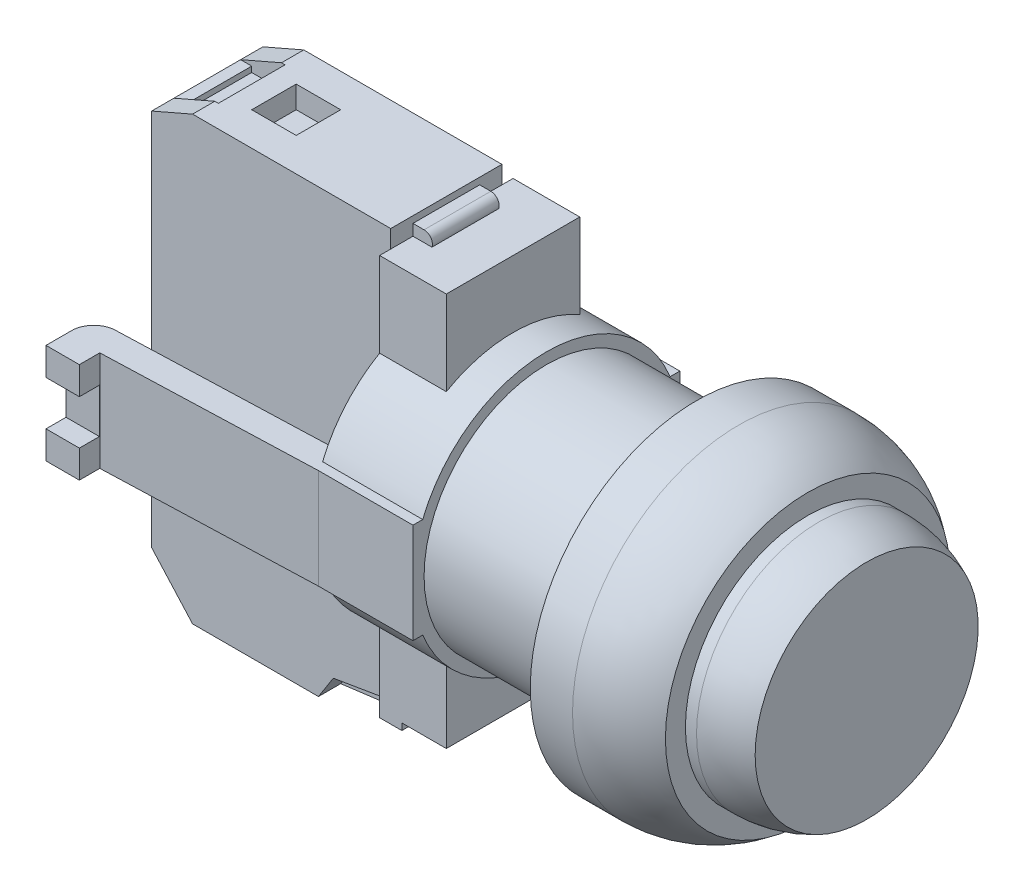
ISO-10303-21;
HEADER;
FILE_DESCRIPTION(('STEP AP214'),'2;1');
FILE_NAME('part.step','',(''),(''),'','','');
FILE_SCHEMA(('AUTOMOTIVE_DESIGN { 1 0 10303 214 1 1 1 1 }'));
ENDSEC;
DATA;
#1=APPLICATION_CONTEXT('core data for automotive mechanical design processes');
#2=APPLICATION_PROTOCOL_DEFINITION('international standard','automotive_design',2000,#1);
#3=PRODUCT_CONTEXT('',#1,'mechanical');
#4=PRODUCT('Part','Part','',(#3));
#5=PRODUCT_RELATED_PRODUCT_CATEGORY('part','',(#4));
#6=PRODUCT_DEFINITION_FORMATION('','',#4);
#7=PRODUCT_DEFINITION_CONTEXT('part definition',#1,'design');
#8=PRODUCT_DEFINITION('design','',#6,#7);
#9=PRODUCT_DEFINITION_SHAPE('','',#8);
#10=(LENGTH_UNIT() NAMED_UNIT(*) SI_UNIT(.MILLI.,.METRE.));
#11=(NAMED_UNIT(*) PLANE_ANGLE_UNIT() SI_UNIT($,.RADIAN.));
#12=(NAMED_UNIT(*) SI_UNIT($,.STERADIAN.) SOLID_ANGLE_UNIT());
#13=UNCERTAINTY_MEASURE_WITH_UNIT(LENGTH_MEASURE(1.E-05),#10,'distance_accuracy_value','');
#14=(GEOMETRIC_REPRESENTATION_CONTEXT(3) GLOBAL_UNCERTAINTY_ASSIGNED_CONTEXT((#13)) GLOBAL_UNIT_ASSIGNED_CONTEXT((#10,
#11,#12)) REPRESENTATION_CONTEXT('',''));
#15=CARTESIAN_POINT('',(0.,0.,0.));
#16=DIRECTION('',(0.,0.,1.));
#17=DIRECTION('',(1.,0.,0.));
#18=AXIS2_PLACEMENT_3D('',#15,#16,#17);
#19=CARTESIAN_POINT('',(0.,0.,0.));
#20=DIRECTION('',(-1.,0.,0.));
#21=DIRECTION('',(0.,0.,1.));
#22=AXIS2_PLACEMENT_3D('',#19,#20,#21);
#23=CYLINDRICAL_SURFACE('',#22,14.95);
#24=CARTESIAN_POINT('',(-11.5,0.,0.));
#25=DIRECTION('',(-1.,0.,0.));
#26=DIRECTION('',(0.,0.,1.));
#27=AXIS2_PLACEMENT_3D('',#24,#25,#26);
#28=CIRCLE('',#27,14.95);
#29=CARTESIAN_POINT('',(-11.5,0.,14.95));
#30=VERTEX_POINT('',#29);
#31=EDGE_CURVE('E1519',#30,#30,#28,.T.);
#32=ORIENTED_EDGE('',*,*,#31,.T.);
#33=EDGE_LOOP('',(#32));
#34=FACE_BOUND('',#33,.T.);
#35=CARTESIAN_POINT('',(-15.3,0.,0.));
#36=DIRECTION('',(-1.,0.,0.));
#37=DIRECTION('',(0.,0.,1.));
#38=AXIS2_PLACEMENT_3D('',#35,#36,#37);
#39=CIRCLE('',#38,14.95);
#40=CARTESIAN_POINT('',(-15.3,0.,14.95));
#41=VERTEX_POINT('',#40);
#42=EDGE_CURVE('E11',#41,#41,#39,.T.);
#43=ORIENTED_EDGE('',*,*,#42,.F.);
#44=EDGE_LOOP('',(#43));
#45=FACE_BOUND('',#44,.T.);
#46=ADVANCED_FACE('F16',(#34,#45),#23,.T.);
#47=CARTESIAN_POINT('',(-15.3,13.5,0.));
#48=DIRECTION('',(-1.,0.,0.));
#49=DIRECTION('',(0.,0.,1.));
#50=AXIS2_PLACEMENT_3D('',#47,#48,#49);
#51=PLANE('',#50);
#52=ORIENTED_EDGE('',*,*,#42,.T.);
#53=EDGE_LOOP('',(#52));
#54=FACE_BOUND('',#53,.T.);
#55=CARTESIAN_POINT('',(-15.3,0.,0.));
#56=DIRECTION('',(-1.,0.,0.));
#57=DIRECTION('',(0.,0.,1.));
#58=AXIS2_PLACEMENT_3D('',#55,#56,#57);
#59=CIRCLE('',#58,13.5);
#60=CARTESIAN_POINT('',(-15.3,0.,13.5));
#61=VERTEX_POINT('',#60);
#62=EDGE_CURVE('E24',#61,#61,#59,.T.);
#63=ORIENTED_EDGE('',*,*,#62,.F.);
#64=EDGE_LOOP('',(#63));
#65=FACE_BOUND('',#64,.T.);
#66=ADVANCED_FACE('F1560',(#54,#65),#51,.T.);
#67=CARTESIAN_POINT('',(0.,0.,0.));
#68=DIRECTION('',(-1.,0.,0.));
#69=DIRECTION('',(0.,0.,1.));
#70=AXIS2_PLACEMENT_3D('',#67,#68,#69);
#71=CYLINDRICAL_SURFACE('',#70,13.5);
#72=ORIENTED_EDGE('',*,*,#62,.T.);
#73=EDGE_LOOP('',(#72));
#74=FACE_BOUND('',#73,.T.);
#75=CARTESIAN_POINT('',(-16.3,0.,0.));
#76=DIRECTION('',(-1.,0.,0.));
#77=DIRECTION('',(0.,0.,1.));
#78=AXIS2_PLACEMENT_3D('',#75,#76,#77);
#79=CIRCLE('',#78,13.5);
#80=CARTESIAN_POINT('',(-16.3,0.,13.5));
#81=VERTEX_POINT('',#80);
#82=EDGE_CURVE('E1547',#81,#81,#79,.T.);
#83=ORIENTED_EDGE('',*,*,#82,.F.);
#84=EDGE_LOOP('',(#83));
#85=FACE_BOUND('',#84,.T.);
#86=ADVANCED_FACE('F1557',(#74,#85),#71,.T.);
#87=CARTESIAN_POINT('',(-16.3,11.,0.));
#88=DIRECTION('',(-1.,0.,0.));
#89=DIRECTION('',(0.,0.,1.));
#90=AXIS2_PLACEMENT_3D('',#87,#88,#89);
#91=PLANE('',#90);
#92=ORIENTED_EDGE('',*,*,#82,.T.);
#93=EDGE_LOOP('',(#92));
#94=FACE_BOUND('',#93,.T.);
#95=CARTESIAN_POINT('',(-16.3,0.,0.));
#96=DIRECTION('',(-1.,0.,0.));
#97=DIRECTION('',(0.,0.,1.));
#98=AXIS2_PLACEMENT_3D('',#95,#96,#97);
#99=CIRCLE('',#98,11.);
#100=CARTESIAN_POINT('',(-16.3,0.,11.));
#101=VERTEX_POINT('',#100);
#102=EDGE_CURVE('E1543',#101,#101,#99,.T.);
#103=ORIENTED_EDGE('',*,*,#102,.F.);
#104=EDGE_LOOP('',(#103));
#105=FACE_BOUND('',#104,.T.);
#106=ADVANCED_FACE('F1568',(#94,#105),#91,.T.);
#107=CARTESIAN_POINT('',(0.,0.,0.));
#108=DIRECTION('',(-1.,0.,0.));
#109=DIRECTION('',(0.,0.,1.));
#110=AXIS2_PLACEMENT_3D('',#107,#108,#109);
#111=CYLINDRICAL_SURFACE('',#110,11.);
#112=ORIENTED_EDGE('',*,*,#102,.T.);
#113=EDGE_LOOP('',(#112));
#114=FACE_BOUND('',#113,.T.);
#115=CARTESIAN_POINT('',(-28.8,0.,0.));
#116=DIRECTION('',(-1.,0.,0.));
#117=DIRECTION('',(0.,0.,1.));
#118=AXIS2_PLACEMENT_3D('',#115,#116,#117);
#119=CIRCLE('',#118,11.);
#120=CARTESIAN_POINT('',(-28.8,0.,11.));
#121=VERTEX_POINT('',#120);
#122=EDGE_CURVE('E1539',#121,#121,#119,.T.);
#123=ORIENTED_EDGE('',*,*,#122,.F.);
#124=EDGE_LOOP('',(#123));
#125=FACE_BOUND('',#124,.T.);
#126=ADVANCED_FACE('F1574',(#114,#125),#111,.T.);
#127=CARTESIAN_POINT('',(0.,0.,0.));
#128=DIRECTION('',(-1.,0.,0.));
#129=DIRECTION('',(0.,0.,1.));
#130=AXIS2_PLACEMENT_3D('',#127,#128,#129);
#131=PLANE('',#130);
#132=CARTESIAN_POINT('',(0.,0.,0.));
#133=DIRECTION('',(-1.,0.,0.));
#134=DIRECTION('',(0.,0.,1.));
#135=AXIS2_PLACEMENT_3D('',#132,#133,#134);
#136=CIRCLE('',#135,10.0282888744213);
#137=CARTESIAN_POINT('',(0.,0.,10.0282888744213));
#138=VERTEX_POINT('',#137);
#139=EDGE_CURVE('E1535',#138,#138,#136,.T.);
#140=ORIENTED_EDGE('',*,*,#139,.F.);
#141=EDGE_LOOP('',(#140));
#142=FACE_BOUND('',#141,.T.);
#143=ADVANCED_FACE('F1578',(#142),#131,.F.);
#144=CARTESIAN_POINT('',(-4.3,0.,0.));
#145=DIRECTION('',(-1.,0.,0.));
#146=DIRECTION('',(0.,0.,1.));
#147=AXIS2_PLACEMENT_3D('',#144,#145,#146);
#148=DEGENERATE_TOROIDAL_SURFACE('',#147,1.,10.,.T.);
#149=CARTESIAN_POINT('',(-4.3,0.,0.));
#150=DIRECTION('',(-1.,0.,0.));
#151=DIRECTION('',(0.,0.,1.));
#152=AXIS2_PLACEMENT_3D('',#149,#150,#151);
#153=CIRCLE('',#152,11.);
#154=CARTESIAN_POINT('',(-4.3,0.,11.));
#155=VERTEX_POINT('',#154);
#156=EDGE_CURVE('E1531',#155,#155,#153,.T.);
#157=ORIENTED_EDGE('',*,*,#156,.F.);
#158=EDGE_LOOP('',(#157));
#159=FACE_BOUND('',#158,.T.);
#160=ORIENTED_EDGE('',*,*,#139,.T.);
#161=EDGE_LOOP('',(#160));
#162=FACE_BOUND('',#161,.T.);
#163=ADVANCED_FACE('F1582',(#159,#162),#148,.T.);
#164=CARTESIAN_POINT('',(0.,0.,0.));
#165=DIRECTION('',(-1.,0.,0.));
#166=DIRECTION('',(0.,0.,1.));
#167=AXIS2_PLACEMENT_3D('',#164,#165,#166);
#168=CYLINDRICAL_SURFACE('',#167,11.);
#169=ORIENTED_EDGE('',*,*,#156,.T.);
#170=EDGE_LOOP('',(#169));
#171=FACE_BOUND('',#170,.T.);
#172=CARTESIAN_POINT('',(-5.3,0.,0.));
#173=DIRECTION('',(-1.,0.,0.));
#174=DIRECTION('',(0.,0.,1.));
#175=AXIS2_PLACEMENT_3D('',#172,#173,#174);
#176=CIRCLE('',#175,11.);
#177=CARTESIAN_POINT('',(-5.3,0.,11.));
#178=VERTEX_POINT('',#177);
#179=EDGE_CURVE('E1527',#178,#178,#176,.T.);
#180=ORIENTED_EDGE('',*,*,#179,.F.);
#181=EDGE_LOOP('',(#180));
#182=FACE_BOUND('',#181,.T.);
#183=ADVANCED_FACE('F1586',(#171,#182),#168,.T.);
#184=CARTESIAN_POINT('',(-5.3,12.7960180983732,0.));
#185=DIRECTION('',(1.,0.,0.));
#186=DIRECTION('',(0.,0.,-1.));
#187=AXIS2_PLACEMENT_3D('',#184,#185,#186);
#188=PLANE('',#187);
#189=ORIENTED_EDGE('',*,*,#179,.T.);
#190=EDGE_LOOP('',(#189));
#191=FACE_BOUND('',#190,.T.);
#192=CARTESIAN_POINT('',(-5.3,0.,0.));
#193=DIRECTION('',(-1.,0.,0.));
#194=DIRECTION('',(0.,0.,1.));
#195=AXIS2_PLACEMENT_3D('',#192,#193,#194);
#196=CIRCLE('',#195,12.7960180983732);
#197=CARTESIAN_POINT('',(-5.3,0.,12.7960180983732));
#198=VERTEX_POINT('',#197);
#199=EDGE_CURVE('E1523',#198,#198,#196,.T.);
#200=ORIENTED_EDGE('',*,*,#199,.F.);
#201=EDGE_LOOP('',(#200));
#202=FACE_BOUND('',#201,.T.);
#203=ADVANCED_FACE('F1590',(#191,#202),#188,.T.);
#204=CARTESIAN_POINT('',(-11.5,0.,0.));
#205=DIRECTION('',(-1.,0.,0.));
#206=DIRECTION('',(0.,0.,1.));
#207=AXIS2_PLACEMENT_3D('',#204,#205,#206);
#208=DEGENERATE_TOROIDAL_SURFACE('',#207,4.95,10.,.T.);
#209=ORIENTED_EDGE('',*,*,#31,.F.);
#210=EDGE_LOOP('',(#209));
#211=FACE_BOUND('',#210,.T.);
#212=ORIENTED_EDGE('',*,*,#199,.T.);
#213=EDGE_LOOP('',(#212));
#214=FACE_BOUND('',#213,.T.);
#215=ADVANCED_FACE('F1594',(#211,#214),#208,.T.);
#216=CARTESIAN_POINT('',(-34.8,-18.,-6.00000000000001));
#217=DIRECTION('',(0.,-1.,0.));
#218=DIRECTION('',(0.,0.,-1.));
#219=AXIS2_PLACEMENT_3D('',#216,#217,#218);
#220=PLANE('',#219);
#221=DIRECTION('',(0.,0.,-1.));
#222=VECTOR('',#221,1.);
#223=CARTESIAN_POINT('',(-35.8,-18.,-6.00000000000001));
#224=LINE('',#223,#222);
#225=CARTESIAN_POINT('',(-35.8,-18.,-3.));
#226=VERTEX_POINT('',#225);
#227=CARTESIAN_POINT('',(-35.8,-18.,-6.00000000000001));
#228=VERTEX_POINT('',#227);
#229=EDGE_CURVE('E1144',#226,#228,#224,.T.);
#230=ORIENTED_EDGE('',*,*,#229,.F.);
#231=DIRECTION('',(-1.,0.,0.));
#232=VECTOR('',#231,1.);
#233=CARTESIAN_POINT('',(-35.8,-18.,-3.));
#234=LINE('',#233,#232);
#235=CARTESIAN_POINT('',(-37.8,-18.,-3.));
#236=VERTEX_POINT('',#235);
#237=EDGE_CURVE('E39',#226,#236,#234,.T.);
#238=ORIENTED_EDGE('',*,*,#237,.T.);
#239=DIRECTION('',(0.,0.,1.));
#240=VECTOR('',#239,1.);
#241=CARTESIAN_POINT('',(-37.8,-18.,-6.00000000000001));
#242=LINE('',#241,#240);
#243=CARTESIAN_POINT('',(-37.8,-18.,-6.00000000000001));
#244=VERTEX_POINT('',#243);
#245=EDGE_CURVE('E1180',#244,#236,#242,.T.);
#246=ORIENTED_EDGE('',*,*,#245,.F.);
#247=DIRECTION('',(1.,0.,0.));
#248=VECTOR('',#247,1.);
#249=CARTESIAN_POINT('',(-34.8,-18.,-6.00000000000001));
#250=LINE('',#249,#248);
#251=EDGE_CURVE('E1152',#244,#228,#250,.T.);
#252=ORIENTED_EDGE('',*,*,#251,.T.);
#253=EDGE_LOOP('',(#230,#238,#246,#252));
#254=FACE_BOUND('',#253,.T.);
#255=ADVANCED_FACE('F1598',(#254),#220,.T.);
#256=CARTESIAN_POINT('',(-57.3,-4.5,12.1996344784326));
#257=DIRECTION('',(0.,-1.,0.));
#258=DIRECTION('',(1.,0.,0.));
#259=AXIS2_PLACEMENT_3D('',#256,#257,#258);
#260=PLANE('',#259);
#261=DIRECTION('',(0.,0.,-1.));
#262=VECTOR('',#261,1.);
#263=CARTESIAN_POINT('',(-37.8,-4.5,12.1996344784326));
#264=LINE('',#263,#262);
#265=CARTESIAN_POINT('',(-37.8,-4.5,11.1242977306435));
#266=VERTEX_POINT('',#265);
#267=CARTESIAN_POINT('',(-37.8,-4.5,9.51746038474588));
#268=VERTEX_POINT('',#267);
#269=EDGE_CURVE('E1238',#266,#268,#264,.T.);
#270=ORIENTED_EDGE('',*,*,#269,.F.);
#271=DIRECTION('',(-1.,0.,0.));
#272=VECTOR('',#271,1.);
#273=CARTESIAN_POINT('',(-28.8,-4.5,11.1242977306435));
#274=LINE('',#273,#272);
#275=CARTESIAN_POINT('',(-28.8,-4.5,11.1242977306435));
#276=VERTEX_POINT('',#275);
#277=EDGE_CURVE('E1226',#276,#266,#274,.T.);
#278=ORIENTED_EDGE('',*,*,#277,.F.);
#279=DIRECTION('',(0.,0.,1.));
#280=VECTOR('',#279,1.);
#281=CARTESIAN_POINT('',(-28.8,-4.5,-12.));
#282=LINE('',#281,#280);
#283=CARTESIAN_POINT('',(-28.8,-4.5,12.));
#284=VERTEX_POINT('',#283);
#285=EDGE_CURVE('E1357',#276,#284,#282,.T.);
#286=ORIENTED_EDGE('',*,*,#285,.T.);
#287=DIRECTION('',(-1.,0.,0.));
#288=VECTOR('',#287,1.);
#289=CARTESIAN_POINT('',(-28.8,-4.5,12.));
#290=LINE('',#289,#288);
#291=CARTESIAN_POINT('',(-37.3,-4.5,12.));
#292=VERTEX_POINT('',#291);
#293=EDGE_CURVE('E1356',#284,#292,#290,.T.);
#294=ORIENTED_EDGE('',*,*,#293,.T.);
#295=DIRECTION('',(-0.999390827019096,0.,0.0348994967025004));
#296=VECTOR('',#295,1.);
#297=CARTESIAN_POINT('',(-37.3,-4.5,12.));
#298=LINE('',#297,#296);
#299=CARTESIAN_POINT('',(-56.3,-4.5,12.6634946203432));
#300=VERTEX_POINT('',#299);
#301=EDGE_CURVE('E1360',#292,#300,#298,.T.);
#302=ORIENTED_EDGE('',*,*,#301,.T.);
#303=DIRECTION('',(0.,0.,1.));
#304=VECTOR('',#303,1.);
#305=CARTESIAN_POINT('',(-56.3,-4.5,12.6634946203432));
#306=LINE('',#305,#304);
#307=CARTESIAN_POINT('',(-56.3,-4.5,14.5));
#308=VERTEX_POINT('',#307);
#309=EDGE_CURVE('E1363',#300,#308,#306,.T.);
#310=ORIENTED_EDGE('',*,*,#309,.T.);
#311=DIRECTION('',(-1.,0.,0.));
#312=VECTOR('',#311,1.);
#313=CARTESIAN_POINT('',(-56.3,-4.5,14.5));
#314=LINE('',#313,#312);
#315=CARTESIAN_POINT('',(-59.3,-4.5,14.5));
#316=VERTEX_POINT('',#315);
#317=EDGE_CURVE('E1366',#308,#316,#314,.T.);
#318=ORIENTED_EDGE('',*,*,#317,.T.);
#319=DIRECTION('',(0.,0.,1.));
#320=VECTOR('',#319,1.);
#321=CARTESIAN_POINT('',(-59.3,-4.5,12.1996344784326));
#322=LINE('',#321,#320);
#323=CARTESIAN_POINT('',(-59.3,-4.5,12.1996344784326));
#324=VERTEX_POINT('',#323);
#325=EDGE_CURVE('E1369',#324,#316,#322,.T.);
#326=ORIENTED_EDGE('',*,*,#325,.F.);
#327=CARTESIAN_POINT('',(-57.3,-4.5,12.1996344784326));
#328=DIRECTION('',(0.,-1.,0.));
#329=DIRECTION('',(1.,0.,0.));
#330=AXIS2_PLACEMENT_3D('',#327,#328,#329);
#331=CIRCLE('',#330,2.);
#332=CARTESIAN_POINT('',(-57.369798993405,-4.5,10.2008528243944));
#333=VERTEX_POINT('',#332);
#334=EDGE_CURVE('E1373',#324,#333,#331,.T.);
#335=ORIENTED_EDGE('',*,*,#334,.T.);
#336=DIRECTION('',(-0.999390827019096,0.,0.0348994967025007));
#337=VECTOR('',#336,1.);
#338=CARTESIAN_POINT('',(-37.3,-4.5,9.50000000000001));
#339=LINE('',#338,#337);
#340=EDGE_CURVE('E1377',#268,#333,#339,.T.);
#341=ORIENTED_EDGE('',*,*,#340,.F.);
#342=EDGE_LOOP('',(#270,#278,#286,#294,#302,#310,#318,#326,#335,#341));
#343=FACE_BOUND('',#342,.T.);
#344=ADVANCED_FACE('F1667',(#343),#260,.T.);
#345=CARTESIAN_POINT('',(-57.3,4.5,12.1996344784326));
#346=DIRECTION('',(0.,-1.,0.));
#347=DIRECTION('',(1.,0.,0.));
#348=AXIS2_PLACEMENT_3D('',#345,#346,#347);
#349=PLANE('',#348);
#350=DIRECTION('',(-1.,0.,0.));
#351=VECTOR('',#350,1.);
#352=CARTESIAN_POINT('',(-28.8,4.5,11.1242977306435));
#353=LINE('',#352,#351);
#354=CARTESIAN_POINT('',(-28.8,4.5,11.1242977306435));
#355=VERTEX_POINT('',#354);
#356=CARTESIAN_POINT('',(-37.8,4.5,11.1242977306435));
#357=VERTEX_POINT('',#356);
#358=EDGE_CURVE('E1485',#355,#357,#353,.T.);
#359=ORIENTED_EDGE('',*,*,#358,.T.);
#360=DIRECTION('',(0.,0.,-1.));
#361=VECTOR('',#360,1.);
#362=CARTESIAN_POINT('',(-37.8,4.5,12.1996344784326));
#363=LINE('',#362,#361);
#364=CARTESIAN_POINT('',(-37.8,4.5,9.51746038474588));
#365=VERTEX_POINT('',#364);
#366=EDGE_CURVE('E1486',#357,#365,#363,.T.);
#367=ORIENTED_EDGE('',*,*,#366,.T.);
#368=DIRECTION('',(-0.999390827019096,0.,0.0348994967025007));
#369=VECTOR('',#368,1.);
#370=CARTESIAN_POINT('',(-37.3,4.5,9.50000000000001));
#371=LINE('',#370,#369);
#372=CARTESIAN_POINT('',(-57.369798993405,4.5,10.2008528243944));
#373=VERTEX_POINT('',#372);
#374=EDGE_CURVE('E1323',#365,#373,#371,.T.);
#375=ORIENTED_EDGE('',*,*,#374,.T.);
#376=CARTESIAN_POINT('',(-57.3,4.5,12.1996344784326));
#377=DIRECTION('',(0.,-1.,0.));
#378=DIRECTION('',(1.,0.,0.));
#379=AXIS2_PLACEMENT_3D('',#376,#377,#378);
#380=CIRCLE('',#379,2.);
#381=CARTESIAN_POINT('',(-59.3,4.5,12.1996344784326));
#382=VERTEX_POINT('',#381);
#383=EDGE_CURVE('E1319',#382,#373,#380,.T.);
#384=ORIENTED_EDGE('',*,*,#383,.F.);
#385=DIRECTION('',(0.,0.,1.));
#386=VECTOR('',#385,1.);
#387=CARTESIAN_POINT('',(-59.3,4.5,12.1996344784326));
#388=LINE('',#387,#386);
#389=CARTESIAN_POINT('',(-59.3,4.5,14.5));
#390=VERTEX_POINT('',#389);
#391=EDGE_CURVE('E1315',#382,#390,#388,.T.);
#392=ORIENTED_EDGE('',*,*,#391,.T.);
#393=DIRECTION('',(-1.,0.,0.));
#394=VECTOR('',#393,1.);
#395=CARTESIAN_POINT('',(-56.3,4.5,14.5));
#396=LINE('',#395,#394);
#397=CARTESIAN_POINT('',(-56.3,4.5,14.5));
#398=VERTEX_POINT('',#397);
#399=EDGE_CURVE('E1311',#398,#390,#396,.T.);
#400=ORIENTED_EDGE('',*,*,#399,.F.);
#401=DIRECTION('',(0.,0.,1.));
#402=VECTOR('',#401,1.);
#403=CARTESIAN_POINT('',(-56.3,4.5,12.6634946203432));
#404=LINE('',#403,#402);
#405=CARTESIAN_POINT('',(-56.3,4.5,12.6634946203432));
#406=VERTEX_POINT('',#405);
#407=EDGE_CURVE('E1307',#406,#398,#404,.T.);
#408=ORIENTED_EDGE('',*,*,#407,.F.);
#409=DIRECTION('',(-0.999390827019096,0.,0.0348994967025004));
#410=VECTOR('',#409,1.);
#411=CARTESIAN_POINT('',(-37.3,4.5,12.));
#412=LINE('',#411,#410);
#413=CARTESIAN_POINT('',(-37.3,4.5,12.));
#414=VERTEX_POINT('',#413);
#415=EDGE_CURVE('E1304',#414,#406,#412,.T.);
#416=ORIENTED_EDGE('',*,*,#415,.F.);
#417=DIRECTION('',(-1.,0.,0.));
#418=VECTOR('',#417,1.);
#419=CARTESIAN_POINT('',(-28.8,4.5,12.));
#420=LINE('',#419,#418);
#421=CARTESIAN_POINT('',(-28.8,4.5,12.));
#422=VERTEX_POINT('',#421);
#423=EDGE_CURVE('E1299',#422,#414,#420,.T.);
#424=ORIENTED_EDGE('',*,*,#423,.F.);
#425=DIRECTION('',(0.,0.,1.));
#426=VECTOR('',#425,1.);
#427=CARTESIAN_POINT('',(-28.8,4.5,-12.));
#428=LINE('',#427,#426);
#429=EDGE_CURVE('E1300',#355,#422,#428,.T.);
#430=ORIENTED_EDGE('',*,*,#429,.F.);
#431=EDGE_LOOP('',(#359,#367,#375,#384,#392,#400,#408,#416,#424,#430));
#432=FACE_BOUND('',#431,.T.);
#433=ADVANCED_FACE('F1672',(#432),#349,.F.);
#434=CARTESIAN_POINT('',(-56.3,-4.5,-14.5));
#435=DIRECTION('',(0.,0.,-1.));
#436=DIRECTION('',(0.,1.,0.));
#437=AXIS2_PLACEMENT_3D('',#434,#435,#436);
#438=PLANE('',#437);
#439=DIRECTION('',(1.,0.,0.));
#440=VECTOR('',#439,1.);
#441=CARTESIAN_POINT('',(-56.3,2.,-14.5));
#442=LINE('',#441,#440);
#443=CARTESIAN_POINT('',(-59.3,2.,-14.5));
#444=VERTEX_POINT('',#443);
#445=CARTESIAN_POINT('',(-56.3,2.,-14.5));
#446=VERTEX_POINT('',#445);
#447=EDGE_CURVE('E1259',#444,#446,#442,.T.);
#448=ORIENTED_EDGE('',*,*,#447,.F.);
#449=DIRECTION('',(0.,1.,0.));
#450=VECTOR('',#449,1.);
#451=CARTESIAN_POINT('',(-59.3,-4.5,-14.5));
#452=LINE('',#451,#450);
#453=CARTESIAN_POINT('',(-59.3,4.5,-14.5));
#454=VERTEX_POINT('',#453);
#455=EDGE_CURVE('E1415',#444,#454,#452,.T.);
#456=ORIENTED_EDGE('',*,*,#455,.T.);
#457=DIRECTION('',(-1.,0.,0.));
#458=VECTOR('',#457,1.);
#459=CARTESIAN_POINT('',(-56.3,4.5,-14.5));
#460=LINE('',#459,#458);
#461=CARTESIAN_POINT('',(-56.3,4.5,-14.5));
#462=VERTEX_POINT('',#461);
#463=EDGE_CURVE('E1336',#462,#454,#460,.T.);
#464=ORIENTED_EDGE('',*,*,#463,.F.);
#465=DIRECTION('',(0.,1.,0.));
#466=VECTOR('',#465,1.);
#467=CARTESIAN_POINT('',(-56.3,-4.5,-14.5));
#468=LINE('',#467,#466);
#469=EDGE_CURVE('E1410',#446,#462,#468,.T.);
#470=ORIENTED_EDGE('',*,*,#469,.F.);
#471=EDGE_LOOP('',(#448,#456,#464,#470));
#472=FACE_BOUND('',#471,.T.);
#473=ADVANCED_FACE('F1654',(#472),#438,.T.);
#474=CARTESIAN_POINT('',(-56.3,-4.5,14.5));
#475=DIRECTION('',(0.,0.,-1.));
#476=DIRECTION('',(0.,1.,0.));
#477=AXIS2_PLACEMENT_3D('',#474,#475,#476);
#478=PLANE('',#477);
#479=DIRECTION('',(0.,1.,0.));
#480=VECTOR('',#479,1.);
#481=CARTESIAN_POINT('',(-56.3,-4.5,14.5));
#482=LINE('',#481,#480);
#483=CARTESIAN_POINT('',(-56.3,-2.,14.5));
#484=VERTEX_POINT('',#483);
#485=EDGE_CURVE('E1441',#308,#484,#482,.T.);
#486=ORIENTED_EDGE('',*,*,#485,.T.);
#487=DIRECTION('',(-1.,0.,0.));
#488=VECTOR('',#487,1.);
#489=CARTESIAN_POINT('',(-56.3,-2.,14.5));
#490=LINE('',#489,#488);
#491=CARTESIAN_POINT('',(-59.3,-2.,14.5));
#492=VERTEX_POINT('',#491);
#493=EDGE_CURVE('E1286',#484,#492,#490,.T.);
#494=ORIENTED_EDGE('',*,*,#493,.T.);
#495=DIRECTION('',(0.,1.,0.));
#496=VECTOR('',#495,1.);
#497=CARTESIAN_POINT('',(-59.3,-4.5,14.5));
#498=LINE('',#497,#496);
#499=EDGE_CURVE('E1436',#316,#492,#498,.T.);
#500=ORIENTED_EDGE('',*,*,#499,.F.);
#501=ORIENTED_EDGE('',*,*,#317,.F.);
#502=EDGE_LOOP('',(#486,#494,#500,#501));
#503=FACE_BOUND('',#502,.T.);
#504=ADVANCED_FACE('F1604',(#503),#478,.F.);
#505=CARTESIAN_POINT('',(-37.3,-4.5,-12.));
#506=DIRECTION('',(0.,0.,1.));
#507=DIRECTION('',(-1.,0.,0.));
#508=AXIS2_PLACEMENT_3D('',#505,#506,#507);
#509=PLANE('',#508);
#510=DIRECTION('',(1.,0.,0.));
#511=VECTOR('',#510,1.);
#512=CARTESIAN_POINT('',(-37.3,4.5,-12.));
#513=LINE('',#512,#511);
#514=CARTESIAN_POINT('',(-37.3,4.5,-12.));
#515=VERTEX_POINT('',#514);
#516=CARTESIAN_POINT('',(-28.8,4.5,-12.));
#517=VERTEX_POINT('',#516);
#518=EDGE_CURVE('E1294',#515,#517,#513,.T.);
#519=ORIENTED_EDGE('',*,*,#518,.T.);
#520=DIRECTION('',(0.,1.,0.));
#521=VECTOR('',#520,1.);
#522=CARTESIAN_POINT('',(-28.8,-4.5,-12.));
#523=LINE('',#522,#521);
#524=CARTESIAN_POINT('',(-28.8,-4.5,-12.));
#525=VERTEX_POINT('',#524);
#526=EDGE_CURVE('E1455',#525,#517,#523,.T.);
#527=ORIENTED_EDGE('',*,*,#526,.F.);
#528=DIRECTION('',(1.,0.,0.));
#529=VECTOR('',#528,1.);
#530=CARTESIAN_POINT('',(-37.3,-4.5,-12.));
#531=LINE('',#530,#529);
#532=CARTESIAN_POINT('',(-37.3,-4.5,-12.));
#533=VERTEX_POINT('',#532);
#534=EDGE_CURVE('E1348',#533,#525,#531,.T.);
#535=ORIENTED_EDGE('',*,*,#534,.F.);
#536=DIRECTION('',(0.,1.,0.));
#537=VECTOR('',#536,1.);
#538=CARTESIAN_POINT('',(-37.3,-4.5,-12.));
#539=LINE('',#538,#537);
#540=EDGE_CURVE('E1401',#533,#515,#539,.T.);
#541=ORIENTED_EDGE('',*,*,#540,.T.);
#542=EDGE_LOOP('',(#519,#527,#535,#541));
#543=FACE_BOUND('',#542,.T.);
#544=ADVANCED_FACE('F1600',(#543),#509,.F.);
#545=CARTESIAN_POINT('',(-28.8,-4.5,-12.));
#546=DIRECTION('',(-1.,0.,0.));
#547=DIRECTION('',(0.,0.,-1.));
#548=AXIS2_PLACEMENT_3D('',#545,#546,#547);
#549=PLANE('',#548);
#550=ORIENTED_EDGE('',*,*,#122,.T.);
#551=EDGE_LOOP('',(#550));
#552=FACE_BOUND('',#551,.T.);
#553=ORIENTED_EDGE('',*,*,#285,.F.);
#554=CARTESIAN_POINT('',(-28.8,0.,0.));
#555=DIRECTION('',(-1.,0.,0.));
#556=DIRECTION('',(0.,1.,0.));
#557=AXIS2_PLACEMENT_3D('',#554,#555,#556);
#558=CIRCLE('',#557,12.);
#559=CARTESIAN_POINT('',(-28.8,-4.5,-11.1242977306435));
#560=VERTEX_POINT('',#559);
#561=EDGE_CURVE('E1216',#560,#276,#558,.T.);
#562=ORIENTED_EDGE('',*,*,#561,.F.);
#563=EDGE_CURVE('E1352',#525,#560,#282,.T.);
#564=ORIENTED_EDGE('',*,*,#563,.F.);
#565=ORIENTED_EDGE('',*,*,#526,.T.);
#566=CARTESIAN_POINT('',(-28.8,4.5,-11.1242977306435));
#567=VERTEX_POINT('',#566);
#568=EDGE_CURVE('E1295',#517,#567,#428,.T.);
#569=ORIENTED_EDGE('',*,*,#568,.T.);
#570=EDGE_CURVE('E1213',#355,#567,#558,.T.);
#571=ORIENTED_EDGE('',*,*,#570,.F.);
#572=ORIENTED_EDGE('',*,*,#429,.T.);
#573=DIRECTION('',(0.,1.,0.));
#574=VECTOR('',#573,1.);
#575=CARTESIAN_POINT('',(-28.8,-4.5,12.));
#576=LINE('',#575,#574);
#577=EDGE_CURVE('E1452',#284,#422,#576,.T.);
#578=ORIENTED_EDGE('',*,*,#577,.F.);
#579=EDGE_LOOP('',(#553,#562,#564,#565,#569,#571,#572,#578));
#580=FACE_BOUND('',#579,.T.);
#581=ADVANCED_FACE('F1603',(#552,#580),#549,.F.);
#582=CARTESIAN_POINT('',(-28.8,-4.5,12.));
#583=DIRECTION('',(0.,0.,-1.));
#584=DIRECTION('',(0.,1.,0.));
#585=AXIS2_PLACEMENT_3D('',#582,#583,#584);
#586=PLANE('',#585);
#587=ORIENTED_EDGE('',*,*,#577,.T.);
#588=ORIENTED_EDGE('',*,*,#423,.T.);
#589=DIRECTION('',(0.,1.,0.));
#590=VECTOR('',#589,1.);
#591=CARTESIAN_POINT('',(-37.3,-4.5,12.));
#592=LINE('',#591,#590);
#593=EDGE_CURVE('E1449',#292,#414,#592,.T.);
#594=ORIENTED_EDGE('',*,*,#593,.F.);
#595=ORIENTED_EDGE('',*,*,#293,.F.);
#596=EDGE_LOOP('',(#587,#588,#594,#595));
#597=FACE_BOUND('',#596,.T.);
#598=ADVANCED_FACE('F1608',(#597),#586,.F.);
#599=CARTESIAN_POINT('',(-37.3,-4.5,12.));
#600=DIRECTION('',(-0.0348994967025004,0.,-0.999390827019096));
#601=DIRECTION('',(0.999390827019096,0.,-0.0348994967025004));
#602=AXIS2_PLACEMENT_3D('',#599,#600,#601);
#603=PLANE('',#602);
#604=ORIENTED_EDGE('',*,*,#415,.T.);
#605=DIRECTION('',(0.,1.,0.));
#606=VECTOR('',#605,1.);
#607=CARTESIAN_POINT('',(-56.3,-4.5,12.6634946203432));
#608=LINE('',#607,#606);
#609=EDGE_CURVE('E1445',#300,#406,#608,.T.);
#610=ORIENTED_EDGE('',*,*,#609,.F.);
#611=ORIENTED_EDGE('',*,*,#301,.F.);
#612=ORIENTED_EDGE('',*,*,#593,.T.);
#613=EDGE_LOOP('',(#604,#610,#611,#612));
#614=FACE_BOUND('',#613,.T.);
#615=ADVANCED_FACE('F1612',(#614),#603,.F.);
#616=CARTESIAN_POINT('',(-56.3,-4.5,12.6634946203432));
#617=DIRECTION('',(-1.,0.,0.));
#618=DIRECTION('',(0.,0.,-1.));
#619=AXIS2_PLACEMENT_3D('',#616,#617,#618);
#620=PLANE('',#619);
#621=DIRECTION('',(0.,-1.,0.));
#622=VECTOR('',#621,1.);
#623=CARTESIAN_POINT('',(-56.3,-4.5,12.7));
#624=LINE('',#623,#622);
#625=CARTESIAN_POINT('',(-56.3,2.,12.7));
#626=VERTEX_POINT('',#625);
#627=CARTESIAN_POINT('',(-56.3,-2.,12.7));
#628=VERTEX_POINT('',#627);
#629=EDGE_CURVE('E1282',#626,#628,#624,.T.);
#630=ORIENTED_EDGE('',*,*,#629,.T.);
#631=DIRECTION('',(0.,0.,1.));
#632=VECTOR('',#631,1.);
#633=CARTESIAN_POINT('',(-56.3,-2.,12.6634946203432));
#634=LINE('',#633,#632);
#635=EDGE_CURVE('E1290',#628,#484,#634,.T.);
#636=ORIENTED_EDGE('',*,*,#635,.T.);
#637=ORIENTED_EDGE('',*,*,#485,.F.);
#638=ORIENTED_EDGE('',*,*,#309,.F.);
#639=ORIENTED_EDGE('',*,*,#609,.T.);
#640=ORIENTED_EDGE('',*,*,#407,.T.);
#641=CARTESIAN_POINT('',(-56.3,2.,14.5));
#642=VERTEX_POINT('',#641);
#643=EDGE_CURVE('E1440',#642,#398,#482,.T.);
#644=ORIENTED_EDGE('',*,*,#643,.F.);
#645=DIRECTION('',(0.,0.,-1.));
#646=VECTOR('',#645,1.);
#647=CARTESIAN_POINT('',(-56.3,2.,12.6634946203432));
#648=LINE('',#647,#646);
#649=EDGE_CURVE('E1278',#642,#626,#648,.T.);
#650=ORIENTED_EDGE('',*,*,#649,.T.);
#651=EDGE_LOOP('',(#630,#636,#637,#638,#639,#640,#644,#650));
#652=FACE_BOUND('',#651,.T.);
#653=ADVANCED_FACE('F1616',(#652),#620,.F.);
#654=CARTESIAN_POINT('',(-59.3,2.,14.5));
#655=VERTEX_POINT('',#654);
#656=EDGE_CURVE('E1435',#655,#390,#498,.T.);
#657=ORIENTED_EDGE('',*,*,#656,.F.);
#658=DIRECTION('',(1.,0.,0.));
#659=VECTOR('',#658,1.);
#660=CARTESIAN_POINT('',(-56.3,2.,14.5));
#661=LINE('',#660,#659);
#662=EDGE_CURVE('E1274',#655,#642,#661,.T.);
#663=ORIENTED_EDGE('',*,*,#662,.T.);
#664=ORIENTED_EDGE('',*,*,#643,.T.);
#665=ORIENTED_EDGE('',*,*,#399,.T.);
#666=EDGE_LOOP('',(#657,#663,#664,#665));
#667=FACE_BOUND('',#666,.T.);
#668=ADVANCED_FACE('F1620',(#667),#478,.F.);
#669=CARTESIAN_POINT('',(-59.3,-4.5,12.1996344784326));
#670=DIRECTION('',(-1.,0.,0.));
#671=DIRECTION('',(0.,-1.,0.));
#672=AXIS2_PLACEMENT_3D('',#669,#670,#671);
#673=PLANE('',#672);
#674=DIRECTION('',(0.,0.,1.));
#675=VECTOR('',#674,1.);
#676=CARTESIAN_POINT('',(-59.3,-2.,12.1996344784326));
#677=LINE('',#676,#675);
#678=CARTESIAN_POINT('',(-59.3,-2.,12.7));
#679=VERTEX_POINT('',#678);
#680=EDGE_CURVE('E1464',#679,#492,#677,.T.);
#681=ORIENTED_EDGE('',*,*,#680,.F.);
#682=DIRECTION('',(0.,-1.,0.));
#683=VECTOR('',#682,1.);
#684=CARTESIAN_POINT('',(-59.3,-4.5,12.7));
#685=LINE('',#684,#683);
#686=CARTESIAN_POINT('',(-59.3,2.,12.7));
#687=VERTEX_POINT('',#686);
#688=EDGE_CURVE('E1461',#687,#679,#685,.T.);
#689=ORIENTED_EDGE('',*,*,#688,.F.);
#690=DIRECTION('',(0.,0.,-1.));
#691=VECTOR('',#690,1.);
#692=CARTESIAN_POINT('',(-59.3,2.,12.1996344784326));
#693=LINE('',#692,#691);
#694=EDGE_CURVE('E1458',#655,#687,#693,.T.);
#695=ORIENTED_EDGE('',*,*,#694,.F.);
#696=ORIENTED_EDGE('',*,*,#656,.T.);
#697=ORIENTED_EDGE('',*,*,#391,.F.);
#698=DIRECTION('',(0.,1.,0.));
#699=VECTOR('',#698,1.);
#700=CARTESIAN_POINT('',(-59.3,-4.5,12.1996344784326));
#701=LINE('',#700,#699);
#702=EDGE_CURVE('E1432',#324,#382,#701,.T.);
#703=ORIENTED_EDGE('',*,*,#702,.F.);
#704=ORIENTED_EDGE('',*,*,#325,.T.);
#705=ORIENTED_EDGE('',*,*,#499,.T.);
#706=EDGE_LOOP('',(#681,#689,#695,#696,#697,#703,#704,#705));
#707=FACE_BOUND('',#706,.T.);
#708=ADVANCED_FACE('F1624',(#707),#673,.T.);
#709=CARTESIAN_POINT('',(-57.3,-4.5,12.1996344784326));
#710=DIRECTION('',(0.,1.,0.));
#711=DIRECTION('',(-1.,0.,0.));
#712=AXIS2_PLACEMENT_3D('',#709,#710,#711);
#713=CYLINDRICAL_SURFACE('',#712,2.);
#714=ORIENTED_EDGE('',*,*,#383,.T.);
#715=DIRECTION('',(0.,1.,0.));
#716=VECTOR('',#715,1.);
#717=CARTESIAN_POINT('',(-57.369798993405,-4.5,10.2008528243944));
#718=LINE('',#717,#716);
#719=EDGE_CURVE('E1428',#333,#373,#718,.T.);
#720=ORIENTED_EDGE('',*,*,#719,.F.);
#721=ORIENTED_EDGE('',*,*,#334,.F.);
#722=ORIENTED_EDGE('',*,*,#702,.T.);
#723=EDGE_LOOP('',(#714,#720,#721,#722));
#724=FACE_BOUND('',#723,.T.);
#725=ADVANCED_FACE('F1628',(#724),#713,.T.);
#726=CARTESIAN_POINT('',(-37.3,-4.5,9.50000000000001));
#727=DIRECTION('',(-0.0348994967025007,0.,-0.999390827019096));
#728=DIRECTION('',(0.999390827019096,0.,-0.0348994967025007));
#729=AXIS2_PLACEMENT_3D('',#726,#727,#728);
#730=PLANE('',#729);
#731=DIRECTION('',(0.,1.,0.));
#732=VECTOR('',#731,1.);
#733=CARTESIAN_POINT('',(-37.8,-4.5,9.51746038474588));
#734=LINE('',#733,#732);
#735=EDGE_CURVE('E1237',#268,#365,#734,.T.);
#736=ORIENTED_EDGE('',*,*,#735,.F.);
#737=ORIENTED_EDGE('',*,*,#340,.T.);
#738=ORIENTED_EDGE('',*,*,#719,.T.);
#739=ORIENTED_EDGE('',*,*,#374,.F.);
#740=EDGE_LOOP('',(#736,#737,#738,#739));
#741=FACE_BOUND('',#740,.T.);
#742=ADVANCED_FACE('F1632',(#741),#730,.T.);
#743=CARTESIAN_POINT('',(-37.3,-4.5,-9.50000000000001));
#744=DIRECTION('',(0.0348994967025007,0.,-0.999390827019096));
#745=DIRECTION('',(0.999390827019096,0.,0.0348994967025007));
#746=AXIS2_PLACEMENT_3D('',#743,#744,#745);
#747=PLANE('',#746);
#748=DIRECTION('',(-0.999390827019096,0.,-0.0348994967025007));
#749=VECTOR('',#748,1.);
#750=CARTESIAN_POINT('',(-37.3,-4.5,-9.50000000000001));
#751=LINE('',#750,#749);
#752=CARTESIAN_POINT('',(-37.8,-4.5,-9.51746038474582));
#753=VERTEX_POINT('',#752);
#754=CARTESIAN_POINT('',(-57.369798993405,-4.5,-10.2008528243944));
#755=VERTEX_POINT('',#754);
#756=EDGE_CURVE('E1380',#753,#755,#751,.T.);
#757=ORIENTED_EDGE('',*,*,#756,.F.);
#758=DIRECTION('',(0.,1.,0.));
#759=VECTOR('',#758,1.);
#760=CARTESIAN_POINT('',(-37.8,-4.5,-9.51746038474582));
#761=LINE('',#760,#759);
#762=CARTESIAN_POINT('',(-37.8,4.5,-9.51746038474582));
#763=VERTEX_POINT('',#762);
#764=EDGE_CURVE('E1229',#753,#763,#761,.T.);
#765=ORIENTED_EDGE('',*,*,#764,.T.);
#766=DIRECTION('',(-0.999390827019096,0.,-0.0348994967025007));
#767=VECTOR('',#766,1.);
#768=CARTESIAN_POINT('',(-37.3,4.5,-9.50000000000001));
#769=LINE('',#768,#767);
#770=CARTESIAN_POINT('',(-57.369798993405,4.5,-10.2008528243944));
#771=VERTEX_POINT('',#770);
#772=EDGE_CURVE('E1326',#763,#771,#769,.T.);
#773=ORIENTED_EDGE('',*,*,#772,.T.);
#774=DIRECTION('',(0.,1.,0.));
#775=VECTOR('',#774,1.);
#776=CARTESIAN_POINT('',(-57.369798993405,-4.5,-10.2008528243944));
#777=LINE('',#776,#775);
#778=EDGE_CURVE('E1424',#755,#771,#777,.T.);
#779=ORIENTED_EDGE('',*,*,#778,.F.);
#780=EDGE_LOOP('',(#757,#765,#773,#779));
#781=FACE_BOUND('',#780,.T.);
#782=ADVANCED_FACE('F1636',(#781),#747,.F.);
#783=CARTESIAN_POINT('',(-57.3,-4.5,-12.1996344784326));
#784=DIRECTION('',(0.,1.,0.));
#785=DIRECTION('',(-1.,0.,0.));
#786=AXIS2_PLACEMENT_3D('',#783,#784,#785);
#787=CYLINDRICAL_SURFACE('',#786,2.);
#788=CARTESIAN_POINT('',(-57.3,4.5,-12.1996344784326));
#789=DIRECTION('',(0.,-1.,0.));
#790=DIRECTION('',(1.,0.,0.));
#791=AXIS2_PLACEMENT_3D('',#788,#789,#790);
#792=CIRCLE('',#791,2.);
#793=CARTESIAN_POINT('',(-59.3,4.5,-12.1996344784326));
#794=VERTEX_POINT('',#793);
#795=EDGE_CURVE('E1329',#771,#794,#792,.T.);
#796=ORIENTED_EDGE('',*,*,#795,.T.);
#797=DIRECTION('',(0.,1.,0.));
#798=VECTOR('',#797,1.);
#799=CARTESIAN_POINT('',(-59.3,-4.5,-12.1996344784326));
#800=LINE('',#799,#798);
#801=CARTESIAN_POINT('',(-59.3,-4.5,-12.1996344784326));
#802=VERTEX_POINT('',#801);
#803=EDGE_CURVE('E1420',#802,#794,#800,.T.);
#804=ORIENTED_EDGE('',*,*,#803,.F.);
#805=CARTESIAN_POINT('',(-57.3,-4.5,-12.1996344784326));
#806=DIRECTION('',(0.,-1.,0.));
#807=DIRECTION('',(1.,0.,0.));
#808=AXIS2_PLACEMENT_3D('',#805,#806,#807);
#809=CIRCLE('',#808,2.);
#810=EDGE_CURVE('E1383',#755,#802,#809,.T.);
#811=ORIENTED_EDGE('',*,*,#810,.F.);
#812=ORIENTED_EDGE('',*,*,#778,.T.);
#813=EDGE_LOOP('',(#796,#804,#811,#812));
#814=FACE_BOUND('',#813,.T.);
#815=ADVANCED_FACE('F1640',(#814),#787,.T.);
#816=CARTESIAN_POINT('',(-59.3,-4.5,-12.1996344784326));
#817=DIRECTION('',(1.,0.,0.));
#818=DIRECTION('',(0.,1.,0.));
#819=AXIS2_PLACEMENT_3D('',#816,#817,#818);
#820=PLANE('',#819);
#821=ORIENTED_EDGE('',*,*,#455,.F.);
#822=DIRECTION('',(0.,0.,1.));
#823=VECTOR('',#822,1.);
#824=CARTESIAN_POINT('',(-59.3,2.,-12.1996344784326));
#825=LINE('',#824,#823);
#826=CARTESIAN_POINT('',(-59.3,2.,-12.7));
#827=VERTEX_POINT('',#826);
#828=EDGE_CURVE('E1262',#444,#827,#825,.T.);
#829=ORIENTED_EDGE('',*,*,#828,.T.);
#830=DIRECTION('',(0.,-1.,0.));
#831=VECTOR('',#830,1.);
#832=CARTESIAN_POINT('',(-59.3,-4.5,-12.7));
#833=LINE('',#832,#831);
#834=CARTESIAN_POINT('',(-59.3,-2.,-12.7));
#835=VERTEX_POINT('',#834);
#836=EDGE_CURVE('E1255',#827,#835,#833,.T.);
#837=ORIENTED_EDGE('',*,*,#836,.T.);
#838=DIRECTION('',(0.,0.,-1.));
#839=VECTOR('',#838,1.);
#840=CARTESIAN_POINT('',(-59.3,-2.,-12.1996344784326));
#841=LINE('',#840,#839);
#842=CARTESIAN_POINT('',(-59.3,-2.,-14.5));
#843=VERTEX_POINT('',#842);
#844=EDGE_CURVE('E1251',#835,#843,#841,.T.);
#845=ORIENTED_EDGE('',*,*,#844,.T.);
#846=CARTESIAN_POINT('',(-59.3,-4.5,-14.5));
#847=VERTEX_POINT('',#846);
#848=EDGE_CURVE('E1416',#847,#843,#452,.T.);
#849=ORIENTED_EDGE('',*,*,#848,.F.);
#850=DIRECTION('',(0.,0.,-1.));
#851=VECTOR('',#850,1.);
#852=CARTESIAN_POINT('',(-59.3,-4.5,-12.1996344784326));
#853=LINE('',#852,#851);
#854=EDGE_CURVE('E1386',#802,#847,#853,.T.);
#855=ORIENTED_EDGE('',*,*,#854,.F.);
#856=ORIENTED_EDGE('',*,*,#803,.T.);
#857=DIRECTION('',(0.,0.,-1.));
#858=VECTOR('',#857,1.);
#859=CARTESIAN_POINT('',(-59.3,4.5,-12.1996344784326));
#860=LINE('',#859,#858);
#861=EDGE_CURVE('E1332',#794,#454,#860,.T.);
#862=ORIENTED_EDGE('',*,*,#861,.T.);
#863=EDGE_LOOP('',(#821,#829,#837,#845,#849,#855,#856,#862));
#864=FACE_BOUND('',#863,.T.);
#865=ADVANCED_FACE('F1644',(#864),#820,.F.);
#866=DIRECTION('',(-1.,0.,0.));
#867=VECTOR('',#866,1.);
#868=CARTESIAN_POINT('',(-56.3,-2.,-14.5));
#869=LINE('',#868,#867);
#870=CARTESIAN_POINT('',(-56.3,-2.,-14.5));
#871=VERTEX_POINT('',#870);
#872=EDGE_CURVE('E1248',#871,#843,#869,.T.);
#873=ORIENTED_EDGE('',*,*,#872,.F.);
#874=CARTESIAN_POINT('',(-56.3,-4.5,-14.5));
#875=VERTEX_POINT('',#874);
#876=EDGE_CURVE('E1411',#875,#871,#468,.T.);
#877=ORIENTED_EDGE('',*,*,#876,.F.);
#878=DIRECTION('',(-1.,0.,0.));
#879=VECTOR('',#878,1.);
#880=CARTESIAN_POINT('',(-56.3,-4.5,-14.5));
#881=LINE('',#880,#879);
#882=EDGE_CURVE('E1389',#875,#847,#881,.T.);
#883=ORIENTED_EDGE('',*,*,#882,.T.);
#884=ORIENTED_EDGE('',*,*,#848,.T.);
#885=EDGE_LOOP('',(#873,#877,#883,#884));
#886=FACE_BOUND('',#885,.T.);
#887=ADVANCED_FACE('F1648',(#886),#438,.T.);
#888=CARTESIAN_POINT('',(-56.3,-4.5,-12.6634946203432));
#889=DIRECTION('',(1.,0.,0.));
#890=DIRECTION('',(0.,0.,1.));
#891=AXIS2_PLACEMENT_3D('',#888,#889,#890);
#892=PLANE('',#891);
#893=DIRECTION('',(0.,0.,1.));
#894=VECTOR('',#893,1.);
#895=CARTESIAN_POINT('',(-56.3,2.,-12.6634946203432));
#896=LINE('',#895,#894);
#897=CARTESIAN_POINT('',(-56.3,2.,-12.7));
#898=VERTEX_POINT('',#897);
#899=EDGE_CURVE('E1474',#446,#898,#896,.T.);
#900=ORIENTED_EDGE('',*,*,#899,.F.);
#901=ORIENTED_EDGE('',*,*,#469,.T.);
#902=DIRECTION('',(0.,0.,-1.));
#903=VECTOR('',#902,1.);
#904=CARTESIAN_POINT('',(-56.3,4.5,-12.6634946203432));
#905=LINE('',#904,#903);
#906=CARTESIAN_POINT('',(-56.3,4.5,-12.6634946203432));
#907=VERTEX_POINT('',#906);
#908=EDGE_CURVE('E1340',#907,#462,#905,.T.);
#909=ORIENTED_EDGE('',*,*,#908,.F.);
#910=DIRECTION('',(0.,1.,0.));
#911=VECTOR('',#910,1.);
#912=CARTESIAN_POINT('',(-56.3,-4.5,-12.6634946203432));
#913=LINE('',#912,#911);
#914=CARTESIAN_POINT('',(-56.3,-4.5,-12.6634946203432));
#915=VERTEX_POINT('',#914);
#916=EDGE_CURVE('E1407',#915,#907,#913,.T.);
#917=ORIENTED_EDGE('',*,*,#916,.F.);
#918=DIRECTION('',(0.,0.,-1.));
#919=VECTOR('',#918,1.);
#920=CARTESIAN_POINT('',(-56.3,-4.5,-12.6634946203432));
#921=LINE('',#920,#919);
#922=EDGE_CURVE('E1393',#915,#875,#921,.T.);
#923=ORIENTED_EDGE('',*,*,#922,.T.);
#924=ORIENTED_EDGE('',*,*,#876,.T.);
#925=DIRECTION('',(0.,0.,-1.));
#926=VECTOR('',#925,1.);
#927=CARTESIAN_POINT('',(-56.3,-2.,-12.6634946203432));
#928=LINE('',#927,#926);
#929=CARTESIAN_POINT('',(-56.3,-2.,-12.7));
#930=VERTEX_POINT('',#929);
#931=EDGE_CURVE('E1467',#930,#871,#928,.T.);
#932=ORIENTED_EDGE('',*,*,#931,.F.);
#933=DIRECTION('',(0.,-1.,0.));
#934=VECTOR('',#933,1.);
#935=CARTESIAN_POINT('',(-56.3,-4.5,-12.7));
#936=LINE('',#935,#934);
#937=EDGE_CURVE('E1470',#898,#930,#936,.T.);
#938=ORIENTED_EDGE('',*,*,#937,.F.);
#939=EDGE_LOOP('',(#900,#901,#909,#917,#923,#924,#932,#938));
#940=FACE_BOUND('',#939,.T.);
#941=ADVANCED_FACE('F1652',(#940),#892,.T.);
#942=CARTESIAN_POINT('',(-37.3,-4.5,-12.));
#943=DIRECTION('',(0.0348994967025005,0.,-0.999390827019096));
#944=DIRECTION('',(0.999390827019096,0.,0.0348994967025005));
#945=AXIS2_PLACEMENT_3D('',#942,#943,#944);
#946=PLANE('',#945);
#947=DIRECTION('',(-0.999390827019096,0.,-0.0348994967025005));
#948=VECTOR('',#947,1.);
#949=CARTESIAN_POINT('',(-37.3,4.5,-12.));
#950=LINE('',#949,#948);
#951=EDGE_CURVE('E1344',#515,#907,#950,.T.);
#952=ORIENTED_EDGE('',*,*,#951,.F.);
#953=ORIENTED_EDGE('',*,*,#540,.F.);
#954=DIRECTION('',(-0.999390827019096,0.,-0.0348994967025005));
#955=VECTOR('',#954,1.);
#956=CARTESIAN_POINT('',(-37.3,-4.5,-12.));
#957=LINE('',#956,#955);
#958=EDGE_CURVE('E1397',#533,#915,#957,.T.);
#959=ORIENTED_EDGE('',*,*,#958,.T.);
#960=ORIENTED_EDGE('',*,*,#916,.T.);
#961=EDGE_LOOP('',(#952,#953,#959,#960));
#962=FACE_BOUND('',#961,.T.);
#963=ADVANCED_FACE('F1657',(#962),#946,.T.);
#964=CARTESIAN_POINT('',(-37.8,-4.5,-11.1242977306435));
#965=VERTEX_POINT('',#964);
#966=EDGE_CURVE('E1233',#753,#965,#264,.T.);
#967=ORIENTED_EDGE('',*,*,#966,.F.);
#968=ORIENTED_EDGE('',*,*,#756,.T.);
#969=ORIENTED_EDGE('',*,*,#810,.T.);
#970=ORIENTED_EDGE('',*,*,#854,.T.);
#971=ORIENTED_EDGE('',*,*,#882,.F.);
#972=ORIENTED_EDGE('',*,*,#922,.F.);
#973=ORIENTED_EDGE('',*,*,#958,.F.);
#974=ORIENTED_EDGE('',*,*,#534,.T.);
#975=ORIENTED_EDGE('',*,*,#563,.T.);
#976=DIRECTION('',(-1.,0.,0.));
#977=VECTOR('',#976,1.);
#978=CARTESIAN_POINT('',(-28.8,-4.5,-11.1242977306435));
#979=LINE('',#978,#977);
#980=EDGE_CURVE('E1223',#965,#560,#979,.F.);
#981=ORIENTED_EDGE('',*,*,#980,.F.);
#982=EDGE_LOOP('',(#967,#968,#969,#970,#971,#972,#973,#974,#975,#981));
#983=FACE_BOUND('',#982,.T.);
#984=ADVANCED_FACE('F1661',(#983),#260,.T.);
#985=ORIENTED_EDGE('',*,*,#772,.F.);
#986=CARTESIAN_POINT('',(-37.8,4.5,-11.1242977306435));
#987=VERTEX_POINT('',#986);
#988=EDGE_CURVE('E1481',#763,#987,#363,.T.);
#989=ORIENTED_EDGE('',*,*,#988,.T.);
#990=DIRECTION('',(-1.,0.,0.));
#991=VECTOR('',#990,1.);
#992=CARTESIAN_POINT('',(-28.8,4.5,-11.1242977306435));
#993=LINE('',#992,#991);
#994=EDGE_CURVE('E1477',#987,#567,#993,.F.);
#995=ORIENTED_EDGE('',*,*,#994,.T.);
#996=ORIENTED_EDGE('',*,*,#568,.F.);
#997=ORIENTED_EDGE('',*,*,#518,.F.);
#998=ORIENTED_EDGE('',*,*,#951,.T.);
#999=ORIENTED_EDGE('',*,*,#908,.T.);
#1000=ORIENTED_EDGE('',*,*,#463,.T.);
#1001=ORIENTED_EDGE('',*,*,#861,.F.);
#1002=ORIENTED_EDGE('',*,*,#795,.F.);
#1003=EDGE_LOOP('',(#985,#989,#995,#996,#997,#998,#999,#1000,#1001,#1002));
#1004=FACE_BOUND('',#1003,.T.);
#1005=ADVANCED_FACE('F1665',(#1004),#349,.F.);
#1006=CARTESIAN_POINT('',(-57.8,-2.,13.7));
#1007=DIRECTION('',(0.,-1.,0.));
#1008=DIRECTION('',(1.,0.,0.));
#1009=AXIS2_PLACEMENT_3D('',#1006,#1007,#1008);
#1010=PLANE('',#1009);
#1011=DIRECTION('',(-1.,0.,0.));
#1012=VECTOR('',#1011,1.);
#1013=CARTESIAN_POINT('',(-57.8,-2.,12.7));
#1014=LINE('',#1013,#1012);
#1015=EDGE_CURVE('E1270',#628,#679,#1014,.T.);
#1016=ORIENTED_EDGE('',*,*,#1015,.T.);
#1017=ORIENTED_EDGE('',*,*,#680,.T.);
#1018=ORIENTED_EDGE('',*,*,#493,.F.);
#1019=ORIENTED_EDGE('',*,*,#635,.F.);
#1020=EDGE_LOOP('',(#1016,#1017,#1018,#1019));
#1021=FACE_BOUND('',#1020,.T.);
#1022=ADVANCED_FACE('F1670',(#1021),#1010,.F.);
#1023=CARTESIAN_POINT('',(-57.8,2.,12.7));
#1024=DIRECTION('',(0.,0.,-1.));
#1025=DIRECTION('',(0.,1.,0.));
#1026=AXIS2_PLACEMENT_3D('',#1023,#1024,#1025);
#1027=PLANE('',#1026);
#1028=DIRECTION('',(1.,0.,0.));
#1029=VECTOR('',#1028,1.);
#1030=CARTESIAN_POINT('',(-57.8,2.,12.7));
#1031=LINE('',#1030,#1029);
#1032=EDGE_CURVE('E1266',#687,#626,#1031,.T.);
#1033=ORIENTED_EDGE('',*,*,#1032,.F.);
#1034=ORIENTED_EDGE('',*,*,#688,.T.);
#1035=ORIENTED_EDGE('',*,*,#1015,.F.);
#1036=ORIENTED_EDGE('',*,*,#629,.F.);
#1037=EDGE_LOOP('',(#1033,#1034,#1035,#1036));
#1038=FACE_BOUND('',#1037,.T.);
#1039=ADVANCED_FACE('F1675',(#1038),#1027,.F.);
#1040=CARTESIAN_POINT('',(-57.8,2.,13.7));
#1041=DIRECTION('',(0.,1.,0.));
#1042=DIRECTION('',(-1.,0.,0.));
#1043=AXIS2_PLACEMENT_3D('',#1040,#1041,#1042);
#1044=PLANE('',#1043);
#1045=ORIENTED_EDGE('',*,*,#662,.F.);
#1046=ORIENTED_EDGE('',*,*,#694,.T.);
#1047=ORIENTED_EDGE('',*,*,#1032,.T.);
#1048=ORIENTED_EDGE('',*,*,#649,.F.);
#1049=EDGE_LOOP('',(#1045,#1046,#1047,#1048));
#1050=FACE_BOUND('',#1049,.T.);
#1051=ADVANCED_FACE('F1679',(#1050),#1044,.F.);
#1052=CARTESIAN_POINT('',(-57.8,2.,-13.7));
#1053=DIRECTION('',(0.,1.,0.));
#1054=DIRECTION('',(1.,0.,0.));
#1055=AXIS2_PLACEMENT_3D('',#1052,#1053,#1054);
#1056=PLANE('',#1055);
#1057=ORIENTED_EDGE('',*,*,#447,.T.);
#1058=ORIENTED_EDGE('',*,*,#899,.T.);
#1059=DIRECTION('',(-1.,0.,0.));
#1060=VECTOR('',#1059,1.);
#1061=CARTESIAN_POINT('',(-57.8,2.,-12.7));
#1062=LINE('',#1061,#1060);
#1063=EDGE_CURVE('E1244',#898,#827,#1062,.T.);
#1064=ORIENTED_EDGE('',*,*,#1063,.T.);
#1065=ORIENTED_EDGE('',*,*,#828,.F.);
#1066=EDGE_LOOP('',(#1057,#1058,#1064,#1065));
#1067=FACE_BOUND('',#1066,.T.);
#1068=ADVANCED_FACE('F1683',(#1067),#1056,.F.);
#1069=CARTESIAN_POINT('',(-57.8,-2.,-12.7));
#1070=DIRECTION('',(0.,0.,1.));
#1071=DIRECTION('',(0.,-1.,0.));
#1072=AXIS2_PLACEMENT_3D('',#1069,#1070,#1071);
#1073=PLANE('',#1072);
#1074=ORIENTED_EDGE('',*,*,#1063,.F.);
#1075=ORIENTED_EDGE('',*,*,#937,.T.);
#1076=DIRECTION('',(1.,0.,0.));
#1077=VECTOR('',#1076,1.);
#1078=CARTESIAN_POINT('',(-57.8,-2.,-12.7));
#1079=LINE('',#1078,#1077);
#1080=EDGE_CURVE('E1241',#835,#930,#1079,.T.);
#1081=ORIENTED_EDGE('',*,*,#1080,.F.);
#1082=ORIENTED_EDGE('',*,*,#836,.F.);
#1083=EDGE_LOOP('',(#1074,#1075,#1081,#1082));
#1084=FACE_BOUND('',#1083,.T.);
#1085=ADVANCED_FACE('F1687',(#1084),#1073,.F.);
#1086=CARTESIAN_POINT('',(-57.8,-2.,-13.7));
#1087=DIRECTION('',(0.,-1.,0.));
#1088=DIRECTION('',(-1.,0.,0.));
#1089=AXIS2_PLACEMENT_3D('',#1086,#1087,#1088);
#1090=PLANE('',#1089);
#1091=ORIENTED_EDGE('',*,*,#1080,.T.);
#1092=ORIENTED_EDGE('',*,*,#931,.T.);
#1093=ORIENTED_EDGE('',*,*,#872,.T.);
#1094=ORIENTED_EDGE('',*,*,#844,.F.);
#1095=EDGE_LOOP('',(#1091,#1092,#1093,#1094));
#1096=FACE_BOUND('',#1095,.T.);
#1097=ADVANCED_FACE('F1691',(#1096),#1090,.F.);
#1098=CARTESIAN_POINT('',(-28.8,0.,0.));
#1099=DIRECTION('',(-1.,0.,0.));
#1100=DIRECTION('',(0.,1.,0.));
#1101=AXIS2_PLACEMENT_3D('',#1098,#1099,#1100);
#1102=CYLINDRICAL_SURFACE('',#1101,12.);
#1103=DIRECTION('',(-1.,0.,0.));
#1104=VECTOR('',#1103,1.);
#1105=CARTESIAN_POINT('',(-28.8,10.3923048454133,6.00000000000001));
#1106=LINE('',#1105,#1104);
#1107=CARTESIAN_POINT('',(-37.8,10.3923048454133,6.00000000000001));
#1108=VERTEX_POINT('',#1107);
#1109=CARTESIAN_POINT('',(-31.8,10.3923048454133,6.00000000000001));
#1110=VERTEX_POINT('',#1109);
#1111=EDGE_CURVE('E1209',#1108,#1110,#1106,.F.);
#1112=ORIENTED_EDGE('',*,*,#1111,.F.);
#1113=CARTESIAN_POINT('',(-37.8,0.,0.));
#1114=DIRECTION('',(1.,0.,0.));
#1115=DIRECTION('',(0.,1.,0.));
#1116=AXIS2_PLACEMENT_3D('',#1113,#1114,#1115);
#1117=CIRCLE('',#1116,12.);
#1118=EDGE_CURVE('E1221',#1108,#357,#1117,.T.);
#1119=ORIENTED_EDGE('',*,*,#1118,.T.);
#1120=ORIENTED_EDGE('',*,*,#358,.F.);
#1121=ORIENTED_EDGE('',*,*,#570,.T.);
#1122=ORIENTED_EDGE('',*,*,#994,.F.);
#1123=CARTESIAN_POINT('',(-37.8,10.3923048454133,-6.00000000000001));
#1124=VERTEX_POINT('',#1123);
#1125=EDGE_CURVE('E1217',#987,#1124,#1117,.T.);
#1126=ORIENTED_EDGE('',*,*,#1125,.T.);
#1127=DIRECTION('',(-1.,0.,0.));
#1128=VECTOR('',#1127,1.);
#1129=CARTESIAN_POINT('',(-28.8,10.3923048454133,-6.00000000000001));
#1130=LINE('',#1129,#1128);
#1131=CARTESIAN_POINT('',(-31.8,10.3923048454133,-6.00000000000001));
#1132=VERTEX_POINT('',#1131);
#1133=EDGE_CURVE('E1205',#1132,#1124,#1130,.T.);
#1134=ORIENTED_EDGE('',*,*,#1133,.F.);
#1135=CARTESIAN_POINT('',(-31.8,0.,0.));
#1136=DIRECTION('',(1.,0.,0.));
#1137=DIRECTION('',(0.,0.,-1.));
#1138=AXIS2_PLACEMENT_3D('',#1135,#1136,#1137);
#1139=CIRCLE('',#1138,12.);
#1140=EDGE_CURVE('E1201',#1110,#1132,#1139,.F.);
#1141=ORIENTED_EDGE('',*,*,#1140,.F.);
#1142=EDGE_LOOP('',(#1112,#1119,#1120,#1121,#1122,#1126,#1134,#1141));
#1143=FACE_BOUND('',#1142,.T.);
#1144=ADVANCED_FACE('F1695',(#1143),#1102,.T.);
#1145=CARTESIAN_POINT('',(-37.8,0.,0.));
#1146=DIRECTION('',(-1.,0.,0.));
#1147=DIRECTION('',(0.,0.,1.));
#1148=AXIS2_PLACEMENT_3D('',#1145,#1146,#1147);
#1149=PLANE('',#1148);
#1150=DIRECTION('',(0.,1.,0.));
#1151=VECTOR('',#1150,1.);
#1152=CARTESIAN_POINT('',(-37.8,-17.1361519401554,5.));
#1153=LINE('',#1152,#1151);
#1154=CARTESIAN_POINT('',(-37.8,-17.1361519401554,5.));
#1155=VERTEX_POINT('',#1154);
#1156=CARTESIAN_POINT('',(-37.8,18.,5.));
#1157=VERTEX_POINT('',#1156);
#1158=EDGE_CURVE('E992',#1155,#1157,#1153,.T.);
#1159=ORIENTED_EDGE('',*,*,#1158,.F.);
#1160=DIRECTION('',(0.,0.,-1.));
#1161=VECTOR('',#1160,1.);
#1162=CARTESIAN_POINT('',(-37.8,-17.1361519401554,5.));
#1163=LINE('',#1162,#1161);
#1164=CARTESIAN_POINT('',(-37.8,-17.1361519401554,-5.));
#1165=VERTEX_POINT('',#1164);
#1166=EDGE_CURVE('E1043',#1155,#1165,#1163,.T.);
#1167=ORIENTED_EDGE('',*,*,#1166,.T.);
#1168=DIRECTION('',(0.,1.,0.));
#1169=VECTOR('',#1168,1.);
#1170=CARTESIAN_POINT('',(-37.8,-17.1361519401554,-5.));
#1171=LINE('',#1170,#1169);
#1172=CARTESIAN_POINT('',(-37.8,18.,-5.));
#1173=VERTEX_POINT('',#1172);
#1174=EDGE_CURVE('E961',#1165,#1173,#1171,.T.);
#1175=ORIENTED_EDGE('',*,*,#1174,.T.);
#1176=DIRECTION('',(0.,0.,1.));
#1177=VECTOR('',#1176,1.);
#1178=CARTESIAN_POINT('',(-37.8,18.,-6.00000000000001));
#1179=LINE('',#1178,#1177);
#1180=CARTESIAN_POINT('',(-37.8,18.,-6.00000000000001));
#1181=VERTEX_POINT('',#1180);
#1182=EDGE_CURVE('E1174',#1181,#1173,#1179,.T.);
#1183=ORIENTED_EDGE('',*,*,#1182,.F.);
#1184=DIRECTION('',(0.,-1.,0.));
#1185=VECTOR('',#1184,1.);
#1186=CARTESIAN_POINT('',(-37.8,0.,-6.00000000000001));
#1187=LINE('',#1186,#1185);
#1188=EDGE_CURVE('E1166',#1181,#1124,#1187,.T.);
#1189=ORIENTED_EDGE('',*,*,#1188,.T.);
#1190=ORIENTED_EDGE('',*,*,#1125,.F.);
#1191=ORIENTED_EDGE('',*,*,#988,.F.);
#1192=ORIENTED_EDGE('',*,*,#764,.F.);
#1193=ORIENTED_EDGE('',*,*,#966,.T.);
#1194=CARTESIAN_POINT('',(-37.8,-10.3923048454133,-6.00000000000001));
#1195=VERTEX_POINT('',#1194);
#1196=EDGE_CURVE('E1220',#1195,#965,#1117,.T.);
#1197=ORIENTED_EDGE('',*,*,#1196,.F.);
#1198=EDGE_CURVE('E1156',#1195,#244,#1187,.T.);
#1199=ORIENTED_EDGE('',*,*,#1198,.T.);
#1200=ORIENTED_EDGE('',*,*,#245,.T.);
#1201=DIRECTION('',(0.,0.,1.));
#1202=VECTOR('',#1201,1.);
#1203=CARTESIAN_POINT('',(-37.8,-18.,0.));
#1204=LINE('',#1203,#1202);
#1205=CARTESIAN_POINT('',(-37.8,-18.,3.));
#1206=VERTEX_POINT('',#1205);
#1207=EDGE_CURVE('E1130',#236,#1206,#1204,.T.);
#1208=ORIENTED_EDGE('',*,*,#1207,.T.);
#1209=CARTESIAN_POINT('',(-37.8,-18.,6.00000000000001));
#1210=VERTEX_POINT('',#1209);
#1211=EDGE_CURVE('E1178',#1206,#1210,#242,.T.);
#1212=ORIENTED_EDGE('',*,*,#1211,.T.);
#1213=DIRECTION('',(0.,1.,0.));
#1214=VECTOR('',#1213,1.);
#1215=CARTESIAN_POINT('',(-37.8,0.,6.00000000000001));
#1216=LINE('',#1215,#1214);
#1217=CARTESIAN_POINT('',(-37.8,-10.3923048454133,6.00000000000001));
#1218=VERTEX_POINT('',#1217);
#1219=EDGE_CURVE('E1193',#1210,#1218,#1216,.T.);
#1220=ORIENTED_EDGE('',*,*,#1219,.T.);
#1221=EDGE_CURVE('E1222',#266,#1218,#1117,.T.);
#1222=ORIENTED_EDGE('',*,*,#1221,.F.);
#1223=ORIENTED_EDGE('',*,*,#269,.T.);
#1224=ORIENTED_EDGE('',*,*,#735,.T.);
#1225=ORIENTED_EDGE('',*,*,#366,.F.);
#1226=ORIENTED_EDGE('',*,*,#1118,.F.);
#1227=CARTESIAN_POINT('',(-37.8,18.,6.00000000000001));
#1228=VERTEX_POINT('',#1227);
#1229=EDGE_CURVE('E1192',#1108,#1228,#1216,.T.);
#1230=ORIENTED_EDGE('',*,*,#1229,.T.);
#1231=EDGE_CURVE('E1173',#1157,#1228,#1179,.T.);
#1232=ORIENTED_EDGE('',*,*,#1231,.F.);
#1233=EDGE_LOOP('',(#1159,#1167,#1175,#1183,#1189,#1190,#1191,#1192,#1193,#1197,#1199,#1200,
#1208,#1212,#1220,#1222,#1223,#1224,#1225,#1226,#1230,#1232));
#1234=FACE_BOUND('',#1233,.T.);
#1235=ADVANCED_FACE('F1701',(#1234),#1149,.T.);
#1236=DIRECTION('',(-1.,0.,0.));
#1237=VECTOR('',#1236,1.);
#1238=CARTESIAN_POINT('',(-28.8,-10.3923048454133,6.00000000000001));
#1239=LINE('',#1238,#1237);
#1240=CARTESIAN_POINT('',(-31.8,-10.3923048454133,6.00000000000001));
#1241=VERTEX_POINT('',#1240);
#1242=EDGE_CURVE('E1498',#1241,#1218,#1239,.T.);
#1243=ORIENTED_EDGE('',*,*,#1242,.F.);
#1244=CARTESIAN_POINT('',(-31.8,0.,0.));
#1245=DIRECTION('',(1.,0.,0.));
#1246=DIRECTION('',(0.,0.,-1.));
#1247=AXIS2_PLACEMENT_3D('',#1244,#1245,#1246);
#1248=CIRCLE('',#1247,12.);
#1249=CARTESIAN_POINT('',(-31.8,-10.3923048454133,-6.00000000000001));
#1250=VERTEX_POINT('',#1249);
#1251=EDGE_CURVE('E1490',#1250,#1241,#1248,.F.);
#1252=ORIENTED_EDGE('',*,*,#1251,.F.);
#1253=DIRECTION('',(-1.,0.,0.));
#1254=VECTOR('',#1253,1.);
#1255=CARTESIAN_POINT('',(-28.8,-10.3923048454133,-6.00000000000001));
#1256=LINE('',#1255,#1254);
#1257=EDGE_CURVE('E1494',#1195,#1250,#1256,.F.);
#1258=ORIENTED_EDGE('',*,*,#1257,.F.);
#1259=ORIENTED_EDGE('',*,*,#1196,.T.);
#1260=ORIENTED_EDGE('',*,*,#980,.T.);
#1261=ORIENTED_EDGE('',*,*,#561,.T.);
#1262=ORIENTED_EDGE('',*,*,#277,.T.);
#1263=ORIENTED_EDGE('',*,*,#1221,.T.);
#1264=EDGE_LOOP('',(#1243,#1252,#1258,#1259,#1260,#1261,#1262,#1263));
#1265=FACE_BOUND('',#1264,.T.);
#1266=ADVANCED_FACE('F1697',(#1265),#1102,.T.);
#1267=DIRECTION('',(-1.,0.,0.));
#1268=VECTOR('',#1267,1.);
#1269=CARTESIAN_POINT('',(-35.8,-18.,3.));
#1270=LINE('',#1269,#1268);
#1271=CARTESIAN_POINT('',(-35.8,-18.,3.));
#1272=VERTEX_POINT('',#1271);
#1273=EDGE_CURVE('E852',#1272,#1206,#1270,.T.);
#1274=ORIENTED_EDGE('',*,*,#1273,.F.);
#1275=CARTESIAN_POINT('',(-35.8,-18.,6.00000000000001));
#1276=VERTEX_POINT('',#1275);
#1277=EDGE_CURVE('E1145',#1276,#1272,#224,.T.);
#1278=ORIENTED_EDGE('',*,*,#1277,.F.);
#1279=DIRECTION('',(-1.,0.,0.));
#1280=VECTOR('',#1279,1.);
#1281=CARTESIAN_POINT('',(-34.8,-18.,6.00000000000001));
#1282=LINE('',#1281,#1280);
#1283=EDGE_CURVE('E1197',#1276,#1210,#1282,.T.);
#1284=ORIENTED_EDGE('',*,*,#1283,.T.);
#1285=ORIENTED_EDGE('',*,*,#1211,.F.);
#1286=EDGE_LOOP('',(#1274,#1278,#1284,#1285));
#1287=FACE_BOUND('',#1286,.T.);
#1288=ADVANCED_FACE('F1700',(#1287),#220,.T.);
#1289=CARTESIAN_POINT('',(-31.8,0.,-6.00000000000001));
#1290=DIRECTION('',(1.,0.,0.));
#1291=DIRECTION('',(0.,0.,-1.));
#1292=AXIS2_PLACEMENT_3D('',#1289,#1290,#1291);
#1293=PLANE('',#1292);
#1294=DIRECTION('',(0.,0.,1.));
#1295=VECTOR('',#1294,1.);
#1296=CARTESIAN_POINT('',(-31.8,-17.4,-6.00000000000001));
#1297=LINE('',#1296,#1295);
#1298=CARTESIAN_POINT('',(-31.8,-17.4,-6.00000000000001));
#1299=VERTEX_POINT('',#1298);
#1300=CARTESIAN_POINT('',(-31.8,-17.4,6.00000000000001));
#1301=VERTEX_POINT('',#1300);
#1302=EDGE_CURVE('E1138',#1299,#1301,#1297,.T.);
#1303=ORIENTED_EDGE('',*,*,#1302,.F.);
#1304=DIRECTION('',(0.,1.,0.));
#1305=VECTOR('',#1304,1.);
#1306=CARTESIAN_POINT('',(-31.8,0.,-6.00000000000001));
#1307=LINE('',#1306,#1305);
#1308=EDGE_CURVE('E1157',#1299,#1250,#1307,.T.);
#1309=ORIENTED_EDGE('',*,*,#1308,.T.);
#1310=ORIENTED_EDGE('',*,*,#1251,.T.);
#1311=DIRECTION('',(0.,-1.,0.));
#1312=VECTOR('',#1311,1.);
#1313=CARTESIAN_POINT('',(-31.8,0.,6.00000000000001));
#1314=LINE('',#1313,#1312);
#1315=EDGE_CURVE('E1184',#1241,#1301,#1314,.T.);
#1316=ORIENTED_EDGE('',*,*,#1315,.T.);
#1317=EDGE_LOOP('',(#1303,#1309,#1310,#1316));
#1318=FACE_BOUND('',#1317,.T.);
#1319=ADVANCED_FACE('F1714',(#1318),#1293,.T.);
#1320=CARTESIAN_POINT('',(-34.8,0.,-6.00000000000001));
#1321=DIRECTION('',(0.,0.,-1.));
#1322=DIRECTION('',(-1.,0.,0.));
#1323=AXIS2_PLACEMENT_3D('',#1320,#1321,#1322);
#1324=PLANE('',#1323);
#1325=DIRECTION('',(0.,1.,0.));
#1326=VECTOR('',#1325,1.);
#1327=CARTESIAN_POINT('',(-35.8,0.,-6.00000000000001));
#1328=LINE('',#1327,#1326);
#1329=CARTESIAN_POINT('',(-35.8,-17.4,-6.00000000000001));
#1330=VERTEX_POINT('',#1329);
#1331=EDGE_CURVE('E1149',#228,#1330,#1328,.T.);
#1332=ORIENTED_EDGE('',*,*,#1331,.F.);
#1333=ORIENTED_EDGE('',*,*,#251,.F.);
#1334=ORIENTED_EDGE('',*,*,#1198,.F.);
#1335=ORIENTED_EDGE('',*,*,#1257,.T.);
#1336=ORIENTED_EDGE('',*,*,#1308,.F.);
#1337=DIRECTION('',(1.,0.,0.));
#1338=VECTOR('',#1337,1.);
#1339=CARTESIAN_POINT('',(-34.8,-17.4,-6.00000000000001));
#1340=LINE('',#1339,#1338);
#1341=EDGE_CURVE('E1141',#1330,#1299,#1340,.T.);
#1342=ORIENTED_EDGE('',*,*,#1341,.F.);
#1343=EDGE_LOOP('',(#1332,#1333,#1334,#1335,#1336,#1342));
#1344=FACE_BOUND('',#1343,.T.);
#1345=ADVANCED_FACE('F1710',(#1344),#1324,.T.);
#1346=CARTESIAN_POINT('',(-34.8,0.,6.00000000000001));
#1347=DIRECTION('',(0.,0.,1.));
#1348=DIRECTION('',(1.,0.,0.));
#1349=AXIS2_PLACEMENT_3D('',#1346,#1347,#1348);
#1350=PLANE('',#1349);
#1351=DIRECTION('',(0.,-1.,0.));
#1352=VECTOR('',#1351,1.);
#1353=CARTESIAN_POINT('',(-35.8,0.,6.00000000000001));
#1354=LINE('',#1353,#1352);
#1355=CARTESIAN_POINT('',(-35.8,-17.4,6.00000000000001));
#1356=VERTEX_POINT('',#1355);
#1357=EDGE_CURVE('E1505',#1356,#1276,#1354,.T.);
#1358=ORIENTED_EDGE('',*,*,#1357,.F.);
#1359=DIRECTION('',(-1.,0.,0.));
#1360=VECTOR('',#1359,1.);
#1361=CARTESIAN_POINT('',(-34.8,-17.4,6.00000000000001));
#1362=LINE('',#1361,#1360);
#1363=EDGE_CURVE('E1502',#1301,#1356,#1362,.T.);
#1364=ORIENTED_EDGE('',*,*,#1363,.F.);
#1365=ORIENTED_EDGE('',*,*,#1315,.F.);
#1366=ORIENTED_EDGE('',*,*,#1242,.T.);
#1367=ORIENTED_EDGE('',*,*,#1219,.F.);
#1368=ORIENTED_EDGE('',*,*,#1283,.F.);
#1369=EDGE_LOOP('',(#1358,#1364,#1365,#1366,#1367,#1368));
#1370=FACE_BOUND('',#1369,.T.);
#1371=ADVANCED_FACE('F1706',(#1370),#1350,.T.);
#1372=ORIENTED_EDGE('',*,*,#1229,.F.);
#1373=ORIENTED_EDGE('',*,*,#1111,.T.);
#1374=CARTESIAN_POINT('',(-31.8,18.,6.00000000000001));
#1375=VERTEX_POINT('',#1374);
#1376=EDGE_CURVE('E1185',#1375,#1110,#1314,.T.);
#1377=ORIENTED_EDGE('',*,*,#1376,.F.);
#1378=DIRECTION('',(1.,0.,0.));
#1379=VECTOR('',#1378,1.);
#1380=CARTESIAN_POINT('',(-34.8,18.,6.00000000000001));
#1381=LINE('',#1380,#1379);
#1382=EDGE_CURVE('E1189',#1228,#1375,#1381,.T.);
#1383=ORIENTED_EDGE('',*,*,#1382,.F.);
#1384=EDGE_LOOP('',(#1372,#1373,#1377,#1383));
#1385=FACE_BOUND('',#1384,.T.);
#1386=ADVANCED_FACE('F1709',(#1385),#1350,.T.);
#1387=CARTESIAN_POINT('',(-31.8,18.,-6.00000000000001));
#1388=VERTEX_POINT('',#1387);
#1389=EDGE_CURVE('E1161',#1132,#1388,#1307,.T.);
#1390=ORIENTED_EDGE('',*,*,#1389,.F.);
#1391=ORIENTED_EDGE('',*,*,#1133,.T.);
#1392=ORIENTED_EDGE('',*,*,#1188,.F.);
#1393=DIRECTION('',(-1.,0.,0.));
#1394=VECTOR('',#1393,1.);
#1395=CARTESIAN_POINT('',(-34.8,18.,-6.00000000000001));
#1396=LINE('',#1395,#1394);
#1397=EDGE_CURVE('E1162',#1388,#1181,#1396,.T.);
#1398=ORIENTED_EDGE('',*,*,#1397,.F.);
#1399=EDGE_LOOP('',(#1390,#1391,#1392,#1398));
#1400=FACE_BOUND('',#1399,.T.);
#1401=ADVANCED_FACE('F1728',(#1400),#1324,.T.);
#1402=ORIENTED_EDGE('',*,*,#1376,.T.);
#1403=ORIENTED_EDGE('',*,*,#1140,.T.);
#1404=ORIENTED_EDGE('',*,*,#1389,.T.);
#1405=DIRECTION('',(0.,0.,1.));
#1406=VECTOR('',#1405,1.);
#1407=CARTESIAN_POINT('',(-31.8,18.,-6.00000000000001));
#1408=LINE('',#1407,#1406);
#1409=EDGE_CURVE('E1160',#1388,#1375,#1408,.T.);
#1410=ORIENTED_EDGE('',*,*,#1409,.T.);
#1411=EDGE_LOOP('',(#1402,#1403,#1404,#1410));
#1412=FACE_BOUND('',#1411,.T.);
#1413=ADVANCED_FACE('F1720',(#1412),#1293,.T.);
#1414=CARTESIAN_POINT('',(-34.8,18.,-6.00000000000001));
#1415=DIRECTION('',(0.,1.,0.));
#1416=DIRECTION('',(0.,0.,1.));
#1417=AXIS2_PLACEMENT_3D('',#1414,#1415,#1416);
#1418=PLANE('',#1417);
#1419=DIRECTION('',(1.,0.,0.));
#1420=VECTOR('',#1419,1.);
#1421=CARTESIAN_POINT('',(-34.8,18.,3.));
#1422=LINE('',#1421,#1420);
#1423=CARTESIAN_POINT('',(-37.8,18.,3.));
#1424=VERTEX_POINT('',#1423);
#1425=CARTESIAN_POINT('',(-36.0928932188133,18.,3.));
#1426=VERTEX_POINT('',#1425);
#1427=EDGE_CURVE('E1516',#1424,#1426,#1422,.T.);
#1428=ORIENTED_EDGE('',*,*,#1427,.F.);
#1429=EDGE_CURVE('E2969',#1424,#1157,#1179,.T.);
#1430=ORIENTED_EDGE('',*,*,#1429,.T.);
#1431=ORIENTED_EDGE('',*,*,#1231,.T.);
#1432=ORIENTED_EDGE('',*,*,#1382,.T.);
#1433=ORIENTED_EDGE('',*,*,#1409,.F.);
#1434=ORIENTED_EDGE('',*,*,#1397,.T.);
#1435=ORIENTED_EDGE('',*,*,#1182,.T.);
#1436=CARTESIAN_POINT('',(-37.8,18.,-3.));
#1437=VERTEX_POINT('',#1436);
#1438=EDGE_CURVE('E1179',#1173,#1437,#1179,.T.);
#1439=ORIENTED_EDGE('',*,*,#1438,.T.);
#1440=DIRECTION('',(1.,0.,0.));
#1441=VECTOR('',#1440,1.);
#1442=CARTESIAN_POINT('',(-34.8,18.,-3.));
#1443=LINE('',#1442,#1441);
#1444=CARTESIAN_POINT('',(-36.0928932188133,18.,-3.));
#1445=VERTEX_POINT('',#1444);
#1446=EDGE_CURVE('E1508',#1437,#1445,#1443,.T.);
#1447=ORIENTED_EDGE('',*,*,#1446,.T.);
#1448=DIRECTION('',(0.,0.,-1.));
#1449=VECTOR('',#1448,1.);
#1450=CARTESIAN_POINT('',(-36.0928932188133,18.,3.));
#1451=LINE('',#1450,#1449);
#1452=EDGE_CURVE('E1512',#1445,#1426,#1451,.F.);
#1453=ORIENTED_EDGE('',*,*,#1452,.T.);
#1454=EDGE_LOOP('',(#1428,#1430,#1431,#1432,#1433,#1434,#1435,#1439,#1447,#1453));
#1455=FACE_BOUND('',#1454,.T.);
#1456=ADVANCED_FACE('F1716',(#1455),#1418,.T.);
#1457=CARTESIAN_POINT('',(-35.8,-18.2,-7.00000000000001));
#1458=DIRECTION('',(-1.,0.,0.));
#1459=DIRECTION('',(0.,0.,1.));
#1460=AXIS2_PLACEMENT_3D('',#1457,#1458,#1459);
#1461=PLANE('',#1460);
#1462=ORIENTED_EDGE('',*,*,#1331,.T.);
#1463=DIRECTION('',(0.,0.,1.));
#1464=VECTOR('',#1463,1.);
#1465=CARTESIAN_POINT('',(-35.8,-17.4,-7.00000000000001));
#1466=LINE('',#1465,#1464);
#1467=EDGE_CURVE('E1134',#1330,#1356,#1466,.T.);
#1468=ORIENTED_EDGE('',*,*,#1467,.T.);
#1469=ORIENTED_EDGE('',*,*,#1357,.T.);
#1470=ORIENTED_EDGE('',*,*,#1277,.T.);
#1471=DIRECTION('',(0.,0.,-1.));
#1472=VECTOR('',#1471,1.);
#1473=CARTESIAN_POINT('',(-35.8,-18.,3.));
#1474=LINE('',#1473,#1472);
#1475=EDGE_CURVE('E934',#1272,#226,#1474,.T.);
#1476=ORIENTED_EDGE('',*,*,#1475,.T.);
#1477=ORIENTED_EDGE('',*,*,#229,.T.);
#1478=EDGE_LOOP('',(#1462,#1468,#1469,#1470,#1476,#1477));
#1479=FACE_BOUND('',#1478,.T.);
#1480=ADVANCED_FACE('F1719',(#1479),#1461,.F.);
#1481=CARTESIAN_POINT('',(-33.3,-17.4,-7.00000000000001));
#1482=DIRECTION('',(0.,1.,0.));
#1483=DIRECTION('',(0.,0.,1.));
#1484=AXIS2_PLACEMENT_3D('',#1481,#1482,#1483);
#1485=PLANE('',#1484);
#1486=ORIENTED_EDGE('',*,*,#1341,.T.);
#1487=ORIENTED_EDGE('',*,*,#1302,.T.);
#1488=ORIENTED_EDGE('',*,*,#1363,.T.);
#1489=ORIENTED_EDGE('',*,*,#1467,.F.);
#1490=EDGE_LOOP('',(#1486,#1487,#1488,#1489));
#1491=FACE_BOUND('',#1490,.T.);
#1492=ADVANCED_FACE('F1731',(#1491),#1485,.F.);
#1493=CARTESIAN_POINT('',(-59.3,-16.,5.));
#1494=DIRECTION('',(0.744218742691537,0.667935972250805,0.));
#1495=DIRECTION('',(-0.667935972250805,0.744218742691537,0.));
#1496=AXIS2_PLACEMENT_3D('',#1493,#1494,#1495);
#1497=PLANE('',#1496);
#1498=DIRECTION('',(0.667935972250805,-0.744218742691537,0.));
#1499=VECTOR('',#1498,1.);
#1500=CARTESIAN_POINT('',(-59.3,-16.,3.));
#1501=LINE('',#1500,#1499);
#1502=CARTESIAN_POINT('',(-59.3,-16.,3.));
#1503=VERTEX_POINT('',#1502);
#1504=CARTESIAN_POINT('',(-55.6202519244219,-20.1,3.));
#1505=VERTEX_POINT('',#1504);
#1506=EDGE_CURVE('E1062',#1503,#1505,#1501,.T.);
#1507=ORIENTED_EDGE('',*,*,#1506,.T.);
#1508=DIRECTION('',(0.,0.,-1.));
#1509=VECTOR('',#1508,1.);
#1510=CARTESIAN_POINT('',(-55.6202519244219,-20.1,5.));
#1511=LINE('',#1510,#1509);
#1512=CARTESIAN_POINT('',(-55.6202519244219,-20.1,5.));
#1513=VERTEX_POINT('',#1512);
#1514=EDGE_CURVE('E1028',#1513,#1505,#1511,.T.);
#1515=ORIENTED_EDGE('',*,*,#1514,.F.);
#1516=DIRECTION('',(0.667935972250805,-0.744218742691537,0.));
#1517=VECTOR('',#1516,1.);
#1518=CARTESIAN_POINT('',(-59.3,-16.,5.));
#1519=LINE('',#1518,#1517);
#1520=CARTESIAN_POINT('',(-59.3,-16.,5.));
#1521=VERTEX_POINT('',#1520);
#1522=EDGE_CURVE('E1006',#1521,#1513,#1519,.T.);
#1523=ORIENTED_EDGE('',*,*,#1522,.F.);
#1524=DIRECTION('',(0.,0.,-1.));
#1525=VECTOR('',#1524,1.);
#1526=CARTESIAN_POINT('',(-59.3,-16.,5.));
#1527=LINE('',#1526,#1525);
#1528=EDGE_CURVE('E1022',#1521,#1503,#1527,.T.);
#1529=ORIENTED_EDGE('',*,*,#1528,.T.);
#1530=EDGE_LOOP('',(#1507,#1515,#1523,#1529));
#1531=FACE_BOUND('',#1530,.T.);
#1532=ADVANCED_FACE('F1735',(#1531),#1497,.F.);
#1533=CARTESIAN_POINT('',(-55.620251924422,19.6,5.));
#1534=DIRECTION('',(0.398749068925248,-0.917060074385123,0.));
#1535=DIRECTION('',(0.917060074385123,0.398749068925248,0.));
#1536=AXIS2_PLACEMENT_3D('',#1533,#1534,#1535);
#1537=PLANE('',#1536);
#1538=DIRECTION('',(0.,0.,-1.));
#1539=VECTOR('',#1538,1.);
#1540=CARTESIAN_POINT('',(-55.620251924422,19.6,5.));
#1541=LINE('',#1540,#1539);
#1542=CARTESIAN_POINT('',(-55.620251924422,19.6,5.));
#1543=VERTEX_POINT('',#1542);
#1544=CARTESIAN_POINT('',(-55.620251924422,19.6,3.));
#1545=VERTEX_POINT('',#1544);
#1546=EDGE_CURVE('E1048',#1543,#1545,#1541,.T.);
#1547=ORIENTED_EDGE('',*,*,#1546,.T.);
#1548=DIRECTION('',(-0.917060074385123,-0.398749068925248,0.));
#1549=VECTOR('',#1548,1.);
#1550=CARTESIAN_POINT('',(-55.620251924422,19.6,3.));
#1551=LINE('',#1550,#1549);
#1552=CARTESIAN_POINT('',(-59.3,18.,3.));
#1553=VERTEX_POINT('',#1552);
#1554=EDGE_CURVE('E812',#1545,#1553,#1551,.T.);
#1555=ORIENTED_EDGE('',*,*,#1554,.T.);
#1556=DIRECTION('',(0.,0.,-1.));
#1557=VECTOR('',#1556,1.);
#1558=CARTESIAN_POINT('',(-59.3,18.,5.));
#1559=LINE('',#1558,#1557);
#1560=CARTESIAN_POINT('',(-59.3,18.,5.));
#1561=VERTEX_POINT('',#1560);
#1562=EDGE_CURVE('E1015',#1561,#1553,#1559,.T.);
#1563=ORIENTED_EDGE('',*,*,#1562,.F.);
#1564=DIRECTION('',(-0.917060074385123,-0.398749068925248,0.));
#1565=VECTOR('',#1564,1.);
#1566=CARTESIAN_POINT('',(-55.620251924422,19.6,5.));
#1567=LINE('',#1566,#1565);
#1568=EDGE_CURVE('E960',#1543,#1561,#1567,.T.);
#1569=ORIENTED_EDGE('',*,*,#1568,.F.);
#1570=EDGE_LOOP('',(#1547,#1555,#1563,#1569));
#1571=FACE_BOUND('',#1570,.T.);
#1572=ADVANCED_FACE('F1743',(#1571),#1537,.F.);
#1573=CARTESIAN_POINT('',(-44.3,-20.1,5.));
#1574=DIRECTION('',(-0.843391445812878,0.537299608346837,0.));
#1575=DIRECTION('',(-0.537299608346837,-0.843391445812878,0.));
#1576=AXIS2_PLACEMENT_3D('',#1573,#1574,#1575);
#1577=PLANE('',#1576);
#1578=DIRECTION('',(0.537299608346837,0.843391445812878,0.));
#1579=VECTOR('',#1578,1.);
#1580=CARTESIAN_POINT('',(-44.3,-20.1,-3.));
#1581=LINE('',#1580,#1579);
#1582=CARTESIAN_POINT('',(-44.3,-20.1,-3.));
#1583=VERTEX_POINT('',#1582);
#1584=CARTESIAN_POINT('',(-42.9621524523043,-18.,-3.));
#1585=VERTEX_POINT('',#1584);
#1586=EDGE_CURVE('E944',#1583,#1585,#1581,.T.);
#1587=ORIENTED_EDGE('',*,*,#1586,.F.);
#1588=DIRECTION('',(0.,0.,-1.));
#1589=VECTOR('',#1588,1.);
#1590=CARTESIAN_POINT('',(-44.3,-20.1,5.));
#1591=LINE('',#1590,#1589);
#1592=CARTESIAN_POINT('',(-44.3,-20.1,-5.));
#1593=VERTEX_POINT('',#1592);
#1594=EDGE_CURVE('E1037',#1583,#1593,#1591,.T.);
#1595=ORIENTED_EDGE('',*,*,#1594,.T.);
#1596=DIRECTION('',(0.537299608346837,0.843391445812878,0.));
#1597=VECTOR('',#1596,1.);
#1598=CARTESIAN_POINT('',(-44.3,-20.1,-5.));
#1599=LINE('',#1598,#1597);
#1600=CARTESIAN_POINT('',(-42.9621524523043,-18.,-5.));
#1601=VERTEX_POINT('',#1600);
#1602=EDGE_CURVE('E969',#1593,#1601,#1599,.T.);
#1603=ORIENTED_EDGE('',*,*,#1602,.T.);
#1604=DIRECTION('',(0.,0.,-1.));
#1605=VECTOR('',#1604,1.);
#1606=CARTESIAN_POINT('',(-42.9621524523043,-18.,5.));
#1607=LINE('',#1606,#1605);
#1608=EDGE_CURVE('E1042',#1585,#1601,#1607,.T.);
#1609=ORIENTED_EDGE('',*,*,#1608,.F.);
#1610=EDGE_LOOP('',(#1587,#1595,#1603,#1609));
#1611=FACE_BOUND('',#1610,.T.);
#1612=ADVANCED_FACE('F1741',(#1611),#1577,.F.);
#1613=DIRECTION('',(0.917060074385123,0.398749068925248,0.));
#1614=VECTOR('',#1613,1.);
#1615=CARTESIAN_POINT('',(-55.620251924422,19.6,-3.));
#1616=LINE('',#1615,#1614);
#1617=CARTESIAN_POINT('',(-59.3,18.,-3.));
#1618=VERTEX_POINT('',#1617);
#1619=CARTESIAN_POINT('',(-55.620251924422,19.6,-3.));
#1620=VERTEX_POINT('',#1619);
#1621=EDGE_CURVE('E809',#1618,#1620,#1616,.T.);
#1622=ORIENTED_EDGE('',*,*,#1621,.T.);
#1623=CARTESIAN_POINT('',(-55.620251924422,19.6,-5.));
#1624=VERTEX_POINT('',#1623);
#1625=EDGE_CURVE('E991',#1620,#1624,#1541,.T.);
#1626=ORIENTED_EDGE('',*,*,#1625,.T.);
#1627=DIRECTION('',(-0.917060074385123,-0.398749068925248,0.));
#1628=VECTOR('',#1627,1.);
#1629=CARTESIAN_POINT('',(-55.620251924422,19.6,-5.));
#1630=LINE('',#1629,#1628);
#1631=CARTESIAN_POINT('',(-59.3,18.,-5.));
#1632=VERTEX_POINT('',#1631);
#1633=EDGE_CURVE('E955',#1624,#1632,#1630,.T.);
#1634=ORIENTED_EDGE('',*,*,#1633,.T.);
#1635=EDGE_CURVE('E1021',#1618,#1632,#1559,.T.);
#1636=ORIENTED_EDGE('',*,*,#1635,.F.);
#1637=EDGE_LOOP('',(#1622,#1626,#1634,#1636));
#1638=FACE_BOUND('',#1637,.T.);
#1639=ADVANCED_FACE('F1737',(#1638),#1537,.F.);
#1640=CARTESIAN_POINT('',(-59.3,18.,5.));
#1641=DIRECTION('',(1.,0.,0.));
#1642=DIRECTION('',(0.,0.,-1.));
#1643=AXIS2_PLACEMENT_3D('',#1640,#1641,#1642);
#1644=PLANE('',#1643);
#1645=DIRECTION('',(0.,0.,-1.));
#1646=VECTOR('',#1645,1.);
#1647=CARTESIAN_POINT('',(-59.3,-1.5,5.));
#1648=LINE('',#1647,#1646);
#1649=CARTESIAN_POINT('',(-59.3,-1.5,-2.));
#1650=VERTEX_POINT('',#1649);
#1651=CARTESIAN_POINT('',(-59.3,-1.5,-4.));
#1652=VERTEX_POINT('',#1651);
#1653=EDGE_CURVE('E1089',#1650,#1652,#1648,.T.);
#1654=ORIENTED_EDGE('',*,*,#1653,.T.);
#1655=DIRECTION('',(0.,1.,0.));
#1656=VECTOR('',#1655,1.);
#1657=CARTESIAN_POINT('',(-59.3,18.,-4.));
#1658=LINE('',#1657,#1656);
#1659=CARTESIAN_POINT('',(-59.3,1.5,-4.));
#1660=VERTEX_POINT('',#1659);
#1661=EDGE_CURVE('E1097',#1652,#1660,#1658,.T.);
#1662=ORIENTED_EDGE('',*,*,#1661,.T.);
#1663=DIRECTION('',(0.,0.,1.));
#1664=VECTOR('',#1663,1.);
#1665=CARTESIAN_POINT('',(-59.3,1.5,5.));
#1666=LINE('',#1665,#1664);
#1667=CARTESIAN_POINT('',(-59.3,1.5,-2.));
#1668=VERTEX_POINT('',#1667);
#1669=EDGE_CURVE('E1093',#1660,#1668,#1666,.T.);
#1670=ORIENTED_EDGE('',*,*,#1669,.T.);
#1671=DIRECTION('',(0.,-1.,0.));
#1672=VECTOR('',#1671,1.);
#1673=CARTESIAN_POINT('',(-59.3,18.,-2.));
#1674=LINE('',#1673,#1672);
#1675=EDGE_CURVE('E1085',#1668,#1650,#1674,.T.);
#1676=ORIENTED_EDGE('',*,*,#1675,.T.);
#1677=EDGE_LOOP('',(#1654,#1662,#1670,#1676));
#1678=FACE_BOUND('',#1677,.T.);
#1679=DIRECTION('',(0.,0.,1.));
#1680=VECTOR('',#1679,1.);
#1681=CARTESIAN_POINT('',(-59.3,1.5,5.));
#1682=LINE('',#1681,#1680);
#1683=CARTESIAN_POINT('',(-59.3,1.5,2.));
#1684=VERTEX_POINT('',#1683);
#1685=CARTESIAN_POINT('',(-59.3,1.5,4.));
#1686=VERTEX_POINT('',#1685);
#1687=EDGE_CURVE('E1073',#1684,#1686,#1682,.T.);
#1688=ORIENTED_EDGE('',*,*,#1687,.T.);
#1689=DIRECTION('',(0.,-1.,0.));
#1690=VECTOR('',#1689,1.);
#1691=CARTESIAN_POINT('',(-59.3,18.,4.));
#1692=LINE('',#1691,#1690);
#1693=CARTESIAN_POINT('',(-59.3,-1.5,4.));
#1694=VERTEX_POINT('',#1693);
#1695=EDGE_CURVE('E1081',#1686,#1694,#1692,.T.);
#1696=ORIENTED_EDGE('',*,*,#1695,.T.);
#1697=DIRECTION('',(0.,0.,-1.));
#1698=VECTOR('',#1697,1.);
#1699=CARTESIAN_POINT('',(-59.3,-1.5,5.));
#1700=LINE('',#1699,#1698);
#1701=CARTESIAN_POINT('',(-59.3,-1.5,2.));
#1702=VERTEX_POINT('',#1701);
#1703=EDGE_CURVE('E1077',#1694,#1702,#1700,.T.);
#1704=ORIENTED_EDGE('',*,*,#1703,.T.);
#1705=DIRECTION('',(0.,1.,0.));
#1706=VECTOR('',#1705,1.);
#1707=CARTESIAN_POINT('',(-59.3,18.,2.));
#1708=LINE('',#1707,#1706);
#1709=EDGE_CURVE('E1069',#1702,#1684,#1708,.T.);
#1710=ORIENTED_EDGE('',*,*,#1709,.T.);
#1711=EDGE_LOOP('',(#1688,#1696,#1704,#1710));
#1712=FACE_BOUND('',#1711,.T.);
#1713=ORIENTED_EDGE('',*,*,#1562,.T.);
#1714=EDGE_CURVE('E1020',#1553,#1618,#1559,.T.);
#1715=ORIENTED_EDGE('',*,*,#1714,.T.);
#1716=ORIENTED_EDGE('',*,*,#1635,.T.);
#1717=DIRECTION('',(0.,-1.,0.));
#1718=VECTOR('',#1717,1.);
#1719=CARTESIAN_POINT('',(-59.3,18.,-5.));
#1720=LINE('',#1719,#1718);
#1721=CARTESIAN_POINT('',(-59.3,-16.,-5.));
#1722=VERTEX_POINT('',#1721);
#1723=EDGE_CURVE('E981',#1632,#1722,#1720,.T.);
#1724=ORIENTED_EDGE('',*,*,#1723,.T.);
#1725=CARTESIAN_POINT('',(-59.3,-16.,-3.));
#1726=VERTEX_POINT('',#1725);
#1727=EDGE_CURVE('E1027',#1726,#1722,#1527,.T.);
#1728=ORIENTED_EDGE('',*,*,#1727,.F.);
#1729=EDGE_CURVE('E1026',#1503,#1726,#1527,.T.);
#1730=ORIENTED_EDGE('',*,*,#1729,.F.);
#1731=ORIENTED_EDGE('',*,*,#1528,.F.);
#1732=DIRECTION('',(0.,-1.,0.));
#1733=VECTOR('',#1732,1.);
#1734=CARTESIAN_POINT('',(-59.3,18.,5.));
#1735=LINE('',#1734,#1733);
#1736=EDGE_CURVE('E1009',#1561,#1521,#1735,.T.);
#1737=ORIENTED_EDGE('',*,*,#1736,.F.);
#1738=EDGE_LOOP('',(#1713,#1715,#1716,#1724,#1728,#1730,#1731,#1737));
#1739=FACE_BOUND('',#1738,.T.);
#1740=ADVANCED_FACE('F1740',(#1678,#1712,#1739),#1644,.F.);
#1741=CARTESIAN_POINT('',(-55.6202519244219,-20.1,-3.));
#1742=VERTEX_POINT('',#1741);
#1743=CARTESIAN_POINT('',(-55.6202519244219,-20.1,-5.));
#1744=VERTEX_POINT('',#1743);
#1745=EDGE_CURVE('E1032',#1742,#1744,#1511,.T.);
#1746=ORIENTED_EDGE('',*,*,#1745,.F.);
#1747=DIRECTION('',(-0.667935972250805,0.744218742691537,0.));
#1748=VECTOR('',#1747,1.);
#1749=CARTESIAN_POINT('',(-59.3,-16.,-3.));
#1750=LINE('',#1749,#1748);
#1751=EDGE_CURVE('E1058',#1742,#1726,#1750,.T.);
#1752=ORIENTED_EDGE('',*,*,#1751,.T.);
#1753=ORIENTED_EDGE('',*,*,#1727,.T.);
#1754=DIRECTION('',(0.667935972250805,-0.744218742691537,0.));
#1755=VECTOR('',#1754,1.);
#1756=CARTESIAN_POINT('',(-59.3,-16.,-5.));
#1757=LINE('',#1756,#1755);
#1758=EDGE_CURVE('E977',#1722,#1744,#1757,.T.);
#1759=ORIENTED_EDGE('',*,*,#1758,.T.);
#1760=EDGE_LOOP('',(#1746,#1752,#1753,#1759));
#1761=FACE_BOUND('',#1760,.T.);
#1762=ADVANCED_FACE('F1746',(#1761),#1497,.F.);
#1763=CARTESIAN_POINT('',(-55.6202519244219,-20.1,5.));
#1764=DIRECTION('',(0.,1.,0.));
#1765=DIRECTION('',(0.,0.,1.));
#1766=AXIS2_PLACEMENT_3D('',#1763,#1764,#1765);
#1767=PLANE('',#1766);
#1768=DIRECTION('',(0.,0.,1.));
#1769=VECTOR('',#1768,1.);
#1770=CARTESIAN_POINT('',(-53.3,-20.1,5.));
#1771=LINE('',#1770,#1769);
#1772=CARTESIAN_POINT('',(-53.3,-20.1,-2.));
#1773=VERTEX_POINT('',#1772);
#1774=CARTESIAN_POINT('',(-53.3,-20.1,2.));
#1775=VERTEX_POINT('',#1774);
#1776=EDGE_CURVE('E1122',#1773,#1775,#1771,.T.);
#1777=ORIENTED_EDGE('',*,*,#1776,.T.);
#1778=DIRECTION('',(1.,0.,0.));
#1779=VECTOR('',#1778,1.);
#1780=CARTESIAN_POINT('',(-55.6202519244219,-20.1,2.));
#1781=LINE('',#1780,#1779);
#1782=CARTESIAN_POINT('',(-49.3,-20.1,2.));
#1783=VERTEX_POINT('',#1782);
#1784=EDGE_CURVE('E1126',#1775,#1783,#1781,.T.);
#1785=ORIENTED_EDGE('',*,*,#1784,.T.);
#1786=DIRECTION('',(0.,0.,-1.));
#1787=VECTOR('',#1786,1.);
#1788=CARTESIAN_POINT('',(-49.3,-20.1,5.));
#1789=LINE('',#1788,#1787);
#1790=CARTESIAN_POINT('',(-49.3,-20.1,-2.));
#1791=VERTEX_POINT('',#1790);
#1792=EDGE_CURVE('E1117',#1783,#1791,#1789,.T.);
#1793=ORIENTED_EDGE('',*,*,#1792,.T.);
#1794=DIRECTION('',(-1.,0.,0.));
#1795=VECTOR('',#1794,1.);
#1796=CARTESIAN_POINT('',(-55.6202519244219,-20.1,-2.));
#1797=LINE('',#1796,#1795);
#1798=EDGE_CURVE('E589',#1791,#1773,#1797,.T.);
#1799=ORIENTED_EDGE('',*,*,#1798,.T.);
#1800=EDGE_LOOP('',(#1777,#1785,#1793,#1799));
#1801=FACE_BOUND('',#1800,.T.);
#1802=ORIENTED_EDGE('',*,*,#1514,.T.);
#1803=DIRECTION('',(1.,0.,0.));
#1804=VECTOR('',#1803,1.);
#1805=CARTESIAN_POINT('',(-55.6202519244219,-20.1,3.));
#1806=LINE('',#1805,#1804);
#1807=CARTESIAN_POINT('',(-55.3,-20.1,3.));
#1808=VERTEX_POINT('',#1807);
#1809=EDGE_CURVE('E745',#1505,#1808,#1806,.T.);
#1810=ORIENTED_EDGE('',*,*,#1809,.T.);
#1811=DIRECTION('',(0.,0.,-1.));
#1812=VECTOR('',#1811,1.);
#1813=CARTESIAN_POINT('',(-55.3,-20.1,5.));
#1814=LINE('',#1813,#1812);
#1815=CARTESIAN_POINT('',(-55.3,-20.1,-3.));
#1816=VERTEX_POINT('',#1815);
#1817=EDGE_CURVE('E1065',#1808,#1816,#1814,.T.);
#1818=ORIENTED_EDGE('',*,*,#1817,.T.);
#1819=DIRECTION('',(-1.,0.,0.));
#1820=VECTOR('',#1819,1.);
#1821=CARTESIAN_POINT('',(-55.6202519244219,-20.1,-3.));
#1822=LINE('',#1821,#1820);
#1823=EDGE_CURVE('E741',#1816,#1742,#1822,.T.);
#1824=ORIENTED_EDGE('',*,*,#1823,.T.);
#1825=ORIENTED_EDGE('',*,*,#1745,.T.);
#1826=DIRECTION('',(1.,0.,0.));
#1827=VECTOR('',#1826,1.);
#1828=CARTESIAN_POINT('',(-55.6202519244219,-20.1,-5.));
#1829=LINE('',#1828,#1827);
#1830=EDGE_CURVE('E973',#1744,#1593,#1829,.T.);
#1831=ORIENTED_EDGE('',*,*,#1830,.T.);
#1832=ORIENTED_EDGE('',*,*,#1594,.F.);
#1833=DIRECTION('',(0.,0.,-1.));
#1834=VECTOR('',#1833,1.);
#1835=CARTESIAN_POINT('',(-44.3,-20.1,3.));
#1836=LINE('',#1835,#1834);
#1837=CARTESIAN_POINT('',(-44.3,-20.1,3.));
#1838=VERTEX_POINT('',#1837);
#1839=EDGE_CURVE('E899',#1838,#1583,#1836,.T.);
#1840=ORIENTED_EDGE('',*,*,#1839,.F.);
#1841=CARTESIAN_POINT('',(-44.3,-20.1,5.));
#1842=VERTEX_POINT('',#1841);
#1843=EDGE_CURVE('E1033',#1842,#1838,#1591,.T.);
#1844=ORIENTED_EDGE('',*,*,#1843,.F.);
#1845=DIRECTION('',(1.,0.,0.));
#1846=VECTOR('',#1845,1.);
#1847=CARTESIAN_POINT('',(-55.6202519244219,-20.1,5.));
#1848=LINE('',#1847,#1846);
#1849=EDGE_CURVE('E1003',#1513,#1842,#1848,.T.);
#1850=ORIENTED_EDGE('',*,*,#1849,.F.);
#1851=EDGE_LOOP('',(#1802,#1810,#1818,#1824,#1825,#1831,#1832,#1840,#1844,#1850));
#1852=FACE_BOUND('',#1851,.T.);
#1853=ADVANCED_FACE('F1750',(#1801,#1852),#1767,.F.);
#1854=ORIENTED_EDGE('',*,*,#1843,.T.);
#1855=DIRECTION('',(0.537299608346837,0.843391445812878,0.));
#1856=VECTOR('',#1855,1.);
#1857=CARTESIAN_POINT('',(-44.3,-20.1,3.));
#1858=LINE('',#1857,#1856);
#1859=CARTESIAN_POINT('',(-42.9621524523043,-18.,3.));
#1860=VERTEX_POINT('',#1859);
#1861=EDGE_CURVE('E951',#1838,#1860,#1858,.T.);
#1862=ORIENTED_EDGE('',*,*,#1861,.T.);
#1863=CARTESIAN_POINT('',(-42.9621524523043,-18.,5.));
#1864=VERTEX_POINT('',#1863);
#1865=EDGE_CURVE('E1038',#1864,#1860,#1607,.T.);
#1866=ORIENTED_EDGE('',*,*,#1865,.F.);
#1867=DIRECTION('',(0.537299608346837,0.843391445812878,0.));
#1868=VECTOR('',#1867,1.);
#1869=CARTESIAN_POINT('',(-44.3,-20.1,5.));
#1870=LINE('',#1869,#1868);
#1871=EDGE_CURVE('E1000',#1842,#1864,#1870,.T.);
#1872=ORIENTED_EDGE('',*,*,#1871,.F.);
#1873=EDGE_LOOP('',(#1854,#1862,#1866,#1872));
#1874=FACE_BOUND('',#1873,.T.);
#1875=ADVANCED_FACE('F1754',(#1874),#1577,.F.);
#1876=CARTESIAN_POINT('',(-42.9621524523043,-18.,5.));
#1877=DIRECTION('',(-0.165047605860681,0.986285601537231,0.));
#1878=DIRECTION('',(-0.986285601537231,-0.165047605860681,0.));
#1879=AXIS2_PLACEMENT_3D('',#1876,#1877,#1878);
#1880=PLANE('',#1879);
#1881=ORIENTED_EDGE('',*,*,#1865,.T.);
#1882=DIRECTION('',(0.,0.,-1.));
#1883=VECTOR('',#1882,1.);
#1884=CARTESIAN_POINT('',(-42.9621524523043,-18.,3.));
#1885=LINE('',#1884,#1883);
#1886=EDGE_CURVE('E856',#1860,#1585,#1885,.T.);
#1887=ORIENTED_EDGE('',*,*,#1886,.T.);
#1888=ORIENTED_EDGE('',*,*,#1608,.T.);
#1889=DIRECTION('',(0.986285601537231,0.165047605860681,0.));
#1890=VECTOR('',#1889,1.);
#1891=CARTESIAN_POINT('',(-42.9621524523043,-18.,-5.));
#1892=LINE('',#1891,#1890);
#1893=EDGE_CURVE('E966',#1601,#1165,#1892,.T.);
#1894=ORIENTED_EDGE('',*,*,#1893,.T.);
#1895=ORIENTED_EDGE('',*,*,#1166,.F.);
#1896=DIRECTION('',(0.986285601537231,0.165047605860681,0.));
#1897=VECTOR('',#1896,1.);
#1898=CARTESIAN_POINT('',(-42.9621524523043,-18.,5.));
#1899=LINE('',#1898,#1897);
#1900=EDGE_CURVE('E997',#1864,#1155,#1899,.T.);
#1901=ORIENTED_EDGE('',*,*,#1900,.F.);
#1902=EDGE_LOOP('',(#1881,#1887,#1888,#1894,#1895,#1901));
#1903=FACE_BOUND('',#1902,.T.);
#1904=ADVANCED_FACE('F1758',(#1903),#1880,.F.);
#1905=CARTESIAN_POINT('',(-37.8,-17.1361519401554,5.));
#1906=DIRECTION('',(-1.,0.,0.));
#1907=DIRECTION('',(0.,-1.,0.));
#1908=AXIS2_PLACEMENT_3D('',#1905,#1906,#1907);
#1909=PLANE('',#1908);
#1910=ORIENTED_EDGE('',*,*,#1438,.F.);
#1911=CARTESIAN_POINT('',(-37.8,19.6,-5.));
#1912=VERTEX_POINT('',#1911);
#1913=EDGE_CURVE('E965',#1173,#1912,#1171,.T.);
#1914=ORIENTED_EDGE('',*,*,#1913,.T.);
#1915=DIRECTION('',(0.,0.,-1.));
#1916=VECTOR('',#1915,1.);
#1917=CARTESIAN_POINT('',(-37.8,19.6,5.));
#1918=LINE('',#1917,#1916);
#1919=CARTESIAN_POINT('',(-37.8,19.6,5.));
#1920=VERTEX_POINT('',#1919);
#1921=EDGE_CURVE('E1047',#1920,#1912,#1918,.T.);
#1922=ORIENTED_EDGE('',*,*,#1921,.F.);
#1923=EDGE_CURVE('E996',#1157,#1920,#1153,.T.);
#1924=ORIENTED_EDGE('',*,*,#1923,.F.);
#1925=ORIENTED_EDGE('',*,*,#1429,.F.);
#1926=DIRECTION('',(0.,1.,0.));
#1927=VECTOR('',#1926,1.);
#1928=CARTESIAN_POINT('',(-37.8,-17.1361519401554,3.));
#1929=LINE('',#1928,#1927);
#1930=CARTESIAN_POINT('',(-37.8,19.,3.));
#1931=VERTEX_POINT('',#1930);
#1932=EDGE_CURVE('E948',#1424,#1931,#1929,.T.);
#1933=ORIENTED_EDGE('',*,*,#1932,.T.);
#1934=DIRECTION('',(0.,0.,-1.));
#1935=VECTOR('',#1934,1.);
#1936=CARTESIAN_POINT('',(-37.8,19.,3.));
#1937=LINE('',#1936,#1935);
#1938=CARTESIAN_POINT('',(-37.8,19.,-3.));
#1939=VERTEX_POINT('',#1938);
#1940=EDGE_CURVE('E896',#1931,#1939,#1937,.T.);
#1941=ORIENTED_EDGE('',*,*,#1940,.T.);
#1942=DIRECTION('',(0.,1.,0.));
#1943=VECTOR('',#1942,1.);
#1944=CARTESIAN_POINT('',(-37.8,-17.1361519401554,-3.));
#1945=LINE('',#1944,#1943);
#1946=EDGE_CURVE('E895',#1437,#1939,#1945,.T.);
#1947=ORIENTED_EDGE('',*,*,#1946,.F.);
#1948=EDGE_LOOP('',(#1910,#1914,#1922,#1924,#1925,#1933,#1941,#1947));
#1949=FACE_BOUND('',#1948,.T.);
#1950=ADVANCED_FACE('F1762',(#1949),#1909,.F.);
#1951=CARTESIAN_POINT('',(-37.8,19.6,5.));
#1952=DIRECTION('',(0.,-1.,0.));
#1953=DIRECTION('',(1.,0.,0.));
#1954=AXIS2_PLACEMENT_3D('',#1951,#1952,#1953);
#1955=PLANE('',#1954);
#1956=DIRECTION('',(0.,0.,1.));
#1957=VECTOR('',#1956,1.);
#1958=CARTESIAN_POINT('',(-49.3,19.6,5.));
#1959=LINE('',#1958,#1957);
#1960=CARTESIAN_POINT('',(-49.3,19.6,-2.));
#1961=VERTEX_POINT('',#1960);
#1962=CARTESIAN_POINT('',(-49.3,19.6,2.));
#1963=VERTEX_POINT('',#1962);
#1964=EDGE_CURVE('E1101',#1961,#1963,#1959,.T.);
#1965=ORIENTED_EDGE('',*,*,#1964,.T.);
#1966=DIRECTION('',(-1.,0.,0.));
#1967=VECTOR('',#1966,1.);
#1968=CARTESIAN_POINT('',(-37.8,19.6,2.));
#1969=LINE('',#1968,#1967);
#1970=CARTESIAN_POINT('',(-53.3,19.6,2.));
#1971=VERTEX_POINT('',#1970);
#1972=EDGE_CURVE('E1113',#1963,#1971,#1969,.T.);
#1973=ORIENTED_EDGE('',*,*,#1972,.T.);
#1974=DIRECTION('',(0.,0.,-1.));
#1975=VECTOR('',#1974,1.);
#1976=CARTESIAN_POINT('',(-53.3,19.6,5.));
#1977=LINE('',#1976,#1975);
#1978=CARTESIAN_POINT('',(-53.3,19.6,-2.));
#1979=VERTEX_POINT('',#1978);
#1980=EDGE_CURVE('E1109',#1971,#1979,#1977,.T.);
#1981=ORIENTED_EDGE('',*,*,#1980,.T.);
#1982=DIRECTION('',(1.,0.,0.));
#1983=VECTOR('',#1982,1.);
#1984=CARTESIAN_POINT('',(-37.8,19.6,-2.));
#1985=LINE('',#1984,#1983);
#1986=EDGE_CURVE('E1105',#1979,#1961,#1985,.T.);
#1987=ORIENTED_EDGE('',*,*,#1986,.T.);
#1988=EDGE_LOOP('',(#1965,#1973,#1981,#1987));
#1989=FACE_BOUND('',#1988,.T.);
#1990=DIRECTION('',(0.,0.,1.));
#1991=VECTOR('',#1990,1.);
#1992=CARTESIAN_POINT('',(-55.3,19.6,5.));
#1993=LINE('',#1992,#1991);
#1994=CARTESIAN_POINT('',(-55.3,19.6,-3.));
#1995=VERTEX_POINT('',#1994);
#1996=CARTESIAN_POINT('',(-55.3,19.6,3.));
#1997=VERTEX_POINT('',#1996);
#1998=EDGE_CURVE('E1019',#1995,#1997,#1993,.T.);
#1999=ORIENTED_EDGE('',*,*,#1998,.T.);
#2000=DIRECTION('',(-1.,0.,0.));
#2001=VECTOR('',#2000,1.);
#2002=CARTESIAN_POINT('',(-37.8,19.6,3.));
#2003=LINE('',#2002,#2001);
#2004=EDGE_CURVE('E794',#1997,#1545,#2003,.T.);
#2005=ORIENTED_EDGE('',*,*,#2004,.T.);
#2006=ORIENTED_EDGE('',*,*,#1546,.F.);
#2007=DIRECTION('',(-1.,0.,0.));
#2008=VECTOR('',#2007,1.);
#2009=CARTESIAN_POINT('',(-37.8,19.6,5.));
#2010=LINE('',#2009,#2008);
#2011=EDGE_CURVE('E988',#1920,#1543,#2010,.T.);
#2012=ORIENTED_EDGE('',*,*,#2011,.F.);
#2013=ORIENTED_EDGE('',*,*,#1921,.T.);
#2014=DIRECTION('',(-1.,0.,0.));
#2015=VECTOR('',#2014,1.);
#2016=CARTESIAN_POINT('',(-37.8,19.6,-5.));
#2017=LINE('',#2016,#2015);
#2018=EDGE_CURVE('E956',#1912,#1624,#2017,.T.);
#2019=ORIENTED_EDGE('',*,*,#2018,.T.);
#2020=ORIENTED_EDGE('',*,*,#1625,.F.);
#2021=DIRECTION('',(1.,0.,0.));
#2022=VECTOR('',#2021,1.);
#2023=CARTESIAN_POINT('',(-37.8,19.6,-3.));
#2024=LINE('',#2023,#2022);
#2025=EDGE_CURVE('E790',#1620,#1995,#2024,.T.);
#2026=ORIENTED_EDGE('',*,*,#2025,.T.);
#2027=EDGE_LOOP('',(#1999,#2005,#2006,#2012,#2013,#2019,#2020,#2026));
#2028=FACE_BOUND('',#2027,.T.);
#2029=ADVANCED_FACE('F1766',(#1989,#2028),#1955,.F.);
#2030=CARTESIAN_POINT('',(-81.2493744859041,8.45614035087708,5.));
#2031=DIRECTION('',(0.,0.,1.));
#2032=DIRECTION('',(1.,0.,0.));
#2033=AXIS2_PLACEMENT_3D('',#2030,#2031,#2032);
#2034=PLANE('',#2033);
#2035=ORIENTED_EDGE('',*,*,#1568,.T.);
#2036=ORIENTED_EDGE('',*,*,#1736,.T.);
#2037=ORIENTED_EDGE('',*,*,#1522,.T.);
#2038=ORIENTED_EDGE('',*,*,#1849,.T.);
#2039=ORIENTED_EDGE('',*,*,#1871,.T.);
#2040=ORIENTED_EDGE('',*,*,#1900,.T.);
#2041=ORIENTED_EDGE('',*,*,#1158,.T.);
#2042=ORIENTED_EDGE('',*,*,#1923,.T.);
#2043=ORIENTED_EDGE('',*,*,#2011,.T.);
#2044=EDGE_LOOP('',(#2035,#2036,#2037,#2038,#2039,#2040,#2041,#2042,#2043));
#2045=FACE_BOUND('',#2044,.T.);
#2046=ADVANCED_FACE('F1770',(#2045),#2034,.T.);
#2047=CARTESIAN_POINT('',(-81.2493744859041,8.45614035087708,-5.));
#2048=DIRECTION('',(0.,0.,1.));
#2049=DIRECTION('',(1.,0.,0.));
#2050=AXIS2_PLACEMENT_3D('',#2047,#2048,#2049);
#2051=PLANE('',#2050);
#2052=ORIENTED_EDGE('',*,*,#1633,.F.);
#2053=ORIENTED_EDGE('',*,*,#2018,.F.);
#2054=ORIENTED_EDGE('',*,*,#1913,.F.);
#2055=ORIENTED_EDGE('',*,*,#1174,.F.);
#2056=ORIENTED_EDGE('',*,*,#1893,.F.);
#2057=ORIENTED_EDGE('',*,*,#1602,.F.);
#2058=ORIENTED_EDGE('',*,*,#1830,.F.);
#2059=ORIENTED_EDGE('',*,*,#1758,.F.);
#2060=ORIENTED_EDGE('',*,*,#1723,.F.);
#2061=EDGE_LOOP('',(#2052,#2053,#2054,#2055,#2056,#2057,#2058,#2059,#2060));
#2062=FACE_BOUND('',#2061,.T.);
#2063=ADVANCED_FACE('F1774',(#2062),#2051,.F.);
#2064=CARTESIAN_POINT('',(-36.8,18.25,3.));
#2065=DIRECTION('',(0.,0.,-1.));
#2066=DIRECTION('',(-1.,0.,0.));
#2067=AXIS2_PLACEMENT_3D('',#2064,#2065,#2066);
#2068=CYLINDRICAL_SURFACE('',#2067,0.75);
#2069=ORIENTED_EDGE('',*,*,#1452,.F.);
#2070=CARTESIAN_POINT('',(-36.8,18.25,-3.));
#2071=DIRECTION('',(0.,0.,1.));
#2072=DIRECTION('',(1.,0.,0.));
#2073=AXIS2_PLACEMENT_3D('',#2070,#2071,#2072);
#2074=CIRCLE('',#2073,0.75);
#2075=CARTESIAN_POINT('',(-36.8,19.,-3.));
#2076=VERTEX_POINT('',#2075);
#2077=EDGE_CURVE('E31',#1445,#2076,#2074,.T.);
#2078=ORIENTED_EDGE('',*,*,#2077,.T.);
#2079=DIRECTION('',(0.,0.,-1.));
#2080=VECTOR('',#2079,1.);
#2081=CARTESIAN_POINT('',(-36.8,19.,3.));
#2082=LINE('',#2081,#2080);
#2083=CARTESIAN_POINT('',(-36.8,19.,3.));
#2084=VERTEX_POINT('',#2083);
#2085=EDGE_CURVE('E891',#2084,#2076,#2082,.T.);
#2086=ORIENTED_EDGE('',*,*,#2085,.F.);
#2087=CARTESIAN_POINT('',(-36.8,18.25,3.));
#2088=DIRECTION('',(0.,0.,1.));
#2089=DIRECTION('',(1.,0.,0.));
#2090=AXIS2_PLACEMENT_3D('',#2087,#2088,#2089);
#2091=CIRCLE('',#2090,0.75);
#2092=EDGE_CURVE('E818',#1426,#2084,#2091,.T.);
#2093=ORIENTED_EDGE('',*,*,#2092,.F.);
#2094=EDGE_LOOP('',(#2069,#2078,#2086,#2093));
#2095=FACE_BOUND('',#2094,.T.);
#2096=ADVANCED_FACE('F1778',(#2095),#2068,.T.);
#2097=CARTESIAN_POINT('',(-36.8,18.25,3.));
#2098=DIRECTION('',(0.,0.,1.));
#2099=DIRECTION('',(1.,0.,0.));
#2100=AXIS2_PLACEMENT_3D('',#2097,#2098,#2099);
#2101=PLANE('',#2100);
#2102=ORIENTED_EDGE('',*,*,#1932,.F.);
#2103=ORIENTED_EDGE('',*,*,#1427,.T.);
#2104=ORIENTED_EDGE('',*,*,#2092,.T.);
#2105=DIRECTION('',(1.,0.,0.));
#2106=VECTOR('',#2105,1.);
#2107=CARTESIAN_POINT('',(-37.8,19.,3.));
#2108=LINE('',#2107,#2106);
#2109=EDGE_CURVE('E885',#1931,#2084,#2108,.T.);
#2110=ORIENTED_EDGE('',*,*,#2109,.F.);
#2111=EDGE_LOOP('',(#2102,#2103,#2104,#2110));
#2112=FACE_BOUND('',#2111,.T.);
#2113=ADVANCED_FACE('F1782',(#2112),#2101,.T.);
#2114=CARTESIAN_POINT('',(-36.8,18.25,-3.));
#2115=DIRECTION('',(0.,0.,1.));
#2116=DIRECTION('',(1.,0.,0.));
#2117=AXIS2_PLACEMENT_3D('',#2114,#2115,#2116);
#2118=PLANE('',#2117);
#2119=ORIENTED_EDGE('',*,*,#1446,.F.);
#2120=ORIENTED_EDGE('',*,*,#1946,.T.);
#2121=DIRECTION('',(1.,0.,0.));
#2122=VECTOR('',#2121,1.);
#2123=CARTESIAN_POINT('',(-37.8,19.,-3.));
#2124=LINE('',#2123,#2122);
#2125=EDGE_CURVE('E847',#1939,#2076,#2124,.T.);
#2126=ORIENTED_EDGE('',*,*,#2125,.T.);
#2127=ORIENTED_EDGE('',*,*,#2077,.F.);
#2128=EDGE_LOOP('',(#2119,#2120,#2126,#2127));
#2129=FACE_BOUND('',#2128,.T.);
#2130=ADVANCED_FACE('F1788',(#2129),#2118,.F.);
#2131=CARTESIAN_POINT('',(-37.8,19.,3.));
#2132=DIRECTION('',(0.,1.,0.));
#2133=DIRECTION('',(0.,0.,1.));
#2134=AXIS2_PLACEMENT_3D('',#2131,#2132,#2133);
#2135=PLANE('',#2134);
#2136=ORIENTED_EDGE('',*,*,#2125,.F.);
#2137=ORIENTED_EDGE('',*,*,#1940,.F.);
#2138=ORIENTED_EDGE('',*,*,#2109,.T.);
#2139=ORIENTED_EDGE('',*,*,#2085,.T.);
#2140=EDGE_LOOP('',(#2136,#2137,#2138,#2139));
#2141=FACE_BOUND('',#2140,.T.);
#2142=ADVANCED_FACE('F1784',(#2141),#2135,.T.);
#2143=ORIENTED_EDGE('',*,*,#1861,.F.);
#2144=DIRECTION('',(0.991730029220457,0.128341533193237,0.));
#2145=VECTOR('',#2144,1.);
#2146=CARTESIAN_POINT('',(-44.3,-20.1,3.));
#2147=LINE('',#2146,#2145);
#2148=CARTESIAN_POINT('',(-35.8,-19.,3.));
#2149=VERTEX_POINT('',#2148);
#2150=EDGE_CURVE('E882',#1838,#2149,#2147,.T.);
#2151=ORIENTED_EDGE('',*,*,#2150,.T.);
#2152=DIRECTION('',(0.,-1.,0.));
#2153=VECTOR('',#2152,1.);
#2154=CARTESIAN_POINT('',(-35.8,-19.,3.));
#2155=LINE('',#2154,#2153);
#2156=CARTESIAN_POINT('',(-35.8,-19.5,3.));
#2157=VERTEX_POINT('',#2156);
#2158=EDGE_CURVE('E879',#2149,#2157,#2155,.T.);
#2159=ORIENTED_EDGE('',*,*,#2158,.T.);
#2160=DIRECTION('',(-1.,0.,0.));
#2161=VECTOR('',#2160,1.);
#2162=CARTESIAN_POINT('',(-35.8,-19.5,3.));
#2163=LINE('',#2162,#2161);
#2164=CARTESIAN_POINT('',(-36.8,-19.5,3.));
#2165=VERTEX_POINT('',#2164);
#2166=EDGE_CURVE('E876',#2157,#2165,#2163,.T.);
#2167=ORIENTED_EDGE('',*,*,#2166,.T.);
#2168=DIRECTION('',(0.,-1.,0.));
#2169=VECTOR('',#2168,1.);
#2170=CARTESIAN_POINT('',(-36.8,-19.5,3.));
#2171=LINE('',#2170,#2169);
#2172=CARTESIAN_POINT('',(-36.8,-20.,3.));
#2173=VERTEX_POINT('',#2172);
#2174=EDGE_CURVE('E873',#2165,#2173,#2171,.T.);
#2175=ORIENTED_EDGE('',*,*,#2174,.T.);
#2176=DIRECTION('',(1.,0.,0.));
#2177=VECTOR('',#2176,1.);
#2178=CARTESIAN_POINT('',(-36.8,-20.,3.));
#2179=LINE('',#2178,#2177);
#2180=CARTESIAN_POINT('',(-35.8,-20.,3.));
#2181=VERTEX_POINT('',#2180);
#2182=EDGE_CURVE('E870',#2173,#2181,#2179,.T.);
#2183=ORIENTED_EDGE('',*,*,#2182,.T.);
#2184=CARTESIAN_POINT('',(-35.8,-19.,3.));
#2185=DIRECTION('',(0.,0.,1.));
#2186=DIRECTION('',(1.,0.,0.));
#2187=AXIS2_PLACEMENT_3D('',#2184,#2185,#2186);
#2188=CIRCLE('',#2187,1.);
#2189=CARTESIAN_POINT('',(-34.8,-19.,3.));
#2190=VERTEX_POINT('',#2189);
#2191=EDGE_CURVE('E867',#2181,#2190,#2188,.T.);
#2192=ORIENTED_EDGE('',*,*,#2191,.T.);
#2193=DIRECTION('',(0.,1.,0.));
#2194=VECTOR('',#2193,1.);
#2195=CARTESIAN_POINT('',(-34.8,-19.,3.));
#2196=LINE('',#2195,#2194);
#2197=CARTESIAN_POINT('',(-34.8,-18.5,3.));
#2198=VERTEX_POINT('',#2197);
#2199=EDGE_CURVE('E864',#2190,#2198,#2196,.T.);
#2200=ORIENTED_EDGE('',*,*,#2199,.T.);
#2201=CARTESIAN_POINT('',(-35.8,-18.5,3.));
#2202=DIRECTION('',(0.,0.,1.));
#2203=DIRECTION('',(1.,0.,0.));
#2204=AXIS2_PLACEMENT_3D('',#2201,#2202,#2203);
#2205=CIRCLE('',#2204,1.);
#2206=CARTESIAN_POINT('',(-35.7999996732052,-17.5,3.));
#2207=VERTEX_POINT('',#2206);
#2208=EDGE_CURVE('E861',#2198,#2207,#2205,.T.);
#2209=ORIENTED_EDGE('',*,*,#2208,.T.);
#2210=DIRECTION('',(-6.53589777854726E-07,-0.999999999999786,0.));
#2211=VECTOR('',#2210,1.);
#2212=CARTESIAN_POINT('',(-35.7999996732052,-17.5,3.));
#2213=LINE('',#2212,#2211);
#2214=EDGE_CURVE('E858',#2207,#1272,#2213,.T.);
#2215=ORIENTED_EDGE('',*,*,#2214,.T.);
#2216=ORIENTED_EDGE('',*,*,#1273,.T.);
#2217=EDGE_CURVE('E857',#1206,#1860,#1270,.T.);
#2218=ORIENTED_EDGE('',*,*,#2217,.T.);
#2219=EDGE_LOOP('',(#2143,#2151,#2159,#2167,#2175,#2183,#2192,#2200,#2209,#2215,#2216,#2218));
#2220=FACE_BOUND('',#2219,.T.);
#2221=ADVANCED_FACE('F1787',(#2220),#2101,.T.);
#2222=DIRECTION('',(0.991730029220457,0.128341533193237,0.));
#2223=VECTOR('',#2222,1.);
#2224=CARTESIAN_POINT('',(-44.3,-20.1,-3.));
#2225=LINE('',#2224,#2223);
#2226=CARTESIAN_POINT('',(-35.8,-19.,-3.));
#2227=VERTEX_POINT('',#2226);
#2228=EDGE_CURVE('E844',#1583,#2227,#2225,.T.);
#2229=ORIENTED_EDGE('',*,*,#2228,.F.);
#2230=ORIENTED_EDGE('',*,*,#1586,.T.);
#2231=EDGE_CURVE('E819',#236,#1585,#234,.T.);
#2232=ORIENTED_EDGE('',*,*,#2231,.F.);
#2233=ORIENTED_EDGE('',*,*,#237,.F.);
#2234=DIRECTION('',(-6.53589777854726E-07,-0.999999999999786,0.));
#2235=VECTOR('',#2234,1.);
#2236=CARTESIAN_POINT('',(-35.7999996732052,-17.5,-3.));
#2237=LINE('',#2236,#2235);
#2238=CARTESIAN_POINT('',(-35.7999996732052,-17.5,-3.));
#2239=VERTEX_POINT('',#2238);
#2240=EDGE_CURVE('E820',#2239,#226,#2237,.T.);
#2241=ORIENTED_EDGE('',*,*,#2240,.F.);
#2242=CARTESIAN_POINT('',(-35.8,-18.5,-3.));
#2243=DIRECTION('',(0.,0.,1.));
#2244=DIRECTION('',(1.,0.,0.));
#2245=AXIS2_PLACEMENT_3D('',#2242,#2243,#2244);
#2246=CIRCLE('',#2245,1.);
#2247=CARTESIAN_POINT('',(-34.8,-18.5,-3.));
#2248=VERTEX_POINT('',#2247);
#2249=EDGE_CURVE('E823',#2248,#2239,#2246,.T.);
#2250=ORIENTED_EDGE('',*,*,#2249,.F.);
#2251=DIRECTION('',(0.,1.,0.));
#2252=VECTOR('',#2251,1.);
#2253=CARTESIAN_POINT('',(-34.8,-19.,-3.));
#2254=LINE('',#2253,#2252);
#2255=CARTESIAN_POINT('',(-34.8,-19.,-3.));
#2256=VERTEX_POINT('',#2255);
#2257=EDGE_CURVE('E826',#2256,#2248,#2254,.T.);
#2258=ORIENTED_EDGE('',*,*,#2257,.F.);
#2259=CARTESIAN_POINT('',(-35.8,-19.,-3.));
#2260=DIRECTION('',(0.,0.,1.));
#2261=DIRECTION('',(1.,0.,0.));
#2262=AXIS2_PLACEMENT_3D('',#2259,#2260,#2261);
#2263=CIRCLE('',#2262,1.);
#2264=CARTESIAN_POINT('',(-35.8,-20.,-3.));
#2265=VERTEX_POINT('',#2264);
#2266=EDGE_CURVE('E829',#2265,#2256,#2263,.T.);
#2267=ORIENTED_EDGE('',*,*,#2266,.F.);
#2268=DIRECTION('',(1.,0.,0.));
#2269=VECTOR('',#2268,1.);
#2270=CARTESIAN_POINT('',(-36.8,-20.,-3.));
#2271=LINE('',#2270,#2269);
#2272=CARTESIAN_POINT('',(-36.8,-20.,-3.));
#2273=VERTEX_POINT('',#2272);
#2274=EDGE_CURVE('E832',#2273,#2265,#2271,.T.);
#2275=ORIENTED_EDGE('',*,*,#2274,.F.);
#2276=DIRECTION('',(0.,-1.,0.));
#2277=VECTOR('',#2276,1.);
#2278=CARTESIAN_POINT('',(-36.8,-19.5,-3.));
#2279=LINE('',#2278,#2277);
#2280=CARTESIAN_POINT('',(-36.8,-19.5,-3.));
#2281=VERTEX_POINT('',#2280);
#2282=EDGE_CURVE('E835',#2281,#2273,#2279,.T.);
#2283=ORIENTED_EDGE('',*,*,#2282,.F.);
#2284=DIRECTION('',(-1.,0.,0.));
#2285=VECTOR('',#2284,1.);
#2286=CARTESIAN_POINT('',(-35.8,-19.5,-3.));
#2287=LINE('',#2286,#2285);
#2288=CARTESIAN_POINT('',(-35.8,-19.5,-3.));
#2289=VERTEX_POINT('',#2288);
#2290=EDGE_CURVE('E838',#2289,#2281,#2287,.T.);
#2291=ORIENTED_EDGE('',*,*,#2290,.F.);
#2292=DIRECTION('',(0.,-1.,0.));
#2293=VECTOR('',#2292,1.);
#2294=CARTESIAN_POINT('',(-35.8,-19.,-3.));
#2295=LINE('',#2294,#2293);
#2296=EDGE_CURVE('E841',#2227,#2289,#2295,.T.);
#2297=ORIENTED_EDGE('',*,*,#2296,.F.);
#2298=EDGE_LOOP('',(#2229,#2230,#2232,#2233,#2241,#2250,#2258,#2267,#2275,#2283,#2291,#2297));
#2299=FACE_BOUND('',#2298,.T.);
#2300=ADVANCED_FACE('F1794',(#2299),#2118,.F.);
#2301=CARTESIAN_POINT('',(-44.3,-20.1,3.));
#2302=DIRECTION('',(-0.128341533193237,0.991730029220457,0.));
#2303=DIRECTION('',(-0.991730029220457,-0.128341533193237,0.));
#2304=AXIS2_PLACEMENT_3D('',#2301,#2302,#2303);
#2305=PLANE('',#2304);
#2306=ORIENTED_EDGE('',*,*,#2228,.T.);
#2307=DIRECTION('',(0.,0.,-1.));
#2308=VECTOR('',#2307,1.);
#2309=CARTESIAN_POINT('',(-35.8,-19.,3.));
#2310=LINE('',#2309,#2308);
#2311=EDGE_CURVE('E902',#2149,#2227,#2310,.T.);
#2312=ORIENTED_EDGE('',*,*,#2311,.F.);
#2313=ORIENTED_EDGE('',*,*,#2150,.F.);
#2314=ORIENTED_EDGE('',*,*,#1839,.T.);
#2315=EDGE_LOOP('',(#2306,#2312,#2313,#2314));
#2316=FACE_BOUND('',#2315,.T.);
#2317=ADVANCED_FACE('F1790',(#2316),#2305,.F.);
#2318=CARTESIAN_POINT('',(-35.8,-19.,3.));
#2319=DIRECTION('',(1.,0.,0.));
#2320=DIRECTION('',(0.,0.,-1.));
#2321=AXIS2_PLACEMENT_3D('',#2318,#2319,#2320);
#2322=PLANE('',#2321);
#2323=ORIENTED_EDGE('',*,*,#2296,.T.);
#2324=DIRECTION('',(0.,0.,-1.));
#2325=VECTOR('',#2324,1.);
#2326=CARTESIAN_POINT('',(-35.8,-19.5,3.));
#2327=LINE('',#2326,#2325);
#2328=EDGE_CURVE('E906',#2157,#2289,#2327,.T.);
#2329=ORIENTED_EDGE('',*,*,#2328,.F.);
#2330=ORIENTED_EDGE('',*,*,#2158,.F.);
#2331=ORIENTED_EDGE('',*,*,#2311,.T.);
#2332=EDGE_LOOP('',(#2323,#2329,#2330,#2331));
#2333=FACE_BOUND('',#2332,.T.);
#2334=ADVANCED_FACE('F1793',(#2333),#2322,.F.);
#2335=CARTESIAN_POINT('',(-35.8,-19.5,3.));
#2336=DIRECTION('',(0.,-1.,0.));
#2337=DIRECTION('',(0.,0.,-1.));
#2338=AXIS2_PLACEMENT_3D('',#2335,#2336,#2337);
#2339=PLANE('',#2338);
#2340=ORIENTED_EDGE('',*,*,#2290,.T.);
#2341=DIRECTION('',(0.,0.,-1.));
#2342=VECTOR('',#2341,1.);
#2343=CARTESIAN_POINT('',(-36.8,-19.5,3.));
#2344=LINE('',#2343,#2342);
#2345=EDGE_CURVE('E910',#2165,#2281,#2344,.T.);
#2346=ORIENTED_EDGE('',*,*,#2345,.F.);
#2347=ORIENTED_EDGE('',*,*,#2166,.F.);
#2348=ORIENTED_EDGE('',*,*,#2328,.T.);
#2349=EDGE_LOOP('',(#2340,#2346,#2347,#2348));
#2350=FACE_BOUND('',#2349,.T.);
#2351=ADVANCED_FACE('F1798',(#2350),#2339,.F.);
#2352=CARTESIAN_POINT('',(-36.8,-19.5,3.));
#2353=DIRECTION('',(1.,0.,0.));
#2354=DIRECTION('',(0.,0.,-1.));
#2355=AXIS2_PLACEMENT_3D('',#2352,#2353,#2354);
#2356=PLANE('',#2355);
#2357=ORIENTED_EDGE('',*,*,#2282,.T.);
#2358=DIRECTION('',(0.,0.,-1.));
#2359=VECTOR('',#2358,1.);
#2360=CARTESIAN_POINT('',(-36.8,-20.,3.));
#2361=LINE('',#2360,#2359);
#2362=EDGE_CURVE('E914',#2173,#2273,#2361,.T.);
#2363=ORIENTED_EDGE('',*,*,#2362,.F.);
#2364=ORIENTED_EDGE('',*,*,#2174,.F.);
#2365=ORIENTED_EDGE('',*,*,#2345,.T.);
#2366=EDGE_LOOP('',(#2357,#2363,#2364,#2365));
#2367=FACE_BOUND('',#2366,.T.);
#2368=ADVANCED_FACE('F1802',(#2367),#2356,.F.);
#2369=CARTESIAN_POINT('',(-36.8,-20.,3.));
#2370=DIRECTION('',(0.,1.,0.));
#2371=DIRECTION('',(0.,0.,1.));
#2372=AXIS2_PLACEMENT_3D('',#2369,#2370,#2371);
#2373=PLANE('',#2372);
#2374=ORIENTED_EDGE('',*,*,#2274,.T.);
#2375=DIRECTION('',(0.,0.,-1.));
#2376=VECTOR('',#2375,1.);
#2377=CARTESIAN_POINT('',(-35.8,-20.,3.));
#2378=LINE('',#2377,#2376);
#2379=EDGE_CURVE('E918',#2181,#2265,#2378,.T.);
#2380=ORIENTED_EDGE('',*,*,#2379,.F.);
#2381=ORIENTED_EDGE('',*,*,#2182,.F.);
#2382=ORIENTED_EDGE('',*,*,#2362,.T.);
#2383=EDGE_LOOP('',(#2374,#2380,#2381,#2382));
#2384=FACE_BOUND('',#2383,.T.);
#2385=ADVANCED_FACE('F1806',(#2384),#2373,.F.);
#2386=CARTESIAN_POINT('',(-35.8,-19.,3.));
#2387=DIRECTION('',(0.,0.,-1.));
#2388=DIRECTION('',(-1.,0.,0.));
#2389=AXIS2_PLACEMENT_3D('',#2386,#2387,#2388);
#2390=CYLINDRICAL_SURFACE('',#2389,1.);
#2391=ORIENTED_EDGE('',*,*,#2266,.T.);
#2392=DIRECTION('',(0.,0.,-1.));
#2393=VECTOR('',#2392,1.);
#2394=CARTESIAN_POINT('',(-34.8,-19.,3.));
#2395=LINE('',#2394,#2393);
#2396=EDGE_CURVE('E922',#2190,#2256,#2395,.T.);
#2397=ORIENTED_EDGE('',*,*,#2396,.F.);
#2398=ORIENTED_EDGE('',*,*,#2191,.F.);
#2399=ORIENTED_EDGE('',*,*,#2379,.T.);
#2400=EDGE_LOOP('',(#2391,#2397,#2398,#2399));
#2401=FACE_BOUND('',#2400,.T.);
#2402=ADVANCED_FACE('F1810',(#2401),#2390,.T.);
#2403=CARTESIAN_POINT('',(-34.8,-19.,3.));
#2404=DIRECTION('',(-1.,0.,0.));
#2405=DIRECTION('',(0.,0.,1.));
#2406=AXIS2_PLACEMENT_3D('',#2403,#2404,#2405);
#2407=PLANE('',#2406);
#2408=ORIENTED_EDGE('',*,*,#2257,.T.);
#2409=DIRECTION('',(0.,0.,-1.));
#2410=VECTOR('',#2409,1.);
#2411=CARTESIAN_POINT('',(-34.8,-18.5,3.));
#2412=LINE('',#2411,#2410);
#2413=EDGE_CURVE('E926',#2198,#2248,#2412,.T.);
#2414=ORIENTED_EDGE('',*,*,#2413,.F.);
#2415=ORIENTED_EDGE('',*,*,#2199,.F.);
#2416=ORIENTED_EDGE('',*,*,#2396,.T.);
#2417=EDGE_LOOP('',(#2408,#2414,#2415,#2416));
#2418=FACE_BOUND('',#2417,.T.);
#2419=ADVANCED_FACE('F1814',(#2418),#2407,.F.);
#2420=CARTESIAN_POINT('',(-35.8,-18.5,3.));
#2421=DIRECTION('',(0.,0.,-1.));
#2422=DIRECTION('',(-1.,0.,0.));
#2423=AXIS2_PLACEMENT_3D('',#2420,#2421,#2422);
#2424=CYLINDRICAL_SURFACE('',#2423,1.);
#2425=ORIENTED_EDGE('',*,*,#2249,.T.);
#2426=DIRECTION('',(0.,0.,-1.));
#2427=VECTOR('',#2426,1.);
#2428=CARTESIAN_POINT('',(-35.7999996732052,-17.5,3.));
#2429=LINE('',#2428,#2427);
#2430=EDGE_CURVE('E930',#2207,#2239,#2429,.T.);
#2431=ORIENTED_EDGE('',*,*,#2430,.F.);
#2432=ORIENTED_EDGE('',*,*,#2208,.F.);
#2433=ORIENTED_EDGE('',*,*,#2413,.T.);
#2434=EDGE_LOOP('',(#2425,#2431,#2432,#2433));
#2435=FACE_BOUND('',#2434,.T.);
#2436=ADVANCED_FACE('F1818',(#2435),#2424,.T.);
#2437=CARTESIAN_POINT('',(-35.7999996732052,-17.5,3.));
#2438=DIRECTION('',(0.999999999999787,-6.53589777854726E-07,0.));
#2439=DIRECTION('',(6.53589777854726E-07,0.999999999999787,0.));
#2440=AXIS2_PLACEMENT_3D('',#2437,#2438,#2439);
#2441=PLANE('',#2440);
#2442=ORIENTED_EDGE('',*,*,#2240,.T.);
#2443=ORIENTED_EDGE('',*,*,#1475,.F.);
#2444=ORIENTED_EDGE('',*,*,#2214,.F.);
#2445=ORIENTED_EDGE('',*,*,#2430,.T.);
#2446=EDGE_LOOP('',(#2442,#2443,#2444,#2445));
#2447=FACE_BOUND('',#2446,.T.);
#2448=ADVANCED_FACE('F1822',(#2447),#2441,.F.);
#2449=CARTESIAN_POINT('',(-35.8,-18.,3.));
#2450=DIRECTION('',(0.,-1.,0.));
#2451=DIRECTION('',(0.,0.,-1.));
#2452=AXIS2_PLACEMENT_3D('',#2449,#2450,#2451);
#2453=PLANE('',#2452);
#2454=ORIENTED_EDGE('',*,*,#1207,.F.);
#2455=ORIENTED_EDGE('',*,*,#2231,.T.);
#2456=ORIENTED_EDGE('',*,*,#1886,.F.);
#2457=ORIENTED_EDGE('',*,*,#2217,.F.);
#2458=EDGE_LOOP('',(#2454,#2455,#2456,#2457));
#2459=FACE_BOUND('',#2458,.T.);
#2460=ADVANCED_FACE('F1826',(#2459),#2453,.F.);
#2461=CARTESIAN_POINT('',(-59.3,19.5,3.));
#2462=DIRECTION('',(0.,0.,1.));
#2463=DIRECTION('',(1.,0.,0.));
#2464=AXIS2_PLACEMENT_3D('',#2461,#2462,#2463);
#2465=PLANE('',#2464);
#2466=ORIENTED_EDGE('',*,*,#1554,.F.);
#2467=ORIENTED_EDGE('',*,*,#2004,.F.);
#2468=DIRECTION('',(0.,-1.,0.));
#2469=VECTOR('',#2468,1.);
#2470=CARTESIAN_POINT('',(-55.3,19.25,3.));
#2471=LINE('',#2470,#2469);
#2472=CARTESIAN_POINT('',(-55.3,17.5,3.));
#2473=VERTEX_POINT('',#2472);
#2474=EDGE_CURVE('E780',#1997,#2473,#2471,.T.);
#2475=ORIENTED_EDGE('',*,*,#2474,.T.);
#2476=DIRECTION('',(-1.,0.,0.));
#2477=VECTOR('',#2476,1.);
#2478=CARTESIAN_POINT('',(-56.8,17.5,3.));
#2479=LINE('',#2478,#2477);
#2480=CARTESIAN_POINT('',(-58.3,17.5,3.));
#2481=VERTEX_POINT('',#2480);
#2482=EDGE_CURVE('E787',#2473,#2481,#2479,.T.);
#2483=ORIENTED_EDGE('',*,*,#2482,.T.);
#2484=DIRECTION('',(0.,1.,0.));
#2485=VECTOR('',#2484,1.);
#2486=CARTESIAN_POINT('',(-58.3,19.25,3.));
#2487=LINE('',#2486,#2485);
#2488=CARTESIAN_POINT('',(-58.3,18.,3.));
#2489=VERTEX_POINT('',#2488);
#2490=EDGE_CURVE('E783',#2481,#2489,#2487,.T.);
#2491=ORIENTED_EDGE('',*,*,#2490,.T.);
#2492=DIRECTION('',(-1.,0.,0.));
#2493=VECTOR('',#2492,1.);
#2494=CARTESIAN_POINT('',(-59.3,18.,3.));
#2495=LINE('',#2494,#2493);
#2496=EDGE_CURVE('E805',#2489,#1553,#2495,.T.);
#2497=ORIENTED_EDGE('',*,*,#2496,.T.);
#2498=EDGE_LOOP('',(#2466,#2467,#2475,#2483,#2491,#2497));
#2499=FACE_BOUND('',#2498,.T.);
#2500=ADVANCED_FACE('F1830',(#2499),#2465,.F.);
#2501=CARTESIAN_POINT('',(-59.3,18.,-3.));
#2502=DIRECTION('',(0.,-1.,0.));
#2503=DIRECTION('',(0.,0.,-1.));
#2504=AXIS2_PLACEMENT_3D('',#2501,#2502,#2503);
#2505=PLANE('',#2504);
#2506=ORIENTED_EDGE('',*,*,#2496,.F.);
#2507=DIRECTION('',(0.,0.,1.));
#2508=VECTOR('',#2507,1.);
#2509=CARTESIAN_POINT('',(-58.3,18.,-3.));
#2510=LINE('',#2509,#2508);
#2511=CARTESIAN_POINT('',(-58.3,18.,-3.));
#2512=VERTEX_POINT('',#2511);
#2513=EDGE_CURVE('E802',#2512,#2489,#2510,.T.);
#2514=ORIENTED_EDGE('',*,*,#2513,.F.);
#2515=DIRECTION('',(1.,0.,0.));
#2516=VECTOR('',#2515,1.);
#2517=CARTESIAN_POINT('',(-59.3,18.,-3.));
#2518=LINE('',#2517,#2516);
#2519=EDGE_CURVE('E798',#1618,#2512,#2518,.T.);
#2520=ORIENTED_EDGE('',*,*,#2519,.F.);
#2521=ORIENTED_EDGE('',*,*,#1714,.F.);
#2522=EDGE_LOOP('',(#2506,#2514,#2520,#2521));
#2523=FACE_BOUND('',#2522,.T.);
#2524=ADVANCED_FACE('F1839',(#2523),#2505,.F.);
#2525=CARTESIAN_POINT('',(-59.3,19.5,-3.));
#2526=DIRECTION('',(0.,0.,-1.));
#2527=DIRECTION('',(-1.,0.,0.));
#2528=AXIS2_PLACEMENT_3D('',#2525,#2526,#2527);
#2529=PLANE('',#2528);
#2530=ORIENTED_EDGE('',*,*,#2519,.T.);
#2531=DIRECTION('',(0.,-1.,0.));
#2532=VECTOR('',#2531,1.);
#2533=CARTESIAN_POINT('',(-58.3,19.25,-3.));
#2534=LINE('',#2533,#2532);
#2535=CARTESIAN_POINT('',(-58.3,17.5,-3.));
#2536=VERTEX_POINT('',#2535);
#2537=EDGE_CURVE('E765',#2512,#2536,#2534,.T.);
#2538=ORIENTED_EDGE('',*,*,#2537,.T.);
#2539=DIRECTION('',(1.,0.,0.));
#2540=VECTOR('',#2539,1.);
#2541=CARTESIAN_POINT('',(-56.8,17.5,-3.));
#2542=LINE('',#2541,#2540);
#2543=CARTESIAN_POINT('',(-55.3,17.5,-3.));
#2544=VERTEX_POINT('',#2543);
#2545=EDGE_CURVE('E761',#2536,#2544,#2542,.T.);
#2546=ORIENTED_EDGE('',*,*,#2545,.T.);
#2547=DIRECTION('',(0.,1.,0.));
#2548=VECTOR('',#2547,1.);
#2549=CARTESIAN_POINT('',(-55.3,19.25,-3.));
#2550=LINE('',#2549,#2548);
#2551=EDGE_CURVE('E766',#2544,#1995,#2550,.T.);
#2552=ORIENTED_EDGE('',*,*,#2551,.T.);
#2553=ORIENTED_EDGE('',*,*,#2025,.F.);
#2554=ORIENTED_EDGE('',*,*,#1621,.F.);
#2555=EDGE_LOOP('',(#2530,#2538,#2546,#2552,#2553,#2554));
#2556=FACE_BOUND('',#2555,.T.);
#2557=ADVANCED_FACE('F1843',(#2556),#2529,.F.);
#2558=CARTESIAN_POINT('',(-55.3,19.25,-3.));
#2559=DIRECTION('',(1.,0.,0.));
#2560=DIRECTION('',(0.,0.,-1.));
#2561=AXIS2_PLACEMENT_3D('',#2558,#2559,#2560);
#2562=PLANE('',#2561);
#2563=ORIENTED_EDGE('',*,*,#2551,.F.);
#2564=DIRECTION('',(0.,0.,1.));
#2565=VECTOR('',#2564,1.);
#2566=CARTESIAN_POINT('',(-55.3,17.5,-3.));
#2567=LINE('',#2566,#2565);
#2568=EDGE_CURVE('E770',#2544,#2473,#2567,.T.);
#2569=ORIENTED_EDGE('',*,*,#2568,.T.);
#2570=ORIENTED_EDGE('',*,*,#2474,.F.);
#2571=ORIENTED_EDGE('',*,*,#1998,.F.);
#2572=EDGE_LOOP('',(#2563,#2569,#2570,#2571));
#2573=FACE_BOUND('',#2572,.T.);
#2574=ADVANCED_FACE('F1847',(#2573),#2562,.F.);
#2575=CARTESIAN_POINT('',(-58.3,19.25,-3.));
#2576=DIRECTION('',(-1.,0.,0.));
#2577=DIRECTION('',(0.,0.,1.));
#2578=AXIS2_PLACEMENT_3D('',#2575,#2576,#2577);
#2579=PLANE('',#2578);
#2580=ORIENTED_EDGE('',*,*,#2490,.F.);
#2581=DIRECTION('',(0.,0.,1.));
#2582=VECTOR('',#2581,1.);
#2583=CARTESIAN_POINT('',(-58.3,17.5,-3.));
#2584=LINE('',#2583,#2582);
#2585=EDGE_CURVE('E776',#2536,#2481,#2584,.T.);
#2586=ORIENTED_EDGE('',*,*,#2585,.F.);
#2587=ORIENTED_EDGE('',*,*,#2537,.F.);
#2588=ORIENTED_EDGE('',*,*,#2513,.T.);
#2589=EDGE_LOOP('',(#2580,#2586,#2587,#2588));
#2590=FACE_BOUND('',#2589,.T.);
#2591=ADVANCED_FACE('F1853',(#2590),#2579,.F.);
#2592=CARTESIAN_POINT('',(-56.8,17.5,-3.));
#2593=DIRECTION('',(0.,-1.,0.));
#2594=DIRECTION('',(0.,0.,-1.));
#2595=AXIS2_PLACEMENT_3D('',#2592,#2593,#2594);
#2596=PLANE('',#2595);
#2597=ORIENTED_EDGE('',*,*,#2568,.F.);
#2598=ORIENTED_EDGE('',*,*,#2545,.F.);
#2599=ORIENTED_EDGE('',*,*,#2585,.T.);
#2600=ORIENTED_EDGE('',*,*,#2482,.F.);
#2601=EDGE_LOOP('',(#2597,#2598,#2599,#2600));
#2602=FACE_BOUND('',#2601,.T.);
#2603=ADVANCED_FACE('F1849',(#2602),#2596,.F.);
#2604=CARTESIAN_POINT('',(-59.3,-18.55,3.));
#2605=DIRECTION('',(0.,0.,1.));
#2606=DIRECTION('',(1.,0.,0.));
#2607=AXIS2_PLACEMENT_3D('',#2604,#2605,#2606);
#2608=PLANE('',#2607);
#2609=DIRECTION('',(1.,0.,0.));
#2610=VECTOR('',#2609,1.);
#2611=CARTESIAN_POINT('',(-59.3,-16.,3.));
#2612=LINE('',#2611,#2610);
#2613=CARTESIAN_POINT('',(-58.3,-16.,3.));
#2614=VERTEX_POINT('',#2613);
#2615=EDGE_CURVE('E757',#1503,#2614,#2612,.T.);
#2616=ORIENTED_EDGE('',*,*,#2615,.T.);
#2617=DIRECTION('',(0.,1.,0.));
#2618=VECTOR('',#2617,1.);
#2619=CARTESIAN_POINT('',(-58.3,-18.3,3.));
#2620=LINE('',#2619,#2618);
#2621=CARTESIAN_POINT('',(-58.3,-15.5,3.));
#2622=VERTEX_POINT('',#2621);
#2623=EDGE_CURVE('E738',#2614,#2622,#2620,.T.);
#2624=ORIENTED_EDGE('',*,*,#2623,.T.);
#2625=DIRECTION('',(1.,0.,0.));
#2626=VECTOR('',#2625,1.);
#2627=CARTESIAN_POINT('',(-56.8,-15.5,3.));
#2628=LINE('',#2627,#2626);
#2629=CARTESIAN_POINT('',(-55.3,-15.5,3.));
#2630=VERTEX_POINT('',#2629);
#2631=EDGE_CURVE('E735',#2622,#2630,#2628,.T.);
#2632=ORIENTED_EDGE('',*,*,#2631,.T.);
#2633=DIRECTION('',(0.,-1.,0.));
#2634=VECTOR('',#2633,1.);
#2635=CARTESIAN_POINT('',(-55.3,-18.3,3.));
#2636=LINE('',#2635,#2634);
#2637=EDGE_CURVE('E731',#2630,#1808,#2636,.T.);
#2638=ORIENTED_EDGE('',*,*,#2637,.T.);
#2639=ORIENTED_EDGE('',*,*,#1809,.F.);
#2640=ORIENTED_EDGE('',*,*,#1506,.F.);
#2641=EDGE_LOOP('',(#2616,#2624,#2632,#2638,#2639,#2640));
#2642=FACE_BOUND('',#2641,.T.);
#2643=ADVANCED_FACE('F1852',(#2642),#2608,.F.);
#2644=CARTESIAN_POINT('',(-59.3,-16.,-3.));
#2645=DIRECTION('',(0.,1.,0.));
#2646=DIRECTION('',(0.,0.,1.));
#2647=AXIS2_PLACEMENT_3D('',#2644,#2645,#2646);
#2648=PLANE('',#2647);
#2649=DIRECTION('',(-1.,0.,0.));
#2650=VECTOR('',#2649,1.);
#2651=CARTESIAN_POINT('',(-59.3,-16.,-3.));
#2652=LINE('',#2651,#2650);
#2653=CARTESIAN_POINT('',(-58.3,-16.,-3.));
#2654=VERTEX_POINT('',#2653);
#2655=EDGE_CURVE('E749',#2654,#1726,#2652,.T.);
#2656=ORIENTED_EDGE('',*,*,#2655,.F.);
#2657=DIRECTION('',(0.,0.,1.));
#2658=VECTOR('',#2657,1.);
#2659=CARTESIAN_POINT('',(-58.3,-16.,-3.));
#2660=LINE('',#2659,#2658);
#2661=EDGE_CURVE('E753',#2654,#2614,#2660,.T.);
#2662=ORIENTED_EDGE('',*,*,#2661,.T.);
#2663=ORIENTED_EDGE('',*,*,#2615,.F.);
#2664=ORIENTED_EDGE('',*,*,#1729,.T.);
#2665=EDGE_LOOP('',(#2656,#2662,#2663,#2664));
#2666=FACE_BOUND('',#2665,.T.);
#2667=ADVANCED_FACE('F1863',(#2666),#2648,.F.);
#2668=CARTESIAN_POINT('',(-59.3,-18.55,-3.));
#2669=DIRECTION('',(0.,0.,-1.));
#2670=DIRECTION('',(-1.,0.,0.));
#2671=AXIS2_PLACEMENT_3D('',#2668,#2669,#2670);
#2672=PLANE('',#2671);
#2673=ORIENTED_EDGE('',*,*,#1751,.F.);
#2674=ORIENTED_EDGE('',*,*,#1823,.F.);
#2675=DIRECTION('',(0.,1.,0.));
#2676=VECTOR('',#2675,1.);
#2677=CARTESIAN_POINT('',(-55.3,-18.3,-3.));
#2678=LINE('',#2677,#2676);
#2679=CARTESIAN_POINT('',(-55.3,-15.5,-3.));
#2680=VERTEX_POINT('',#2679);
#2681=EDGE_CURVE('E714',#1816,#2680,#2678,.T.);
#2682=ORIENTED_EDGE('',*,*,#2681,.T.);
#2683=DIRECTION('',(-1.,0.,0.));
#2684=VECTOR('',#2683,1.);
#2685=CARTESIAN_POINT('',(-56.8,-15.5,-3.));
#2686=LINE('',#2685,#2684);
#2687=CARTESIAN_POINT('',(-58.3,-15.5,-3.));
#2688=VERTEX_POINT('',#2687);
#2689=EDGE_CURVE('E718',#2680,#2688,#2686,.T.);
#2690=ORIENTED_EDGE('',*,*,#2689,.T.);
#2691=DIRECTION('',(0.,-1.,0.));
#2692=VECTOR('',#2691,1.);
#2693=CARTESIAN_POINT('',(-58.3,-18.3,-3.));
#2694=LINE('',#2693,#2692);
#2695=EDGE_CURVE('E713',#2688,#2654,#2694,.T.);
#2696=ORIENTED_EDGE('',*,*,#2695,.T.);
#2697=ORIENTED_EDGE('',*,*,#2655,.T.);
#2698=EDGE_LOOP('',(#2673,#2674,#2682,#2690,#2696,#2697));
#2699=FACE_BOUND('',#2698,.T.);
#2700=ADVANCED_FACE('F1867',(#2699),#2672,.F.);
#2701=CARTESIAN_POINT('',(-55.3,-18.3,-3.));
#2702=DIRECTION('',(1.,0.,0.));
#2703=DIRECTION('',(0.,0.,-1.));
#2704=AXIS2_PLACEMENT_3D('',#2701,#2702,#2703);
#2705=PLANE('',#2704);
#2706=ORIENTED_EDGE('',*,*,#2637,.F.);
#2707=DIRECTION('',(0.,0.,1.));
#2708=VECTOR('',#2707,1.);
#2709=CARTESIAN_POINT('',(-55.3,-15.5,-3.));
#2710=LINE('',#2709,#2708);
#2711=EDGE_CURVE('E717',#2680,#2630,#2710,.T.);
#2712=ORIENTED_EDGE('',*,*,#2711,.F.);
#2713=ORIENTED_EDGE('',*,*,#2681,.F.);
#2714=ORIENTED_EDGE('',*,*,#1817,.F.);
#2715=EDGE_LOOP('',(#2706,#2712,#2713,#2714));
#2716=FACE_BOUND('',#2715,.T.);
#2717=ADVANCED_FACE('F1871',(#2716),#2705,.F.);
#2718=CARTESIAN_POINT('',(-58.3,-18.3,-3.));
#2719=DIRECTION('',(-1.,0.,0.));
#2720=DIRECTION('',(0.,0.,1.));
#2721=AXIS2_PLACEMENT_3D('',#2718,#2719,#2720);
#2722=PLANE('',#2721);
#2723=ORIENTED_EDGE('',*,*,#2695,.F.);
#2724=DIRECTION('',(0.,0.,1.));
#2725=VECTOR('',#2724,1.);
#2726=CARTESIAN_POINT('',(-58.3,-15.5,-3.));
#2727=LINE('',#2726,#2725);
#2728=EDGE_CURVE('E727',#2688,#2622,#2727,.T.);
#2729=ORIENTED_EDGE('',*,*,#2728,.T.);
#2730=ORIENTED_EDGE('',*,*,#2623,.F.);
#2731=ORIENTED_EDGE('',*,*,#2661,.F.);
#2732=EDGE_LOOP('',(#2723,#2729,#2730,#2731));
#2733=FACE_BOUND('',#2732,.T.);
#2734=ADVANCED_FACE('F1873',(#2733),#2722,.F.);
#2735=CARTESIAN_POINT('',(-56.8,-15.5,-3.));
#2736=DIRECTION('',(0.,1.,0.));
#2737=DIRECTION('',(0.,0.,1.));
#2738=AXIS2_PLACEMENT_3D('',#2735,#2736,#2737);
#2739=PLANE('',#2738);
#2740=ORIENTED_EDGE('',*,*,#2728,.F.);
#2741=ORIENTED_EDGE('',*,*,#2689,.F.);
#2742=ORIENTED_EDGE('',*,*,#2711,.T.);
#2743=ORIENTED_EDGE('',*,*,#2631,.F.);
#2744=EDGE_LOOP('',(#2740,#2741,#2742,#2743));
#2745=FACE_BOUND('',#2744,.T.);
#2746=ADVANCED_FACE('F1876',(#2745),#2739,.F.);
#2747=CARTESIAN_POINT('',(-57.55,0.,4.));
#2748=DIRECTION('',(0.,0.,1.));
#2749=DIRECTION('',(1.,0.,0.));
#2750=AXIS2_PLACEMENT_3D('',#2747,#2748,#2749);
#2751=PLANE('',#2750);
#2752=DIRECTION('',(1.,0.,0.));
#2753=VECTOR('',#2752,1.);
#2754=CARTESIAN_POINT('',(-57.55,1.5,4.));
#2755=LINE('',#2754,#2753);
#2756=CARTESIAN_POINT('',(-54.8,1.5,4.));
#2757=VERTEX_POINT('',#2756);
#2758=EDGE_CURVE('E706',#1686,#2757,#2755,.T.);
#2759=ORIENTED_EDGE('',*,*,#2758,.T.);
#2760=DIRECTION('',(0.,-1.,0.));
#2761=VECTOR('',#2760,1.);
#2762=CARTESIAN_POINT('',(-54.8,0.,4.));
#2763=LINE('',#2762,#2761);
#2764=CARTESIAN_POINT('',(-54.8,-1.5,4.));
#2765=VERTEX_POINT('',#2764);
#2766=EDGE_CURVE('E702',#2757,#2765,#2763,.T.);
#2767=ORIENTED_EDGE('',*,*,#2766,.T.);
#2768=DIRECTION('',(-1.,0.,0.));
#2769=VECTOR('',#2768,1.);
#2770=CARTESIAN_POINT('',(-57.55,-1.5,4.));
#2771=LINE('',#2770,#2769);
#2772=EDGE_CURVE('E709',#2765,#1694,#2771,.T.);
#2773=ORIENTED_EDGE('',*,*,#2772,.T.);
#2774=ORIENTED_EDGE('',*,*,#1695,.F.);
#2775=EDGE_LOOP('',(#2759,#2767,#2773,#2774));
#2776=FACE_BOUND('',#2775,.T.);
#2777=ADVANCED_FACE('F1880',(#2776),#2751,.F.);
#2778=CARTESIAN_POINT('',(-57.55,-1.5,2.));
#2779=DIRECTION('',(0.,-1.,0.));
#2780=DIRECTION('',(0.,0.,-1.));
#2781=AXIS2_PLACEMENT_3D('',#2778,#2779,#2780);
#2782=PLANE('',#2781);
#2783=ORIENTED_EDGE('',*,*,#2772,.F.);
#2784=DIRECTION('',(0.,0.,1.));
#2785=VECTOR('',#2784,1.);
#2786=CARTESIAN_POINT('',(-54.8,-1.5,2.));
#2787=LINE('',#2786,#2785);
#2788=CARTESIAN_POINT('',(-54.8,-1.5,2.));
#2789=VERTEX_POINT('',#2788);
#2790=EDGE_CURVE('E692',#2789,#2765,#2787,.T.);
#2791=ORIENTED_EDGE('',*,*,#2790,.F.);
#2792=DIRECTION('',(1.,0.,0.));
#2793=VECTOR('',#2792,1.);
#2794=CARTESIAN_POINT('',(-57.55,-1.5,2.));
#2795=LINE('',#2794,#2793);
#2796=EDGE_CURVE('E684',#1702,#2789,#2795,.T.);
#2797=ORIENTED_EDGE('',*,*,#2796,.F.);
#2798=ORIENTED_EDGE('',*,*,#1703,.F.);
#2799=EDGE_LOOP('',(#2783,#2791,#2797,#2798));
#2800=FACE_BOUND('',#2799,.T.);
#2801=ADVANCED_FACE('F1887',(#2800),#2782,.F.);
#2802=CARTESIAN_POINT('',(-57.55,1.5,2.));
#2803=DIRECTION('',(0.,1.,0.));
#2804=DIRECTION('',(0.,0.,1.));
#2805=AXIS2_PLACEMENT_3D('',#2802,#2803,#2804);
#2806=PLANE('',#2805);
#2807=DIRECTION('',(-1.,0.,0.));
#2808=VECTOR('',#2807,1.);
#2809=CARTESIAN_POINT('',(-57.55,1.5,2.));
#2810=LINE('',#2809,#2808);
#2811=CARTESIAN_POINT('',(-54.8,1.5,2.));
#2812=VERTEX_POINT('',#2811);
#2813=EDGE_CURVE('E687',#2812,#1684,#2810,.T.);
#2814=ORIENTED_EDGE('',*,*,#2813,.F.);
#2815=DIRECTION('',(0.,0.,1.));
#2816=VECTOR('',#2815,1.);
#2817=CARTESIAN_POINT('',(-54.8,1.5,2.));
#2818=LINE('',#2817,#2816);
#2819=EDGE_CURVE('E698',#2812,#2757,#2818,.T.);
#2820=ORIENTED_EDGE('',*,*,#2819,.T.);
#2821=ORIENTED_EDGE('',*,*,#2758,.F.);
#2822=ORIENTED_EDGE('',*,*,#1687,.F.);
#2823=EDGE_LOOP('',(#2814,#2820,#2821,#2822));
#2824=FACE_BOUND('',#2823,.T.);
#2825=ADVANCED_FACE('F1891',(#2824),#2806,.F.);
#2826=CARTESIAN_POINT('',(-57.55,0.,2.));
#2827=DIRECTION('',(0.,0.,-1.));
#2828=DIRECTION('',(-1.,0.,0.));
#2829=AXIS2_PLACEMENT_3D('',#2826,#2827,#2828);
#2830=PLANE('',#2829);
#2831=ORIENTED_EDGE('',*,*,#2796,.T.);
#2832=DIRECTION('',(0.,1.,0.));
#2833=VECTOR('',#2832,1.);
#2834=CARTESIAN_POINT('',(-54.8,0.,2.));
#2835=LINE('',#2834,#2833);
#2836=EDGE_CURVE('E688',#2789,#2812,#2835,.T.);
#2837=ORIENTED_EDGE('',*,*,#2836,.T.);
#2838=ORIENTED_EDGE('',*,*,#2813,.T.);
#2839=ORIENTED_EDGE('',*,*,#1709,.F.);
#2840=EDGE_LOOP('',(#2831,#2837,#2838,#2839));
#2841=FACE_BOUND('',#2840,.T.);
#2842=ADVANCED_FACE('F1895',(#2841),#2830,.F.);
#2843=CARTESIAN_POINT('',(-54.8,0.,2.));
#2844=DIRECTION('',(1.,0.,0.));
#2845=DIRECTION('',(0.,0.,-1.));
#2846=AXIS2_PLACEMENT_3D('',#2843,#2844,#2845);
#2847=PLANE('',#2846);
#2848=ORIENTED_EDGE('',*,*,#2836,.F.);
#2849=ORIENTED_EDGE('',*,*,#2790,.T.);
#2850=ORIENTED_EDGE('',*,*,#2766,.F.);
#2851=ORIENTED_EDGE('',*,*,#2819,.F.);
#2852=EDGE_LOOP('',(#2848,#2849,#2850,#2851));
#2853=FACE_BOUND('',#2852,.T.);
#2854=ADVANCED_FACE('F1897',(#2853),#2847,.F.);
#2855=CARTESIAN_POINT('',(-57.55,0.,-4.));
#2856=DIRECTION('',(0.,0.,-1.));
#2857=DIRECTION('',(1.,0.,0.));
#2858=AXIS2_PLACEMENT_3D('',#2855,#2856,#2857);
#2859=PLANE('',#2858);
#2860=DIRECTION('',(1.,0.,0.));
#2861=VECTOR('',#2860,1.);
#2862=CARTESIAN_POINT('',(-57.55,-1.5,-4.));
#2863=LINE('',#2862,#2861);
#2864=CARTESIAN_POINT('',(-54.8,-1.5,-4.));
#2865=VERTEX_POINT('',#2864);
#2866=EDGE_CURVE('E677',#1652,#2865,#2863,.T.);
#2867=ORIENTED_EDGE('',*,*,#2866,.T.);
#2868=DIRECTION('',(0.,1.,0.));
#2869=VECTOR('',#2868,1.);
#2870=CARTESIAN_POINT('',(-54.8,0.,-4.));
#2871=LINE('',#2870,#2869);
#2872=CARTESIAN_POINT('',(-54.8,1.5,-4.));
#2873=VERTEX_POINT('',#2872);
#2874=EDGE_CURVE('E673',#2865,#2873,#2871,.T.);
#2875=ORIENTED_EDGE('',*,*,#2874,.T.);
#2876=DIRECTION('',(-1.,0.,0.));
#2877=VECTOR('',#2876,1.);
#2878=CARTESIAN_POINT('',(-57.55,1.5,-4.));
#2879=LINE('',#2878,#2877);
#2880=EDGE_CURVE('E680',#2873,#1660,#2879,.T.);
#2881=ORIENTED_EDGE('',*,*,#2880,.T.);
#2882=ORIENTED_EDGE('',*,*,#1661,.F.);
#2883=EDGE_LOOP('',(#2867,#2875,#2881,#2882));
#2884=FACE_BOUND('',#2883,.T.);
#2885=ADVANCED_FACE('F1900',(#2884),#2859,.F.);
#2886=CARTESIAN_POINT('',(-57.55,1.5,-2.));
#2887=DIRECTION('',(0.,1.,0.));
#2888=DIRECTION('',(0.,0.,1.));
#2889=AXIS2_PLACEMENT_3D('',#2886,#2887,#2888);
#2890=PLANE('',#2889);
#2891=ORIENTED_EDGE('',*,*,#2880,.F.);
#2892=DIRECTION('',(0.,0.,-1.));
#2893=VECTOR('',#2892,1.);
#2894=CARTESIAN_POINT('',(-54.8,1.5,-2.));
#2895=LINE('',#2894,#2893);
#2896=CARTESIAN_POINT('',(-54.8,1.5,-2.));
#2897=VERTEX_POINT('',#2896);
#2898=EDGE_CURVE('E663',#2897,#2873,#2895,.T.);
#2899=ORIENTED_EDGE('',*,*,#2898,.F.);
#2900=DIRECTION('',(1.,0.,0.));
#2901=VECTOR('',#2900,1.);
#2902=CARTESIAN_POINT('',(-57.55,1.5,-2.));
#2903=LINE('',#2902,#2901);
#2904=EDGE_CURVE('E655',#1668,#2897,#2903,.T.);
#2905=ORIENTED_EDGE('',*,*,#2904,.F.);
#2906=ORIENTED_EDGE('',*,*,#1669,.F.);
#2907=EDGE_LOOP('',(#2891,#2899,#2905,#2906));
#2908=FACE_BOUND('',#2907,.T.);
#2909=ADVANCED_FACE('F1907',(#2908),#2890,.F.);
#2910=CARTESIAN_POINT('',(-57.55,-1.5,-2.));
#2911=DIRECTION('',(0.,-1.,0.));
#2912=DIRECTION('',(0.,0.,-1.));
#2913=AXIS2_PLACEMENT_3D('',#2910,#2911,#2912);
#2914=PLANE('',#2913);
#2915=DIRECTION('',(-1.,0.,0.));
#2916=VECTOR('',#2915,1.);
#2917=CARTESIAN_POINT('',(-57.55,-1.5,-2.));
#2918=LINE('',#2917,#2916);
#2919=CARTESIAN_POINT('',(-54.8,-1.5,-2.));
#2920=VERTEX_POINT('',#2919);
#2921=EDGE_CURVE('E658',#2920,#1650,#2918,.T.);
#2922=ORIENTED_EDGE('',*,*,#2921,.F.);
#2923=DIRECTION('',(0.,0.,-1.));
#2924=VECTOR('',#2923,1.);
#2925=CARTESIAN_POINT('',(-54.8,-1.5,-2.));
#2926=LINE('',#2925,#2924);
#2927=EDGE_CURVE('E669',#2920,#2865,#2926,.T.);
#2928=ORIENTED_EDGE('',*,*,#2927,.T.);
#2929=ORIENTED_EDGE('',*,*,#2866,.F.);
#2930=ORIENTED_EDGE('',*,*,#1653,.F.);
#2931=EDGE_LOOP('',(#2922,#2928,#2929,#2930));
#2932=FACE_BOUND('',#2931,.T.);
#2933=ADVANCED_FACE('F1911',(#2932),#2914,.F.);
#2934=CARTESIAN_POINT('',(-57.55,0.,-2.));
#2935=DIRECTION('',(0.,0.,1.));
#2936=DIRECTION('',(-1.,0.,0.));
#2937=AXIS2_PLACEMENT_3D('',#2934,#2935,#2936);
#2938=PLANE('',#2937);
#2939=ORIENTED_EDGE('',*,*,#2904,.T.);
#2940=DIRECTION('',(0.,-1.,0.));
#2941=VECTOR('',#2940,1.);
#2942=CARTESIAN_POINT('',(-54.8,0.,-2.));
#2943=LINE('',#2942,#2941);
#2944=EDGE_CURVE('E659',#2897,#2920,#2943,.T.);
#2945=ORIENTED_EDGE('',*,*,#2944,.T.);
#2946=ORIENTED_EDGE('',*,*,#2921,.T.);
#2947=ORIENTED_EDGE('',*,*,#1675,.F.);
#2948=EDGE_LOOP('',(#2939,#2945,#2946,#2947));
#2949=FACE_BOUND('',#2948,.T.);
#2950=ADVANCED_FACE('F1915',(#2949),#2938,.F.);
#2951=CARTESIAN_POINT('',(-54.8,0.,-2.));
#2952=DIRECTION('',(1.,0.,0.));
#2953=DIRECTION('',(0.,0.,1.));
#2954=AXIS2_PLACEMENT_3D('',#2951,#2952,#2953);
#2955=PLANE('',#2954);
#2956=ORIENTED_EDGE('',*,*,#2944,.F.);
#2957=ORIENTED_EDGE('',*,*,#2898,.T.);
#2958=ORIENTED_EDGE('',*,*,#2874,.F.);
#2959=ORIENTED_EDGE('',*,*,#2927,.F.);
#2960=EDGE_LOOP('',(#2956,#2957,#2958,#2959));
#2961=FACE_BOUND('',#2960,.T.);
#2962=ADVANCED_FACE('F1917',(#2961),#2955,.F.);
#2963=CARTESIAN_POINT('',(-51.3,19.1,2.));
#2964=DIRECTION('',(0.,0.,1.));
#2965=DIRECTION('',(1.,0.,0.));
#2966=AXIS2_PLACEMENT_3D('',#2963,#2964,#2965);
#2967=PLANE('',#2966);
#2968=DIRECTION('',(0.,-1.,0.));
#2969=VECTOR('',#2968,1.);
#2970=CARTESIAN_POINT('',(-49.3,19.1,2.));
#2971=LINE('',#2970,#2969);
#2972=CARTESIAN_POINT('',(-49.3,17.6,2.));
#2973=VERTEX_POINT('',#2972);
#2974=EDGE_CURVE('E645',#1963,#2973,#2971,.T.);
#2975=ORIENTED_EDGE('',*,*,#2974,.T.);
#2976=DIRECTION('',(-1.,0.,0.));
#2977=VECTOR('',#2976,1.);
#2978=CARTESIAN_POINT('',(-51.3,17.6,2.));
#2979=LINE('',#2978,#2977);
#2980=CARTESIAN_POINT('',(-53.3,17.6,2.));
#2981=VERTEX_POINT('',#2980);
#2982=EDGE_CURVE('E652',#2973,#2981,#2979,.T.);
#2983=ORIENTED_EDGE('',*,*,#2982,.T.);
#2984=DIRECTION('',(0.,1.,0.));
#2985=VECTOR('',#2984,1.);
#2986=CARTESIAN_POINT('',(-53.3,19.1,2.));
#2987=LINE('',#2986,#2985);
#2988=EDGE_CURVE('E648',#2981,#1971,#2987,.T.);
#2989=ORIENTED_EDGE('',*,*,#2988,.T.);
#2990=ORIENTED_EDGE('',*,*,#1972,.F.);
#2991=EDGE_LOOP('',(#2975,#2983,#2989,#2990));
#2992=FACE_BOUND('',#2991,.T.);
#2993=ADVANCED_FACE('F1920',(#2992),#2967,.F.);
#2994=CARTESIAN_POINT('',(-53.3,19.1,-2.));
#2995=DIRECTION('',(-1.,0.,0.));
#2996=DIRECTION('',(0.,0.,1.));
#2997=AXIS2_PLACEMENT_3D('',#2994,#2995,#2996);
#2998=PLANE('',#2997);
#2999=ORIENTED_EDGE('',*,*,#2988,.F.);
#3000=DIRECTION('',(0.,0.,1.));
#3001=VECTOR('',#3000,1.);
#3002=CARTESIAN_POINT('',(-53.3,17.6,-2.));
#3003=LINE('',#3002,#3001);
#3004=CARTESIAN_POINT('',(-53.3,17.6,-2.));
#3005=VERTEX_POINT('',#3004);
#3006=EDGE_CURVE('E641',#3005,#2981,#3003,.T.);
#3007=ORIENTED_EDGE('',*,*,#3006,.F.);
#3008=DIRECTION('',(0.,-1.,0.));
#3009=VECTOR('',#3008,1.);
#3010=CARTESIAN_POINT('',(-53.3,19.1,-2.));
#3011=LINE('',#3010,#3009);
#3012=EDGE_CURVE('E630',#1979,#3005,#3011,.T.);
#3013=ORIENTED_EDGE('',*,*,#3012,.F.);
#3014=ORIENTED_EDGE('',*,*,#1980,.F.);
#3015=EDGE_LOOP('',(#2999,#3007,#3013,#3014));
#3016=FACE_BOUND('',#3015,.T.);
#3017=ADVANCED_FACE('F1927',(#3016),#2998,.F.);
#3018=CARTESIAN_POINT('',(-51.3,19.1,-2.));
#3019=DIRECTION('',(0.,0.,-1.));
#3020=DIRECTION('',(-1.,0.,0.));
#3021=AXIS2_PLACEMENT_3D('',#3018,#3019,#3020);
#3022=PLANE('',#3021);
#3023=ORIENTED_EDGE('',*,*,#3012,.T.);
#3024=DIRECTION('',(1.,0.,0.));
#3025=VECTOR('',#3024,1.);
#3026=CARTESIAN_POINT('',(-51.3,17.6,-2.));
#3027=LINE('',#3026,#3025);
#3028=CARTESIAN_POINT('',(-49.3,17.6,-2.));
#3029=VERTEX_POINT('',#3028);
#3030=EDGE_CURVE('E626',#3005,#3029,#3027,.T.);
#3031=ORIENTED_EDGE('',*,*,#3030,.T.);
#3032=DIRECTION('',(0.,1.,0.));
#3033=VECTOR('',#3032,1.);
#3034=CARTESIAN_POINT('',(-49.3,19.1,-2.));
#3035=LINE('',#3034,#3033);
#3036=EDGE_CURVE('E631',#3029,#1961,#3035,.T.);
#3037=ORIENTED_EDGE('',*,*,#3036,.T.);
#3038=ORIENTED_EDGE('',*,*,#1986,.F.);
#3039=EDGE_LOOP('',(#3023,#3031,#3037,#3038));
#3040=FACE_BOUND('',#3039,.T.);
#3041=ADVANCED_FACE('F1937',(#3040),#3022,.F.);
#3042=CARTESIAN_POINT('',(-49.3,19.1,-2.));
#3043=DIRECTION('',(1.,0.,0.));
#3044=DIRECTION('',(0.,0.,-1.));
#3045=AXIS2_PLACEMENT_3D('',#3042,#3043,#3044);
#3046=PLANE('',#3045);
#3047=ORIENTED_EDGE('',*,*,#3036,.F.);
#3048=DIRECTION('',(0.,0.,1.));
#3049=VECTOR('',#3048,1.);
#3050=CARTESIAN_POINT('',(-49.3,17.6,-2.));
#3051=LINE('',#3050,#3049);
#3052=EDGE_CURVE('E635',#3029,#2973,#3051,.T.);
#3053=ORIENTED_EDGE('',*,*,#3052,.T.);
#3054=ORIENTED_EDGE('',*,*,#2974,.F.);
#3055=ORIENTED_EDGE('',*,*,#1964,.F.);
#3056=EDGE_LOOP('',(#3047,#3053,#3054,#3055));
#3057=FACE_BOUND('',#3056,.T.);
#3058=ADVANCED_FACE('F1933',(#3057),#3046,.F.);
#3059=CARTESIAN_POINT('',(-51.3,17.6,-2.));
#3060=DIRECTION('',(0.,-1.,0.));
#3061=DIRECTION('',(0.,0.,-1.));
#3062=AXIS2_PLACEMENT_3D('',#3059,#3060,#3061);
#3063=PLANE('',#3062);
#3064=ORIENTED_EDGE('',*,*,#3052,.F.);
#3065=ORIENTED_EDGE('',*,*,#3030,.F.);
#3066=ORIENTED_EDGE('',*,*,#3006,.T.);
#3067=ORIENTED_EDGE('',*,*,#2982,.F.);
#3068=EDGE_LOOP('',(#3064,#3065,#3066,#3067));
#3069=FACE_BOUND('',#3068,.T.);
#3070=ADVANCED_FACE('F1929',(#3069),#3063,.F.);
#3071=CARTESIAN_POINT('',(-51.3,-19.6,2.));
#3072=DIRECTION('',(0.,0.,1.));
#3073=DIRECTION('',(1.,0.,0.));
#3074=AXIS2_PLACEMENT_3D('',#3071,#3072,#3073);
#3075=PLANE('',#3074);
#3076=DIRECTION('',(0.,1.,0.));
#3077=VECTOR('',#3076,1.);
#3078=CARTESIAN_POINT('',(-53.3,-19.6,2.));
#3079=LINE('',#3078,#3077);
#3080=CARTESIAN_POINT('',(-53.3,-18.1,2.));
#3081=VERTEX_POINT('',#3080);
#3082=EDGE_CURVE('E623',#1775,#3081,#3079,.T.);
#3083=ORIENTED_EDGE('',*,*,#3082,.T.);
#3084=DIRECTION('',(1.,0.,0.));
#3085=VECTOR('',#3084,1.);
#3086=CARTESIAN_POINT('',(-51.3,-18.1,2.));
#3087=LINE('',#3086,#3085);
#3088=CARTESIAN_POINT('',(-49.3,-18.1,2.));
#3089=VERTEX_POINT('',#3088);
#3090=EDGE_CURVE('E620',#3081,#3089,#3087,.T.);
#3091=ORIENTED_EDGE('',*,*,#3090,.T.);
#3092=DIRECTION('',(0.,-1.,0.));
#3093=VECTOR('',#3092,1.);
#3094=CARTESIAN_POINT('',(-49.3,-19.6,2.));
#3095=LINE('',#3094,#3093);
#3096=EDGE_CURVE('E599',#3089,#1783,#3095,.T.);
#3097=ORIENTED_EDGE('',*,*,#3096,.T.);
#3098=ORIENTED_EDGE('',*,*,#1784,.F.);
#3099=EDGE_LOOP('',(#3083,#3091,#3097,#3098));
#3100=FACE_BOUND('',#3099,.T.);
#3101=ADVANCED_FACE('F1932',(#3100),#3075,.F.);
#3102=CARTESIAN_POINT('',(-53.3,-19.6,-2.));
#3103=DIRECTION('',(-1.,0.,0.));
#3104=DIRECTION('',(0.,0.,1.));
#3105=AXIS2_PLACEMENT_3D('',#3102,#3103,#3104);
#3106=PLANE('',#3105);
#3107=DIRECTION('',(0.,-1.,0.));
#3108=VECTOR('',#3107,1.);
#3109=CARTESIAN_POINT('',(-53.3,-19.6,-2.));
#3110=LINE('',#3109,#3108);
#3111=CARTESIAN_POINT('',(-53.3,-18.1,-2.));
#3112=VERTEX_POINT('',#3111);
#3113=EDGE_CURVE('E608',#3112,#1773,#3110,.T.);
#3114=ORIENTED_EDGE('',*,*,#3113,.F.);
#3115=DIRECTION('',(0.,0.,1.));
#3116=VECTOR('',#3115,1.);
#3117=CARTESIAN_POINT('',(-53.3,-18.1,-2.));
#3118=LINE('',#3117,#3116);
#3119=EDGE_CURVE('E603',#3112,#3081,#3118,.T.);
#3120=ORIENTED_EDGE('',*,*,#3119,.T.);
#3121=ORIENTED_EDGE('',*,*,#3082,.F.);
#3122=ORIENTED_EDGE('',*,*,#1776,.F.);
#3123=EDGE_LOOP('',(#3114,#3120,#3121,#3122));
#3124=FACE_BOUND('',#3123,.T.);
#3125=ADVANCED_FACE('F1947',(#3124),#3106,.F.);
#3126=CARTESIAN_POINT('',(-51.3,-19.6,-2.));
#3127=DIRECTION('',(0.,0.,-1.));
#3128=DIRECTION('',(-1.,0.,0.));
#3129=AXIS2_PLACEMENT_3D('',#3126,#3127,#3128);
#3130=PLANE('',#3129);
#3131=DIRECTION('',(0.,1.,0.));
#3132=VECTOR('',#3131,1.);
#3133=CARTESIAN_POINT('',(-49.3,-19.6,-2.));
#3134=LINE('',#3133,#3132);
#3135=CARTESIAN_POINT('',(-49.3,-18.1,-2.));
#3136=VERTEX_POINT('',#3135);
#3137=EDGE_CURVE('E581',#1791,#3136,#3134,.T.);
#3138=ORIENTED_EDGE('',*,*,#3137,.T.);
#3139=DIRECTION('',(-1.,0.,0.));
#3140=VECTOR('',#3139,1.);
#3141=CARTESIAN_POINT('',(-51.3,-18.1,-2.));
#3142=LINE('',#3141,#3140);
#3143=EDGE_CURVE('E586',#3136,#3112,#3142,.T.);
#3144=ORIENTED_EDGE('',*,*,#3143,.T.);
#3145=ORIENTED_EDGE('',*,*,#3113,.T.);
#3146=ORIENTED_EDGE('',*,*,#1798,.F.);
#3147=EDGE_LOOP('',(#3138,#3144,#3145,#3146));
#3148=FACE_BOUND('',#3147,.T.);
#3149=ADVANCED_FACE('F583',(#3148),#3130,.F.);
#3150=CARTESIAN_POINT('',(-49.3,-19.6,-2.));
#3151=DIRECTION('',(1.,0.,0.));
#3152=DIRECTION('',(0.,0.,-1.));
#3153=AXIS2_PLACEMENT_3D('',#3150,#3151,#3152);
#3154=PLANE('',#3153);
#3155=ORIENTED_EDGE('',*,*,#3096,.F.);
#3156=DIRECTION('',(0.,0.,1.));
#3157=VECTOR('',#3156,1.);
#3158=CARTESIAN_POINT('',(-49.3,-18.1,-2.));
#3159=LINE('',#3158,#3157);
#3160=EDGE_CURVE('E593',#3136,#3089,#3159,.T.);
#3161=ORIENTED_EDGE('',*,*,#3160,.F.);
#3162=ORIENTED_EDGE('',*,*,#3137,.F.);
#3163=ORIENTED_EDGE('',*,*,#1792,.F.);
#3164=EDGE_LOOP('',(#3155,#3161,#3162,#3163));
#3165=FACE_BOUND('',#3164,.T.);
#3166=ADVANCED_FACE('F597',(#3165),#3154,.F.);
#3167=CARTESIAN_POINT('',(-51.3,-18.1,-2.));
#3168=DIRECTION('',(0.,1.,0.));
#3169=DIRECTION('',(0.,0.,1.));
#3170=AXIS2_PLACEMENT_3D('',#3167,#3168,#3169);
#3171=PLANE('',#3170);
#3172=ORIENTED_EDGE('',*,*,#3119,.F.);
#3173=ORIENTED_EDGE('',*,*,#3143,.F.);
#3174=ORIENTED_EDGE('',*,*,#3160,.T.);
#3175=ORIENTED_EDGE('',*,*,#3090,.F.);
#3176=EDGE_LOOP('',(#3172,#3173,#3174,#3175));
#3177=FACE_BOUND('',#3176,.T.);
#3178=ADVANCED_FACE('F605',(#3177),#3171,.F.);
#3179=CLOSED_SHELL('',(#46,#66,#86,#106,#126,#143,#163,#183,#203,#215,#255,#344,#433,#473,#504,
#544,#581,#598,#615,#653,#668,#708,#725,#742,#782,#815,#865,#887,#941,#963,#984,#1005,#1022,
#1039,#1051,#1068,#1085,#1097,#1144,#1235,#1266,#1288,#1319,#1345,#1371,#1386,#1401,#1413,#1456,
#1480,#1492,#1532,#1572,#1612,#1639,#1740,#1762,#1853,#1875,#1904,#1950,#2029,#2046,#2063,#2096,
#2113,#2130,#2142,#2221,#2300,#2317,#2334,#2351,#2368,#2385,#2402,#2419,#2436,#2448,#2460,#2500,
#2524,#2557,#2574,#2591,#2603,#2643,#2667,#2700,#2717,#2734,#2746,#2777,#2801,#2825,#2842,#2854,
#2885,#2909,#2933,#2950,#2962,#2993,#3017,#3041,#3058,#3070,#3101,#3125,#3149,#3166,#3178));
#3180=MANIFOLD_SOLID_BREP('B1',#3179);
#3181=ADVANCED_BREP_SHAPE_REPRESENTATION('',(#18,#3180),#14);
#3182=SHAPE_DEFINITION_REPRESENTATION(#9,#3181);
ENDSEC;
END-ISO-10303-21;
